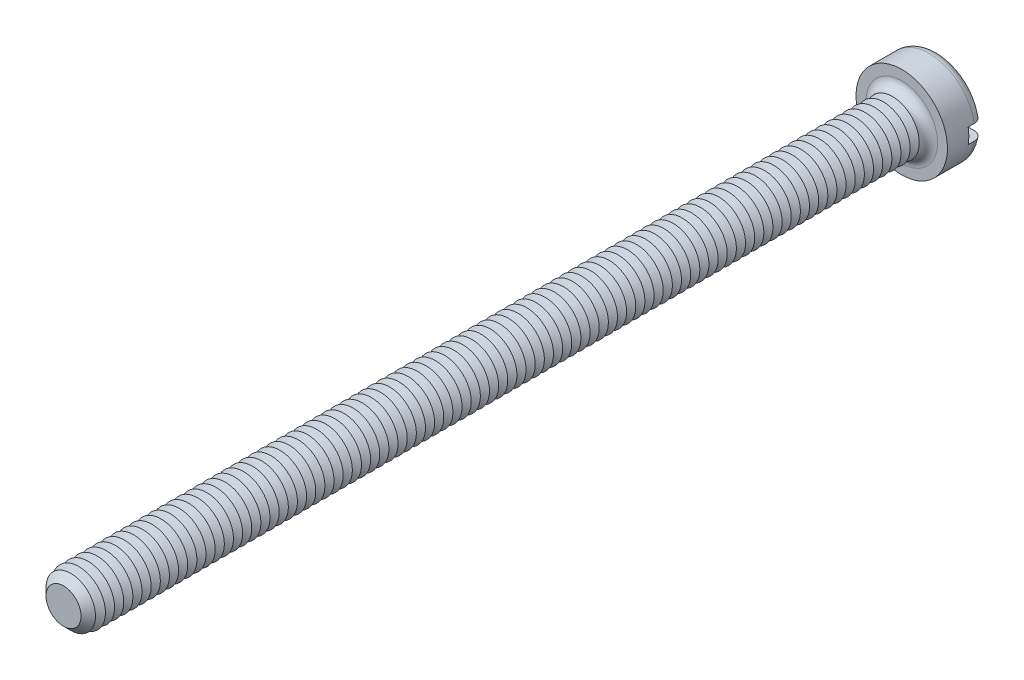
ISO-10303-21;
HEADER;
FILE_DESCRIPTION(('STEP AP214'),'2;1');
FILE_NAME('part.step','',(''),(''),'','','');
FILE_SCHEMA(('AUTOMOTIVE_DESIGN { 1 0 10303 214 1 1 1 1 }'));
ENDSEC;
DATA;
#1=APPLICATION_CONTEXT('core data for automotive mechanical design processes');
#2=APPLICATION_PROTOCOL_DEFINITION('international standard','automotive_design',2000,#1);
#3=PRODUCT_CONTEXT('',#1,'mechanical');
#4=PRODUCT('Part','Part','',(#3));
#5=PRODUCT_RELATED_PRODUCT_CATEGORY('part','',(#4));
#6=PRODUCT_DEFINITION_FORMATION('','',#4);
#7=PRODUCT_DEFINITION_CONTEXT('part definition',#1,'design');
#8=PRODUCT_DEFINITION('design','',#6,#7);
#9=PRODUCT_DEFINITION_SHAPE('','',#8);
#10=(LENGTH_UNIT() NAMED_UNIT(*) SI_UNIT(.MILLI.,.METRE.));
#11=(NAMED_UNIT(*) PLANE_ANGLE_UNIT() SI_UNIT($,.RADIAN.));
#12=(NAMED_UNIT(*) SI_UNIT($,.STERADIAN.) SOLID_ANGLE_UNIT());
#13=UNCERTAINTY_MEASURE_WITH_UNIT(LENGTH_MEASURE(1.E-05),#10,'distance_accuracy_value','');
#14=(GEOMETRIC_REPRESENTATION_CONTEXT(3) GLOBAL_UNCERTAINTY_ASSIGNED_CONTEXT((#13)) GLOBAL_UNIT_ASSIGNED_CONTEXT((#10,
#11,#12)) REPRESENTATION_CONTEXT('',''));
#15=CARTESIAN_POINT('',(0.,0.,0.));
#16=DIRECTION('',(0.,0.,1.));
#17=DIRECTION('',(1.,0.,0.));
#18=AXIS2_PLACEMENT_3D('',#15,#16,#17);
#19=CARTESIAN_POINT('',(0.,0.,-2.4));
#20=DIRECTION('',(0.,0.,1.));
#21=DIRECTION('',(1.,0.,0.));
#22=AXIS2_PLACEMENT_3D('',#19,#20,#21);
#23=PLANE('',#22);
#24=CARTESIAN_POINT('',(0.,0.,-2.4));
#25=DIRECTION('',(0.,0.,1.));
#26=DIRECTION('',(1.,0.,0.));
#27=AXIS2_PLACEMENT_3D('',#24,#25,#26);
#28=CIRCLE('',#27,2.4);
#29=CARTESIAN_POINT('',(-2.3473389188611,0.5,-2.4));
#30=VERTEX_POINT('',#29);
#31=CARTESIAN_POINT('',(2.3473389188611,0.5,-2.4));
#32=VERTEX_POINT('',#31);
#33=EDGE_CURVE('E116',#30,#32,#28,.F.);
#34=ORIENTED_EDGE('',*,*,#33,.T.);
#35=DIRECTION('',(1.,0.,0.));
#36=VECTOR('',#35,1.);
#37=CARTESIAN_POINT('',(-3.,0.5,-2.4));
#38=LINE('',#37,#36);
#39=EDGE_CURVE('E111',#30,#32,#38,.T.);
#40=ORIENTED_EDGE('',*,*,#39,.F.);
#41=EDGE_LOOP('',(#34,#40));
#42=FACE_BOUND('',#41,.T.);
#43=ADVANCED_FACE('F39',(#42),#23,.F.);
#44=CARTESIAN_POINT('',(0.,0.,-1.8));
#45=DIRECTION('',(0.,0.,1.));
#46=DIRECTION('',(1.,0.,0.));
#47=AXIS2_PLACEMENT_3D('',#44,#45,#46);
#48=TOROIDAL_SURFACE('',#47,2.4,0.6);
#49=CARTESIAN_POINT('',(-2.85761641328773,0.5,-2.13010535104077));
#50=CARTESIAN_POINT('',(-2.83871556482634,0.5,-2.1583605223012));
#51=CARTESIAN_POINT('',(-2.81738546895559,0.5,-2.18502342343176));
#52=CARTESIAN_POINT('',(-2.7705148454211,0.5,-2.23439244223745));
#53=CARTESIAN_POINT('',(-2.74496859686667,0.5,-2.25709309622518));
#54=CARTESIAN_POINT('',(-2.6904684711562,0.5,-2.29787524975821));
#55=CARTESIAN_POINT('',(-2.66151863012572,0.5,-2.3159621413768));
#56=CARTESIAN_POINT('',(-2.60103287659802,0.5,-2.34708203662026));
#57=CARTESIAN_POINT('',(-2.56949759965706,0.5,-2.36011627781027));
#58=CARTESIAN_POINT('',(-2.50430694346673,0.5,-2.38095952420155));
#59=CARTESIAN_POINT('',(-2.47062984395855,0.5,-2.38870056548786));
#60=CARTESIAN_POINT('',(-2.40245905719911,0.5,-2.39852415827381));
#61=CARTESIAN_POINT('',(-2.36796525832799,0.5,-2.40060593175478));
#62=CARTESIAN_POINT('',(-2.29850850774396,0.5,-2.39907718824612));
#63=CARTESIAN_POINT('',(-2.2635477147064,0.5,-2.3953679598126));
#64=CARTESIAN_POINT('',(-2.19472542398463,0.5,-2.38219781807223));
#65=CARTESIAN_POINT('',(-2.16086402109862,0.5,-2.37273641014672));
#66=CARTESIAN_POINT('',(-2.09483473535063,0.5,-2.3481926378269));
#67=CARTESIAN_POINT('',(-2.06268841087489,0.5,-2.3330521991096));
#68=CARTESIAN_POINT('',(-2.00140871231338,0.5,-2.29756210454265));
#69=CARTESIAN_POINT('',(-1.97227539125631,0.5,-2.27721235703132));
#70=CARTESIAN_POINT('',(-1.91805676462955,0.5,-2.23196210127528));
#71=CARTESIAN_POINT('',(-1.89294995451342,0.5,-2.20708739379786));
#72=CARTESIAN_POINT('',(-1.84740424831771,0.5,-2.1533758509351));
#73=CARTESIAN_POINT('',(-1.82696468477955,0.5,-2.12453958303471));
#74=CARTESIAN_POINT('',(-1.7919439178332,0.5,-2.06452274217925));
#75=CARTESIAN_POINT('',(-1.7772221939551,0.5,-2.03342424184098));
#76=CARTESIAN_POINT('',(-1.75343025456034,0.5,-1.96913621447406));
#77=CARTESIAN_POINT('',(-1.74435859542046,0.5,-1.93594722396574));
#78=CARTESIAN_POINT('',(-1.73243855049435,0.5,-1.86969199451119));
#79=CARTESIAN_POINT('',(-1.72938008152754,0.5,-1.83666346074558));
#80=CARTESIAN_POINT('',(-1.72896592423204,0.5,-1.77057287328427));
#81=CARTESIAN_POINT('',(-1.73160950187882,0.5,-1.73751082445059));
#82=CARTESIAN_POINT('',(-1.7423966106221,0.5,-1.67291835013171));
#83=CARTESIAN_POINT('',(-1.75043952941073,0.5,-1.64137102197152));
#84=CARTESIAN_POINT('',(-1.77163396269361,0.5,-1.58004446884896));
#85=CARTESIAN_POINT('',(-1.78478577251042,0.5,-1.55026534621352));
#86=CARTESIAN_POINT('',(-1.81598186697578,0.5,-1.49283859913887));
#87=CARTESIAN_POINT('',(-1.83409369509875,0.5,-1.46522772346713));
#88=CARTESIAN_POINT('',(-1.87455179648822,0.5,-1.41330756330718));
#89=CARTESIAN_POINT('',(-1.89689874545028,0.5,-1.38899880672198));
#90=CARTESIAN_POINT('',(-1.94600584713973,0.5,-1.34349499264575));
#91=CARTESIAN_POINT('',(-1.97289034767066,0.5,-1.32243411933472));
#92=CARTESIAN_POINT('',(-2.02972905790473,0.5,-1.28496935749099));
#93=CARTESIAN_POINT('',(-2.05968375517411,0.5,-1.26856621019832));
#94=CARTESIAN_POINT('',(-2.12276894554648,0.5,-1.24040709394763));
#95=CARTESIAN_POINT('',(-2.15596700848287,0.5,-1.22880230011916));
#96=CARTESIAN_POINT('',(-2.22383000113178,0.5,-1.21126311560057));
#97=CARTESIAN_POINT('',(-2.25849504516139,0.5,-1.20532916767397));
#98=CARTESIAN_POINT('',(-2.32870403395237,0.5,-1.1992792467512));
#99=CARTESIAN_POINT('',(-2.36425340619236,0.5,-1.19922586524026));
#100=CARTESIAN_POINT('',(-2.4348506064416,0.5,-1.2051326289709));
#101=CARTESIAN_POINT('',(-2.4698984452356,0.5,-1.21109264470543));
#102=CARTESIAN_POINT('',(-2.53821803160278,0.5,-1.22883658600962));
#103=CARTESIAN_POINT('',(-2.57150081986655,0.5,-1.24057794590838));
#104=CARTESIAN_POINT('',(-2.63557260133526,0.5,-1.2695744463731));
#105=CARTESIAN_POINT('',(-2.66636179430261,0.5,-1.28682914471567));
#106=CARTESIAN_POINT('',(-2.72402406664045,0.5,-1.32606063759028));
#107=CARTESIAN_POINT('',(-2.75095352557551,0.5,-1.34795455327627));
#108=CARTESIAN_POINT('',(-2.80067182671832,0.5,-1.39602603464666));
#109=CARTESIAN_POINT('',(-2.82346106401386,0.5,-1.42220319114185));
#110=CARTESIAN_POINT('',(-2.86383281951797,0.5,-1.47760238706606));
#111=CARTESIAN_POINT('',(-2.88149947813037,0.5,-1.50676312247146));
#112=CARTESIAN_POINT('',(-2.91160874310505,0.5,-1.56766595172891));
#113=CARTESIAN_POINT('',(-2.92405198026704,0.5,-1.59940773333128));
#114=CARTESIAN_POINT('',(-2.94319943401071,0.5,-1.66411282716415));
#115=CARTESIAN_POINT('',(-2.94997843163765,0.5,-1.69705402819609));
#116=CARTESIAN_POINT('',(-2.95787009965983,0.5,-1.7636173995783));
#117=CARTESIAN_POINT('',(-2.95898157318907,0.5,-1.79723971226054));
#118=CARTESIAN_POINT('',(-2.95551354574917,0.5,-1.86397776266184));
#119=CARTESIAN_POINT('',(-2.95096897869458,0.5,-1.89709534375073));
#120=CARTESIAN_POINT('',(-2.93638731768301,0.5,-1.96206785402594));
#121=CARTESIAN_POINT('',(-2.92635713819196,0.5,-1.99392431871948));
#122=CARTESIAN_POINT('',(-2.90618743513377,0.5,-2.04315073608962));
#123=CARTESIAN_POINT('',(-2.89769874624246,0.5,-2.06121519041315));
#124=CARTESIAN_POINT('',(-2.87895753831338,0.5,-2.096404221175));
#125=CARTESIAN_POINT('',(-2.86870503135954,0.5,-2.11352880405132));
#126=CARTESIAN_POINT('',(-2.85761641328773,0.5,-2.13010535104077));
#127=B_SPLINE_CURVE_WITH_KNOTS('',3,(#49,#50,#51,#52,#53,#54,#55,#56,#57,#58,#59,#60,#61,#62,
#63,#64,#65,#66,#67,#68,#69,#70,#71,#72,#73,#74,#75,#76,#77,#78,#79,#80,#81,#82,#83,#84,#85,#86,
#87,#88,#89,#90,#91,#92,#93,#94,#95,#96,#97,#98,#99,#100,#101,#102,#103,#104,#105,#106,#107,
#108,#109,#110,#111,#112,#113,#114,#115,#116,#117,#118,#119,#120,#121,#122,#123,#124,#125,#126),
.UNSPECIFIED.,.T.,.F.,(4,2,2,2,2,2,2,2,2,2,2,2,2,2,2,2,2,2,2,2,2,2,2,2,2,2,2,2,2,2,2,2,2,2,2,2,
2,2,4),(0.,0.101907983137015,0.203955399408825,0.305883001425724,0.407785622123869,
0.510973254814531,0.614175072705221,0.719155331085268,0.824144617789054,0.930238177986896,
1.03633360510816,1.14184204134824,1.24733537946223,1.35004136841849,1.45272110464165,
1.5517448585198,1.65075586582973,1.74797128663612,1.84519232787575,1.9438094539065,
2.0424423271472,2.14443321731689,2.24644032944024,2.35145317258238,2.45647421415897,
2.56261297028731,2.66874944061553,2.77411589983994,2.87947390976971,2.98308820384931,
3.08669260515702,3.18848388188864,3.29026286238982,3.39067588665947,3.49111011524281,
3.59092708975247,3.69061853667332,3.75040561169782,3.81019227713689),.UNSPECIFIED.);
#128=CARTESIAN_POINT('',(-2.95803989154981,0.5,-1.8));
#129=VERTEX_POINT('',#128);
#130=EDGE_CURVE('E905',#129,#30,#127,.T.);
#131=ORIENTED_EDGE('',*,*,#130,.F.);
#132=CARTESIAN_POINT('',(0.,0.,-1.8));
#133=DIRECTION('',(0.,0.,1.));
#134=DIRECTION('',(1.,0.,0.));
#135=AXIS2_PLACEMENT_3D('',#132,#133,#134);
#136=CIRCLE('',#135,3.);
#137=CARTESIAN_POINT('',(2.95803989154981,0.5,-1.8));
#138=VERTEX_POINT('',#137);
#139=EDGE_CURVE('E125',#138,#129,#136,.T.);
#140=ORIENTED_EDGE('',*,*,#139,.F.);
#141=CARTESIAN_POINT('',(1.78664846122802,0.5,-2.05158390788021));
#142=CARTESIAN_POINT('',(1.80142751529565,0.5,-2.08239430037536));
#143=CARTESIAN_POINT('',(1.81889355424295,0.5,-2.111949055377));
#144=CARTESIAN_POINT('',(1.8585933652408,0.5,-2.16770384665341));
#145=CARTESIAN_POINT('',(1.88083491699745,0.5,-2.19389829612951));
#146=CARTESIAN_POINT('',(1.92931942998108,0.5,-2.24217519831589));
#147=CARTESIAN_POINT('',(1.95555471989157,0.5,-2.26426535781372));
#148=CARTESIAN_POINT('',(2.01127789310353,0.5,-2.30384045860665));
#149=CARTESIAN_POINT('',(2.04076488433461,0.5,-2.32132665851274));
#150=CARTESIAN_POINT('',(2.10290022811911,0.5,-2.3516259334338));
#151=CARTESIAN_POINT('',(2.13560600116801,0.5,-2.3643213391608));
#152=CARTESIAN_POINT('',(2.20267136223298,0.5,-2.38412242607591));
#153=CARTESIAN_POINT('',(2.23703118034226,0.5,-2.3912273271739));
#154=CARTESIAN_POINT('',(2.30690186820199,0.5,-2.39969404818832));
#155=CARTESIAN_POINT('',(2.34242185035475,0.5,-2.40098100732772));
#156=CARTESIAN_POINT('',(2.41317063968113,0.5,-2.39753827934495));
#157=CARTESIAN_POINT('',(2.44839945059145,0.5,-2.39280866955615));
#158=CARTESIAN_POINT('',(2.51734146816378,0.5,-2.37746773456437));
#159=CARTESIAN_POINT('',(2.55106223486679,0.5,-2.3668904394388));
#160=CARTESIAN_POINT('',(2.61620389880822,0.5,-2.34013333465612));
#161=CARTESIAN_POINT('',(2.64762498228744,0.5,-2.32395397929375));
#162=CARTESIAN_POINT('',(2.70673284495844,0.5,-2.28672393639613));
#163=CARTESIAN_POINT('',(2.73447138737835,0.5,-2.26575544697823));
#164=CARTESIAN_POINT('',(2.78595339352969,0.5,-2.21938197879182));
#165=CARTESIAN_POINT('',(2.80969724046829,0.5,-2.19397742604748));
#166=CARTESIAN_POINT('',(2.85207235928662,0.5,-2.13993965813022));
#167=CARTESIAN_POINT('',(2.87078674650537,0.5,-2.11137160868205));
#168=CARTESIAN_POINT('',(2.90307455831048,0.5,-2.05146448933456));
#169=CARTESIAN_POINT('',(2.91664841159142,0.5,-2.02012565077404));
#170=CARTESIAN_POINT('',(2.93808283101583,0.5,-1.95603682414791));
#171=CARTESIAN_POINT('',(2.94602016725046,0.5,-1.92331249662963));
#172=CARTESIAN_POINT('',(2.95624273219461,0.5,-1.85699296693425));
#173=CARTESIAN_POINT('',(2.95852824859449,0.5,-1.82339780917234));
#174=CARTESIAN_POINT('',(2.95738171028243,0.5,-1.75655451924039));
#175=CARTESIAN_POINT('',(2.95399174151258,0.5,-1.72330565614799));
#176=CARTESIAN_POINT('',(2.94167749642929,0.5,-1.65784996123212));
#177=CARTESIAN_POINT('',(2.93275329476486,0.5,-1.62564311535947));
#178=CARTESIAN_POINT('',(2.90963870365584,0.5,-1.56317641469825));
#179=CARTESIAN_POINT('',(2.89544787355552,0.5,-1.53291672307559));
#180=CARTESIAN_POINT('',(2.86222325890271,0.5,-1.47518589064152));
#181=CARTESIAN_POINT('',(2.84318935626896,0.5,-1.44771481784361));
#182=CARTESIAN_POINT('',(2.80067851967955,0.5,-1.39611362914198));
#183=CARTESIAN_POINT('',(2.77716960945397,0.5,-1.37200986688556));
#184=CARTESIAN_POINT('',(2.72648704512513,0.5,-1.3280274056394));
#185=CARTESIAN_POINT('',(2.69931317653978,0.5,-1.3081489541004));
#186=CARTESIAN_POINT('',(2.64167967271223,0.5,-1.27288334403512));
#187=CARTESIAN_POINT('',(2.61118015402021,0.5,-1.25756138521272));
#188=CARTESIAN_POINT('',(2.54807315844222,0.5,-1.2321564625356));
#189=CARTESIAN_POINT('',(2.51546550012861,0.5,-1.22207395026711));
#190=CARTESIAN_POINT('',(2.44846246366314,0.5,-1.20724783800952));
#191=CARTESIAN_POINT('',(2.41404584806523,0.5,-1.2026002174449));
#192=CARTESIAN_POINT('',(2.34491756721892,0.5,-1.19904907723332));
#193=CARTESIAN_POINT('',(2.3102058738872,0.5,-1.20014611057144));
#194=CARTESIAN_POINT('',(2.24087507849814,0.5,-1.20808958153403));
#195=CARTESIAN_POINT('',(2.20626660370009,0.5,-1.21502895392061));
#196=CARTESIAN_POINT('',(2.13868705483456,0.5,-1.23457616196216));
#197=CARTESIAN_POINT('',(2.10571611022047,0.5,-1.24718444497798));
#198=CARTESIAN_POINT('',(2.04212010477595,0.5,-1.2778419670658));
#199=CARTESIAN_POINT('',(2.0115131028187,0.5,-1.29592871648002));
#200=CARTESIAN_POINT('',(1.95381117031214,0.5,-1.33703838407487));
#201=CARTESIAN_POINT('',(1.92671618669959,0.5,-1.36006122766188));
#202=CARTESIAN_POINT('',(1.8771749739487,0.5,-1.41014760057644));
#203=CARTESIAN_POINT('',(1.85467966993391,0.5,-1.43716252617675));
#204=CARTESIAN_POINT('',(1.8147167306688,0.5,-1.49468601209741));
#205=CARTESIAN_POINT('',(1.79724791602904,0.5,-1.52519375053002));
#206=CARTESIAN_POINT('',(1.76843420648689,0.5,-1.58782676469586));
#207=CARTESIAN_POINT('',(1.75691546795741,0.5,-1.61987202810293));
#208=CARTESIAN_POINT('',(1.73963101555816,0.5,-1.68548715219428));
#209=CARTESIAN_POINT('',(1.73386545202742,0.5,-1.71905705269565));
#210=CARTESIAN_POINT('',(1.72840927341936,0.5,-1.78556262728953));
#211=CARTESIAN_POINT('',(1.72852416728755,0.5,-1.8184825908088));
#212=CARTESIAN_POINT('',(1.73434422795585,0.5,-1.88379362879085));
#213=CARTESIAN_POINT('',(1.74004181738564,0.5,-1.91618535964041));
#214=CARTESIAN_POINT('',(1.75312909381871,0.5,-1.96568884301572));
#215=CARTESIAN_POINT('',(1.75869685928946,0.5,-1.98330302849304));
#216=CARTESIAN_POINT('',(1.77146455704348,0.5,-2.01792824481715));
#217=CARTESIAN_POINT('',(1.7786644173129,0.5,-2.03493930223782));
#218=CARTESIAN_POINT('',(1.78664846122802,0.5,-2.05158390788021));
#219=B_SPLINE_CURVE_WITH_KNOTS('',3,(#141,#142,#143,#144,#145,#146,#147,#148,#149,#150,#151,
#152,#153,#154,#155,#156,#157,#158,#159,#160,#161,#162,#163,#164,#165,#166,#167,#168,#169,#170,
#171,#172,#173,#174,#175,#176,#177,#178,#179,#180,#181,#182,#183,#184,#185,#186,#187,#188,#189,
#190,#191,#192,#193,#194,#195,#196,#197,#198,#199,#200,#201,#202,#203,#204,#205,#206,#207,#208,
#209,#210,#211,#212,#213,#214,#215,#216,#217,#218),.UNSPECIFIED.,.T.,.F.,(4,2,2,2,2,2,2,2,2,2,2,
2,2,2,2,2,2,2,2,2,2,2,2,2,2,2,2,2,2,2,2,2,2,2,2,2,2,2,4),(0.,0.10244464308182,0.205057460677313,
0.307475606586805,0.409865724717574,0.514628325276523,0.619405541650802,0.72552718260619,
0.831647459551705,0.937156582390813,1.04265715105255,1.1464674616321,1.25026780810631,
1.3522293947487,1.45418247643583,1.55471883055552,1.6552500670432,1.75503912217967,
1.8548268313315,1.95462289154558,2.05442138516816,2.15496174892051,2.25550799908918,
2.35743049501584,2.45936177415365,2.56306719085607,2.66678259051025,2.77217967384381,
2.87758507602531,2.98372914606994,3.08987161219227,3.19481457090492,3.29973288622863,
3.40138228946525,3.50303434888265,3.60132659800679,3.69948562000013,3.75483142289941,
3.8101747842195),.UNSPECIFIED.);
#220=EDGE_CURVE('E907',#32,#138,#219,.T.);
#221=ORIENTED_EDGE('',*,*,#220,.F.);
#222=ORIENTED_EDGE('',*,*,#33,.F.);
#223=EDGE_LOOP('',(#131,#140,#221,#222));
#224=FACE_BOUND('',#223,.T.);
#225=ADVANCED_FACE('F889',(#224),#48,.T.);
#226=CARTESIAN_POINT('',(0.,0.,-2.4));
#227=DIRECTION('',(0.,0.,1.));
#228=DIRECTION('',(1.,0.,0.));
#229=AXIS2_PLACEMENT_3D('',#226,#227,#228);
#230=CYLINDRICAL_SURFACE('',#229,3.);
#231=DIRECTION('',(0.,0.,1.));
#232=VECTOR('',#231,1.);
#233=CARTESIAN_POINT('',(2.95803989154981,0.5,-2.4));
#234=LINE('',#233,#232);
#235=CARTESIAN_POINT('',(2.95803989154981,0.5,-1.4));
#236=VERTEX_POINT('',#235);
#237=EDGE_CURVE('E922',#138,#236,#234,.T.);
#238=ORIENTED_EDGE('',*,*,#237,.F.);
#239=ORIENTED_EDGE('',*,*,#139,.T.);
#240=DIRECTION('',(0.,0.,1.));
#241=VECTOR('',#240,1.);
#242=CARTESIAN_POINT('',(-2.95803989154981,0.5,-2.4));
#243=LINE('',#242,#241);
#244=CARTESIAN_POINT('',(-2.95803989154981,0.5,-1.4));
#245=VERTEX_POINT('',#244);
#246=EDGE_CURVE('E63',#245,#129,#243,.F.);
#247=ORIENTED_EDGE('',*,*,#246,.F.);
#248=CARTESIAN_POINT('',(0.,0.,-1.4));
#249=DIRECTION('',(0.,0.,-1.));
#250=DIRECTION('',(-1.,0.,0.));
#251=AXIS2_PLACEMENT_3D('',#248,#249,#250);
#252=CIRCLE('',#251,3.);
#253=CARTESIAN_POINT('',(-2.95803989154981,-0.5,-1.4));
#254=VERTEX_POINT('',#253);
#255=EDGE_CURVE('E43',#245,#254,#252,.F.);
#256=ORIENTED_EDGE('',*,*,#255,.T.);
#257=DIRECTION('',(0.,0.,1.));
#258=VECTOR('',#257,1.);
#259=CARTESIAN_POINT('',(-2.95803989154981,-0.5,-2.4));
#260=LINE('',#259,#258);
#261=CARTESIAN_POINT('',(-2.9580398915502,-0.5,-1.79999999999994));
#262=VERTEX_POINT('',#261);
#263=EDGE_CURVE('E919',#262,#254,#260,.T.);
#264=ORIENTED_EDGE('',*,*,#263,.F.);
#265=CARTESIAN_POINT('',(2.95803989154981,-0.5,-1.8));
#266=VERTEX_POINT('',#265);
#267=EDGE_CURVE('E127',#262,#266,#136,.T.);
#268=ORIENTED_EDGE('',*,*,#267,.T.);
#269=DIRECTION('',(0.,0.,1.));
#270=VECTOR('',#269,1.);
#271=CARTESIAN_POINT('',(2.95803989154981,-0.5,-2.4));
#272=LINE('',#271,#270);
#273=CARTESIAN_POINT('',(2.95803989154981,-0.5,-1.4));
#274=VERTEX_POINT('',#273);
#275=EDGE_CURVE('E55',#274,#266,#272,.F.);
#276=ORIENTED_EDGE('',*,*,#275,.F.);
#277=EDGE_CURVE('E11',#274,#236,#252,.F.);
#278=ORIENTED_EDGE('',*,*,#277,.T.);
#279=EDGE_LOOP('',(#238,#239,#247,#256,#264,#268,#276,#278));
#280=FACE_BOUND('',#279,.T.);
#281=CARTESIAN_POINT('',(0.,0.,0.));
#282=DIRECTION('',(0.,0.,1.));
#283=DIRECTION('',(1.,0.,0.));
#284=AXIS2_PLACEMENT_3D('',#281,#282,#283);
#285=CIRCLE('',#284,3.);
#286=CARTESIAN_POINT('',(3.,0.,0.));
#287=VERTEX_POINT('',#286);
#288=EDGE_CURVE('E925',#287,#287,#285,.T.);
#289=ORIENTED_EDGE('',*,*,#288,.F.);
#290=EDGE_LOOP('',(#289));
#291=FACE_BOUND('',#290,.T.);
#292=ADVANCED_FACE('F885',(#280,#291),#230,.T.);
#293=CARTESIAN_POINT('',(2.3473389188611,-0.5,-2.4));
#294=VERTEX_POINT('',#293);
#295=CARTESIAN_POINT('',(-2.3473389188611,-0.5,-2.4));
#296=VERTEX_POINT('',#295);
#297=EDGE_CURVE('E109',#294,#296,#28,.F.);
#298=ORIENTED_EDGE('',*,*,#297,.T.);
#299=DIRECTION('',(-1.,0.,0.));
#300=VECTOR('',#299,1.);
#301=CARTESIAN_POINT('',(-3.,-0.5,-2.4));
#302=LINE('',#301,#300);
#303=EDGE_CURVE('E96',#294,#296,#302,.T.);
#304=ORIENTED_EDGE('',*,*,#303,.F.);
#305=EDGE_LOOP('',(#298,#304));
#306=FACE_BOUND('',#305,.T.);
#307=ADVANCED_FACE('F108',(#306),#23,.F.);
#308=CARTESIAN_POINT('',(0.,0.,0.));
#309=DIRECTION('',(0.,0.,1.));
#310=DIRECTION('',(1.,0.,0.));
#311=AXIS2_PLACEMENT_3D('',#308,#309,#310);
#312=PLANE('',#311);
#313=CARTESIAN_POINT('',(0.,0.,0.));
#314=DIRECTION('',(0.,0.,1.));
#315=DIRECTION('',(1.,0.,0.));
#316=AXIS2_PLACEMENT_3D('',#313,#314,#315);
#317=CIRCLE('',#316,2.35);
#318=CARTESIAN_POINT('',(2.35,0.,0.));
#319=VERTEX_POINT('',#318);
#320=EDGE_CURVE('E115',#319,#319,#317,.F.);
#321=ORIENTED_EDGE('',*,*,#320,.T.);
#322=EDGE_LOOP('',(#321));
#323=FACE_BOUND('',#322,.T.);
#324=ORIENTED_EDGE('',*,*,#288,.T.);
#325=EDGE_LOOP('',(#324));
#326=FACE_BOUND('',#325,.T.);
#327=ADVANCED_FACE('F884',(#323,#326),#312,.T.);
#328=CARTESIAN_POINT('',(-2.85761641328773,-0.5,-2.13010535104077));
#329=CARTESIAN_POINT('',(-2.87617085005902,-0.5,-2.10236255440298));
#330=CARTESIAN_POINT('',(-2.89241094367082,-0.5,-2.07304478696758));
#331=CARTESIAN_POINT('',(-2.91975805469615,-0.5,-2.01207835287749));
#332=CARTESIAN_POINT('',(-2.93085958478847,-0.5,-1.98042723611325));
#333=CARTESIAN_POINT('',(-2.94757590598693,-0.5,-1.91570997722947));
#334=CARTESIAN_POINT('',(-2.95319165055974,-0.5,-1.88264408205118));
#335=CARTESIAN_POINT('',(-2.95876526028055,-0.5,-1.81604673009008));
#336=CARTESIAN_POINT('',(-2.95872441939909,-0.5,-1.78251538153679));
#337=CARTESIAN_POINT('',(-2.95300126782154,-0.5,-1.71606888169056));
#338=CARTESIAN_POINT('',(-2.94734076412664,-0.5,-1.68315184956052));
#339=CARTESIAN_POINT('',(-2.93058183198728,-0.5,-1.61873244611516));
#340=CARTESIAN_POINT('',(-2.91948325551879,-0.5,-1.58723011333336));
#341=CARTESIAN_POINT('',(-2.89215903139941,-0.5,-1.52647404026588));
#342=CARTESIAN_POINT('',(-2.87592518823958,-0.5,-1.49722398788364));
#343=CARTESIAN_POINT('',(-2.83881787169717,-0.5,-1.44183365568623));
#344=CARTESIAN_POINT('',(-2.81794425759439,-0.5,-1.41569347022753));
#345=CARTESIAN_POINT('',(-2.77196258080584,-0.5,-1.36700890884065));
#346=CARTESIAN_POINT('',(-2.74681874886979,-0.5,-1.34449832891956));
#347=CARTESIAN_POINT('',(-2.69315595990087,-0.5,-1.30394571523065));
#348=CARTESIAN_POINT('',(-2.66463678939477,-0.5,-1.28590396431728));
#349=CARTESIAN_POINT('',(-2.6045885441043,-0.5,-1.25451133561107));
#350=CARTESIAN_POINT('',(-2.573021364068,-0.5,-1.24123336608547));
#351=CARTESIAN_POINT('',(-2.50813094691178,-0.5,-1.22006271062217));
#352=CARTESIAN_POINT('',(-2.47480755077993,-0.5,-1.21217051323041));
#353=CARTESIAN_POINT('',(-2.40672281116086,-0.5,-1.20185046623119));
#354=CARTESIAN_POINT('',(-2.37194646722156,-0.5,-1.19952155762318));
#355=CARTESIAN_POINT('',(-2.30248663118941,-0.5,-1.20064178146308));
#356=CARTESIAN_POINT('',(-2.26780314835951,-0.5,-1.20409147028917));
#357=CARTESIAN_POINT('',(-2.19896003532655,-0.5,-1.21674803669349));
#358=CARTESIAN_POINT('',(-2.16481620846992,-0.5,-1.22604100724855));
#359=CARTESIAN_POINT('',(-2.09855902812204,-0.5,-1.25020237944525));
#360=CARTESIAN_POINT('',(-2.0664458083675,-0.5,-1.2650711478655));
#361=CARTESIAN_POINT('',(-2.00504979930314,-0.5,-1.3000633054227));
#362=CARTESIAN_POINT('',(-1.97577870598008,-0.5,-1.32020724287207));
#363=CARTESIAN_POINT('',(-1.92109882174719,-0.5,-1.36519538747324));
#364=CARTESIAN_POINT('',(-1.89568984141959,-0.5,-1.39003936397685));
#365=CARTESIAN_POINT('',(-1.84992350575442,-0.5,-1.44333696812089));
#366=CARTESIAN_POINT('',(-1.82949305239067,-0.5,-1.47172774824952));
#367=CARTESIAN_POINT('',(-1.79388305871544,-0.5,-1.53163225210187));
#368=CARTESIAN_POINT('',(-1.77870235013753,-0.5,-1.56314527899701));
#369=CARTESIAN_POINT('',(-1.7545759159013,-0.5,-1.62726698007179));
#370=CARTESIAN_POINT('',(-1.74543784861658,-0.5,-1.65980327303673));
#371=CARTESIAN_POINT('',(-1.73294830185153,-0.5,-1.72596654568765));
#372=CARTESIAN_POINT('',(-1.72959555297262,-0.5,-1.7595932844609));
#373=CARTESIAN_POINT('',(-1.72881879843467,-0.5,-1.82588200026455));
#374=CARTESIAN_POINT('',(-1.73121660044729,-0.5,-1.85854202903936));
#375=CARTESIAN_POINT('',(-1.74148022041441,-0.5,-1.9229888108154));
#376=CARTESIAN_POINT('',(-1.74934586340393,-0.5,-1.95477559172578));
#377=CARTESIAN_POINT('',(-1.77023164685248,-0.5,-2.01650910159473));
#378=CARTESIAN_POINT('',(-1.78323812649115,-0.5,-2.04646046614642));
#379=CARTESIAN_POINT('',(-1.81396733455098,-0.5,-2.10383471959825));
#380=CARTESIAN_POINT('',(-1.83169061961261,-0.5,-2.13125730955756));
#381=CARTESIAN_POINT('',(-1.87183626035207,-0.5,-2.18359240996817));
#382=CARTESIAN_POINT('',(-1.89437158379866,-0.5,-2.20841820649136));
#383=CARTESIAN_POINT('',(-1.9431646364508,-0.5,-2.25409214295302));
#384=CARTESIAN_POINT('',(-1.96942301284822,-0.5,-2.27493958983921));
#385=CARTESIAN_POINT('',(-2.025898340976,-0.5,-2.31281042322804));
#386=CARTESIAN_POINT('',(-2.05622082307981,-0.5,-2.32967654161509));
#387=CARTESIAN_POINT('',(-2.11922391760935,-0.5,-2.35820255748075));
#388=CARTESIAN_POINT('',(-2.15190483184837,-0.5,-2.3698617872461));
#389=CARTESIAN_POINT('',(-2.21944675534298,-0.5,-2.38785911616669));
#390=CARTESIAN_POINT('',(-2.25433929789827,-0.5,-2.39407914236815));
#391=CARTESIAN_POINT('',(-2.32467357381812,-0.5,-2.40058243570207));
#392=CARTESIAN_POINT('',(-2.36011530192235,-0.5,-2.40086575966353));
#393=CARTESIAN_POINT('',(-2.43058129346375,-0.5,-2.39545061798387));
#394=CARTESIAN_POINT('',(-2.46560504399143,-0.5,-2.38974544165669));
#395=CARTESIAN_POINT('',(-2.53418188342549,-0.5,-2.37245602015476));
#396=CARTESIAN_POINT('',(-2.56773468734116,-0.5,-2.36087064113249));
#397=CARTESIAN_POINT('',(-2.63195003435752,-0.5,-2.33229154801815));
#398=CARTESIAN_POINT('',(-2.66264330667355,-0.5,-2.31536681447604));
#399=CARTESIAN_POINT('',(-2.72065333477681,-0.5,-2.2765252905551));
#400=CARTESIAN_POINT('',(-2.7479744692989,-0.5,-2.25461508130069));
#401=CARTESIAN_POINT('',(-2.78903570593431,-0.5,-2.21539504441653));
#402=CARTESIAN_POINT('',(-2.80405150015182,-0.5,-2.19939833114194));
#403=CARTESIAN_POINT('',(-2.83224965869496,-0.5,-2.16586257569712));
#404=CARTESIAN_POINT('',(-2.84543204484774,-0.5,-2.14832355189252));
#405=CARTESIAN_POINT('',(-2.85761641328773,-0.5,-2.13010535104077));
#406=B_SPLINE_CURVE_WITH_KNOTS('',3,(#328,#329,#330,#331,#332,#333,#334,#335,#336,#337,#338,
#339,#340,#341,#342,#343,#344,#345,#346,#347,#348,#349,#350,#351,#352,#353,#354,#355,#356,#357,
#358,#359,#360,#361,#362,#363,#364,#365,#366,#367,#368,#369,#370,#371,#372,#373,#374,#375,#376,
#377,#378,#379,#380,#381,#382,#383,#384,#385,#386,#387,#388,#389,#390,#391,#392,#393,#394,#395,
#396,#397,#398,#399,#400,#401,#402,#403,#404,#405),.UNSPECIFIED.,.T.,.F.,(4,2,2,2,2,2,2,2,2,2,2,
2,2,2,2,2,2,2,2,2,2,2,2,2,2,2,2,2,2,2,2,2,2,2,2,2,2,2,4),(0.,0.100047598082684,
0.200201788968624,0.300338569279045,0.400452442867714,0.500179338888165,0.599908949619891,
0.699798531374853,0.799691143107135,0.900465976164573,1.00124718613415,1.10351091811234,
1.20578392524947,1.30986270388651,1.41395150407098,1.51961105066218,1.62527754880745,
1.73136193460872,1.83744111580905,1.94185359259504,2.04624281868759,2.1471248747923,
2.24798479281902,2.34575994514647,2.44353196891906,2.541045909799,2.63857136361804,
2.73870431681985,2.83885469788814,2.94247024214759,3.0460990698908,3.15192527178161,
3.25775046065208,3.36369436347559,3.46965870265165,3.57430655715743,3.67881706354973,
3.74451732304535,3.81021680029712),.UNSPECIFIED.);
#407=EDGE_CURVE('E103',#296,#262,#406,.T.);
#408=ORIENTED_EDGE('',*,*,#407,.F.);
#409=ORIENTED_EDGE('',*,*,#297,.F.);
#410=CARTESIAN_POINT('',(1.78664846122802,-0.5,-2.05158390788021));
#411=CARTESIAN_POINT('',(1.77253256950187,-0.5,-2.02214917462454));
#412=CARTESIAN_POINT('',(1.76084795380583,-0.5,-1.99152692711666));
#413=CARTESIAN_POINT('',(1.74276267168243,-0.5,-1.92873811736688));
#414=CARTESIAN_POINT('',(1.73636622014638,-0.5,-1.89657034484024));
#415=CARTESIAN_POINT('',(1.72910271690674,-0.5,-1.83160458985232));
#416=CARTESIAN_POINT('',(1.72823699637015,-0.5,-1.79880645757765));
#417=CARTESIAN_POINT('',(1.73207277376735,-0.5,-1.73354460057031));
#418=CARTESIAN_POINT('',(1.7367732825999,-0.5,-1.70108081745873));
#419=CARTESIAN_POINT('',(1.75151033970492,-0.5,-1.63763571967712));
#420=CARTESIAN_POINT('',(1.76150868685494,-0.5,-1.60664550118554));
#421=CARTESIAN_POINT('',(1.78646773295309,-0.5,-1.54673433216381));
#422=CARTESIAN_POINT('',(1.80142897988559,-0.5,-1.51781361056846));
#423=CARTESIAN_POINT('',(1.8361687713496,-0.5,-1.46223275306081));
#424=CARTESIAN_POINT('',(1.85603637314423,-0.5,-1.43562834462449));
#425=CARTESIAN_POINT('',(1.89981598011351,-0.5,-1.38598822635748));
#426=CARTESIAN_POINT('',(1.92372865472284,-0.5,-1.3629531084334));
#427=CARTESIAN_POINT('',(1.97581791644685,-0.5,-1.32025912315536));
#428=CARTESIAN_POINT('',(2.00411431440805,-0.5,-1.30074638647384));
#429=CARTESIAN_POINT('',(2.06351340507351,-0.5,-1.26660223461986));
#430=CARTESIAN_POINT('',(2.09461651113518,-0.5,-1.2519715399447));
#431=CARTESIAN_POINT('',(2.15964055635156,-0.5,-1.22763649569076));
#432=CARTESIAN_POINT('',(2.19361437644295,-0.5,-1.21807321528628));
#433=CARTESIAN_POINT('',(2.26268197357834,-0.5,-1.20474094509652));
#434=CARTESIAN_POINT('',(2.29777581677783,-0.5,-1.20097229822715));
#435=CARTESIAN_POINT('',(2.36834397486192,-0.5,-1.19935270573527));
#436=CARTESIAN_POINT('',(2.40381924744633,-0.5,-1.20154258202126));
#437=CARTESIAN_POINT('',(2.47388621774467,-0.5,-1.211906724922));
#438=CARTESIAN_POINT('',(2.50847794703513,-0.5,-1.22008077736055));
#439=CARTESIAN_POINT('',(2.57542869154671,-0.5,-1.24211740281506));
#440=CARTESIAN_POINT('',(2.60780612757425,-0.5,-1.25592395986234));
#441=CARTESIAN_POINT('',(2.66972487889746,-0.5,-1.28886991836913));
#442=CARTESIAN_POINT('',(2.69926644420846,-0.5,-1.3080088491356));
#443=CARTESIAN_POINT('',(2.75412764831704,-0.5,-1.35072337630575));
#444=CARTESIAN_POINT('',(2.77951140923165,-0.5,-1.37421661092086));
#445=CARTESIAN_POINT('',(2.82588981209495,-0.5,-1.42519687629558));
#446=CARTESIAN_POINT('',(2.84688487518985,-0.5,-1.4526835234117));
#447=CARTESIAN_POINT('',(2.88351678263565,-0.5,-1.51036368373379));
#448=CARTESIAN_POINT('',(2.89923879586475,-0.5,-1.54050312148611));
#449=CARTESIAN_POINT('',(2.92532780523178,-0.5,-1.60301687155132));
#450=CARTESIAN_POINT('',(2.93569520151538,-0.5,-1.63539101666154));
#451=CARTESIAN_POINT('',(2.95066155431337,-0.5,-1.70102985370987));
#452=CARTESIAN_POINT('',(2.95532930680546,-0.5,-1.73427887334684));
#453=CARTESIAN_POINT('',(2.9589838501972,-0.5,-1.80108716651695));
#454=CARTESIAN_POINT('',(2.95797087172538,-0.5,-1.83464642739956));
#455=CARTESIAN_POINT('',(2.9503157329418,-0.5,-1.90093629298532));
#456=CARTESIAN_POINT('',(2.9437032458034,-0.5,-1.93367033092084));
#457=CARTESIAN_POINT('',(2.92508830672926,-0.5,-1.99756717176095));
#458=CARTESIAN_POINT('',(2.91308586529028,-0.5,-2.02872997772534));
#459=CARTESIAN_POINT('',(2.88401713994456,-0.5,-2.08868263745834));
#460=CARTESIAN_POINT('',(2.86693946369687,-0.5,-2.11746696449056));
#461=CARTESIAN_POINT('',(2.82823635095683,-0.5,-2.17179415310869));
#462=CARTESIAN_POINT('',(2.80661076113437,-0.5,-2.19733690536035));
#463=CARTESIAN_POINT('',(2.75921750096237,-0.5,-2.24472182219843));
#464=CARTESIAN_POINT('',(2.73341278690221,-0.5,-2.26652692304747));
#465=CARTESIAN_POINT('',(2.67855512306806,-0.5,-2.30557116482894));
#466=CARTESIAN_POINT('',(2.64950194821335,-0.5,-2.32280998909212));
#467=CARTESIAN_POINT('',(2.58850670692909,-0.5,-2.35251615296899));
#468=CARTESIAN_POINT('',(2.55652763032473,-0.5,-2.36490748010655));
#469=CARTESIAN_POINT('',(2.4909651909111,-0.5,-2.38424946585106));
#470=CARTESIAN_POINT('',(2.45738167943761,-0.5,-2.39119961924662));
#471=CARTESIAN_POINT('',(2.38892891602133,-0.5,-2.39958830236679));
#472=CARTESIAN_POINT('',(2.35404742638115,-0.5,-2.40092701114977));
#473=CARTESIAN_POINT('',(2.28454389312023,-0.5,-2.39781917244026));
#474=CARTESIAN_POINT('',(2.24992186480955,-0.5,-2.39337228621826));
#475=CARTESIAN_POINT('',(2.18139250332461,-0.5,-2.37872879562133));
#476=CARTESIAN_POINT('',(2.14750264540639,-0.5,-2.36845030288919));
#477=CARTESIAN_POINT('',(2.08190943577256,-0.5,-2.34236291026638));
#478=CARTESIAN_POINT('',(2.05020675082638,-0.5,-2.32655233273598));
#479=CARTESIAN_POINT('',(1.98982495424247,-0.5,-2.28976285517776));
#480=CARTESIAN_POINT('',(1.96115527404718,-0.5,-2.26876847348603));
#481=CARTESIAN_POINT('',(1.90785147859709,-0.5,-2.22220002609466));
#482=CARTESIAN_POINT('',(1.88321231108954,-0.5,-2.19663177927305));
#483=CARTESIAN_POINT('',(1.84638483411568,-0.5,-2.15106161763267));
#484=CARTESIAN_POINT('',(1.8328227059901,-0.5,-2.13215328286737));
#485=CARTESIAN_POINT('',(1.80797918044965,-0.5,-2.09289185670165));
#486=CARTESIAN_POINT('',(1.79669771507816,-0.5,-2.07253880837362));
#487=CARTESIAN_POINT('',(1.78664846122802,-0.5,-2.05158390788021));
#488=B_SPLINE_CURVE_WITH_KNOTS('',3,(#410,#411,#412,#413,#414,#415,#416,#417,#418,#419,#420,
#421,#422,#423,#424,#425,#426,#427,#428,#429,#430,#431,#432,#433,#434,#435,#436,#437,#438,#439,
#440,#441,#442,#443,#444,#445,#446,#447,#448,#449,#450,#451,#452,#453,#454,#455,#456,#457,#458,
#459,#460,#461,#462,#463,#464,#465,#466,#467,#468,#469,#470,#471,#472,#473,#474,#475,#476,#477,
#478,#479,#480,#481,#482,#483,#484,#485,#486,#487),.UNSPECIFIED.,.T.,.F.,(4,2,2,2,2,2,2,2,2,2,2,
2,2,2,2,2,2,2,2,2,2,2,2,2,2,2,2,2,2,2,2,2,2,2,2,2,2,2,4),(0.,0.0978512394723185,0.19578039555,
0.293733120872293,0.391668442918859,0.488907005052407,0.58615630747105,0.685320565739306,
0.784501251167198,0.887148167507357,0.989810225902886,1.09519726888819,1.20059054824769,
1.30670769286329,1.41282103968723,1.51790384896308,1.62297738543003,1.72623563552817,
1.82948397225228,1.93097382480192,2.03245609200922,2.13270093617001,2.23294171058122,
2.33265458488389,2.43236726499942,2.53230548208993,2.63224706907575,2.73312861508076,
2.83401715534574,2.93642973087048,3.03885181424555,3.14308833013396,3.24733094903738,
3.35307493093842,3.45885100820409,3.56494689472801,3.67090875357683,3.74057217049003,
3.81023351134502),.UNSPECIFIED.);
#489=EDGE_CURVE('E92',#266,#294,#488,.T.);
#490=ORIENTED_EDGE('',*,*,#489,.F.);
#491=ORIENTED_EDGE('',*,*,#267,.F.);
#492=EDGE_LOOP('',(#408,#409,#490,#491));
#493=FACE_BOUND('',#492,.T.);
#494=ADVANCED_FACE('F113',(#493),#48,.T.);
#495=CARTESIAN_POINT('',(0.,0.,0.600000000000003));
#496=DIRECTION('',(0.,0.,1.));
#497=DIRECTION('',(1.,0.,0.));
#498=AXIS2_PLACEMENT_3D('',#495,#496,#497);
#499=TOROIDAL_SURFACE('',#498,2.35,0.6);
#500=ORIENTED_EDGE('',*,*,#320,.F.);
#501=EDGE_LOOP('',(#500));
#502=FACE_BOUND('',#501,.T.);
#503=CARTESIAN_POINT('',(0.,0.,0.600000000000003));
#504=DIRECTION('',(0.,0.,-1.));
#505=DIRECTION('',(-1.,0.,0.));
#506=AXIS2_PLACEMENT_3D('',#503,#504,#505);
#507=CIRCLE('',#506,1.75);
#508=CARTESIAN_POINT('',(-1.75,0.,0.600000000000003));
#509=VERTEX_POINT('',#508);
#510=EDGE_CURVE('E931',#509,#509,#507,.T.);
#511=ORIENTED_EDGE('',*,*,#510,.T.);
#512=EDGE_LOOP('',(#511));
#513=FACE_BOUND('',#512,.T.);
#514=ADVANCED_FACE('F877',(#502,#513),#499,.F.);
#515=CARTESIAN_POINT('',(0.,0.,0.900000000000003));
#516=DIRECTION('',(0.,0.,-1.));
#517=DIRECTION('',(-1.,0.,0.));
#518=AXIS2_PLACEMENT_3D('',#515,#516,#517);
#519=CONICAL_SURFACE('',#518,1.23038475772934,1.0471975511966);
#520=ORIENTED_EDGE('',*,*,#510,.F.);
#521=EDGE_LOOP('',(#520));
#522=FACE_BOUND('',#521,.T.);
#523=CARTESIAN_POINT('',(0.,0.,0.900000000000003));
#524=DIRECTION('',(0.,0.,-1.));
#525=DIRECTION('',(-1.,0.,0.));
#526=AXIS2_PLACEMENT_3D('',#523,#524,#525);
#527=CIRCLE('',#526,1.23038475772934);
#528=CARTESIAN_POINT('',(-1.23038475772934,0.,0.900000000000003));
#529=VERTEX_POINT('',#528);
#530=EDGE_CURVE('E938',#529,#529,#527,.T.);
#531=ORIENTED_EDGE('',*,*,#530,.T.);
#532=EDGE_LOOP('',(#531));
#533=FACE_BOUND('',#532,.T.);
#534=ADVANCED_FACE('F873',(#522,#533),#519,.T.);
#535=CARTESIAN_POINT('',(0.,0.,1.2));
#536=DIRECTION('',(0.,0.,1.));
#537=DIRECTION('',(1.,0.,0.));
#538=AXIS2_PLACEMENT_3D('',#535,#536,#537);
#539=CONICAL_SURFACE('',#538,1.75,1.0471975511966);
#540=ORIENTED_EDGE('',*,*,#530,.F.);
#541=EDGE_LOOP('',(#540));
#542=FACE_BOUND('',#541,.T.);
#543=CARTESIAN_POINT('',(0.,0.,1.2));
#544=DIRECTION('',(0.,0.,-1.));
#545=DIRECTION('',(-1.,0.,0.));
#546=AXIS2_PLACEMENT_3D('',#543,#544,#545);
#547=CIRCLE('',#546,1.75);
#548=CARTESIAN_POINT('',(-1.75,0.,1.2));
#549=VERTEX_POINT('',#548);
#550=EDGE_CURVE('E944',#549,#549,#547,.T.);
#551=ORIENTED_EDGE('',*,*,#550,.T.);
#552=EDGE_LOOP('',(#551));
#553=FACE_BOUND('',#552,.T.);
#554=ADVANCED_FACE('F869',(#542,#553),#539,.T.);
#555=CARTESIAN_POINT('',(0.,0.,1.5));
#556=DIRECTION('',(0.,0.,-1.));
#557=DIRECTION('',(-1.,0.,0.));
#558=AXIS2_PLACEMENT_3D('',#555,#556,#557);
#559=CONICAL_SURFACE('',#558,1.23038475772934,1.0471975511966);
#560=ORIENTED_EDGE('',*,*,#550,.F.);
#561=EDGE_LOOP('',(#560));
#562=FACE_BOUND('',#561,.T.);
#563=CARTESIAN_POINT('',(0.,0.,1.5));
#564=DIRECTION('',(0.,0.,-1.));
#565=DIRECTION('',(-1.,0.,0.));
#566=AXIS2_PLACEMENT_3D('',#563,#564,#565);
#567=CIRCLE('',#566,1.23038475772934);
#568=CARTESIAN_POINT('',(-1.23038475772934,0.,1.5));
#569=VERTEX_POINT('',#568);
#570=EDGE_CURVE('E948',#569,#569,#567,.T.);
#571=ORIENTED_EDGE('',*,*,#570,.T.);
#572=EDGE_LOOP('',(#571));
#573=FACE_BOUND('',#572,.T.);
#574=ADVANCED_FACE('F865',(#562,#573),#559,.T.);
#575=CARTESIAN_POINT('',(0.,0.,1.8));
#576=DIRECTION('',(0.,0.,1.));
#577=DIRECTION('',(1.,0.,0.));
#578=AXIS2_PLACEMENT_3D('',#575,#576,#577);
#579=CONICAL_SURFACE('',#578,1.75,1.0471975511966);
#580=ORIENTED_EDGE('',*,*,#570,.F.);
#581=EDGE_LOOP('',(#580));
#582=FACE_BOUND('',#581,.T.);
#583=CARTESIAN_POINT('',(0.,0.,1.8));
#584=DIRECTION('',(0.,0.,-1.));
#585=DIRECTION('',(-1.,0.,0.));
#586=AXIS2_PLACEMENT_3D('',#583,#584,#585);
#587=CIRCLE('',#586,1.75);
#588=CARTESIAN_POINT('',(-1.75,0.,1.8));
#589=VERTEX_POINT('',#588);
#590=EDGE_CURVE('E952',#589,#589,#587,.T.);
#591=ORIENTED_EDGE('',*,*,#590,.T.);
#592=EDGE_LOOP('',(#591));
#593=FACE_BOUND('',#592,.T.);
#594=ADVANCED_FACE('F861',(#582,#593),#579,.T.);
#595=CARTESIAN_POINT('',(0.,0.,2.1));
#596=DIRECTION('',(0.,0.,-1.));
#597=DIRECTION('',(-1.,0.,0.));
#598=AXIS2_PLACEMENT_3D('',#595,#596,#597);
#599=CONICAL_SURFACE('',#598,1.23038475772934,1.0471975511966);
#600=ORIENTED_EDGE('',*,*,#590,.F.);
#601=EDGE_LOOP('',(#600));
#602=FACE_BOUND('',#601,.T.);
#603=CARTESIAN_POINT('',(0.,0.,2.1));
#604=DIRECTION('',(0.,0.,-1.));
#605=DIRECTION('',(-1.,0.,0.));
#606=AXIS2_PLACEMENT_3D('',#603,#604,#605);
#607=CIRCLE('',#606,1.23038475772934);
#608=CARTESIAN_POINT('',(-1.23038475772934,0.,2.1));
#609=VERTEX_POINT('',#608);
#610=EDGE_CURVE('E956',#609,#609,#607,.T.);
#611=ORIENTED_EDGE('',*,*,#610,.T.);
#612=EDGE_LOOP('',(#611));
#613=FACE_BOUND('',#612,.T.);
#614=ADVANCED_FACE('F857',(#602,#613),#599,.T.);
#615=CARTESIAN_POINT('',(0.,0.,2.4));
#616=DIRECTION('',(0.,0.,1.));
#617=DIRECTION('',(1.,0.,0.));
#618=AXIS2_PLACEMENT_3D('',#615,#616,#617);
#619=CONICAL_SURFACE('',#618,1.75,1.0471975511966);
#620=ORIENTED_EDGE('',*,*,#610,.F.);
#621=EDGE_LOOP('',(#620));
#622=FACE_BOUND('',#621,.T.);
#623=CARTESIAN_POINT('',(0.,0.,2.4));
#624=DIRECTION('',(0.,0.,-1.));
#625=DIRECTION('',(-1.,0.,0.));
#626=AXIS2_PLACEMENT_3D('',#623,#624,#625);
#627=CIRCLE('',#626,1.75);
#628=CARTESIAN_POINT('',(-1.75,0.,2.4));
#629=VERTEX_POINT('',#628);
#630=EDGE_CURVE('E960',#629,#629,#627,.T.);
#631=ORIENTED_EDGE('',*,*,#630,.T.);
#632=EDGE_LOOP('',(#631));
#633=FACE_BOUND('',#632,.T.);
#634=ADVANCED_FACE('F853',(#622,#633),#619,.T.);
#635=CARTESIAN_POINT('',(0.,0.,2.7));
#636=DIRECTION('',(0.,0.,-1.));
#637=DIRECTION('',(-1.,0.,0.));
#638=AXIS2_PLACEMENT_3D('',#635,#636,#637);
#639=CONICAL_SURFACE('',#638,1.23038475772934,1.0471975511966);
#640=ORIENTED_EDGE('',*,*,#630,.F.);
#641=EDGE_LOOP('',(#640));
#642=FACE_BOUND('',#641,.T.);
#643=CARTESIAN_POINT('',(0.,0.,2.7));
#644=DIRECTION('',(0.,0.,-1.));
#645=DIRECTION('',(-1.,0.,0.));
#646=AXIS2_PLACEMENT_3D('',#643,#644,#645);
#647=CIRCLE('',#646,1.23038475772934);
#648=CARTESIAN_POINT('',(-1.23038475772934,0.,2.7));
#649=VERTEX_POINT('',#648);
#650=EDGE_CURVE('E964',#649,#649,#647,.T.);
#651=ORIENTED_EDGE('',*,*,#650,.T.);
#652=EDGE_LOOP('',(#651));
#653=FACE_BOUND('',#652,.T.);
#654=ADVANCED_FACE('F849',(#642,#653),#639,.T.);
#655=CARTESIAN_POINT('',(0.,0.,3.));
#656=DIRECTION('',(0.,0.,1.));
#657=DIRECTION('',(1.,0.,0.));
#658=AXIS2_PLACEMENT_3D('',#655,#656,#657);
#659=CONICAL_SURFACE('',#658,1.75,1.0471975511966);
#660=ORIENTED_EDGE('',*,*,#650,.F.);
#661=EDGE_LOOP('',(#660));
#662=FACE_BOUND('',#661,.T.);
#663=CARTESIAN_POINT('',(0.,0.,3.));
#664=DIRECTION('',(0.,0.,-1.));
#665=DIRECTION('',(-1.,0.,0.));
#666=AXIS2_PLACEMENT_3D('',#663,#664,#665);
#667=CIRCLE('',#666,1.75);
#668=CARTESIAN_POINT('',(-1.75,0.,3.));
#669=VERTEX_POINT('',#668);
#670=EDGE_CURVE('E967',#669,#669,#667,.T.);
#671=ORIENTED_EDGE('',*,*,#670,.T.);
#672=EDGE_LOOP('',(#671));
#673=FACE_BOUND('',#672,.T.);
#674=ADVANCED_FACE('F845',(#662,#673),#659,.T.);
#675=CARTESIAN_POINT('',(0.,0.,3.3));
#676=DIRECTION('',(0.,0.,-1.));
#677=DIRECTION('',(-1.,0.,0.));
#678=AXIS2_PLACEMENT_3D('',#675,#676,#677);
#679=CONICAL_SURFACE('',#678,1.23038475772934,1.0471975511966);
#680=ORIENTED_EDGE('',*,*,#670,.F.);
#681=EDGE_LOOP('',(#680));
#682=FACE_BOUND('',#681,.T.);
#683=CARTESIAN_POINT('',(0.,0.,3.3));
#684=DIRECTION('',(0.,0.,-1.));
#685=DIRECTION('',(-1.,0.,0.));
#686=AXIS2_PLACEMENT_3D('',#683,#684,#685);
#687=CIRCLE('',#686,1.23038475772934);
#688=CARTESIAN_POINT('',(-1.23038475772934,0.,3.3));
#689=VERTEX_POINT('',#688);
#690=EDGE_CURVE('E971',#689,#689,#687,.T.);
#691=ORIENTED_EDGE('',*,*,#690,.T.);
#692=EDGE_LOOP('',(#691));
#693=FACE_BOUND('',#692,.T.);
#694=ADVANCED_FACE('F841',(#682,#693),#679,.T.);
#695=CARTESIAN_POINT('',(0.,0.,3.6));
#696=DIRECTION('',(0.,0.,1.));
#697=DIRECTION('',(1.,0.,0.));
#698=AXIS2_PLACEMENT_3D('',#695,#696,#697);
#699=CONICAL_SURFACE('',#698,1.75,1.0471975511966);
#700=ORIENTED_EDGE('',*,*,#690,.F.);
#701=EDGE_LOOP('',(#700));
#702=FACE_BOUND('',#701,.T.);
#703=CARTESIAN_POINT('',(0.,0.,3.6));
#704=DIRECTION('',(0.,0.,-1.));
#705=DIRECTION('',(-1.,0.,0.));
#706=AXIS2_PLACEMENT_3D('',#703,#704,#705);
#707=CIRCLE('',#706,1.75);
#708=CARTESIAN_POINT('',(-1.75,0.,3.6));
#709=VERTEX_POINT('',#708);
#710=EDGE_CURVE('E975',#709,#709,#707,.T.);
#711=ORIENTED_EDGE('',*,*,#710,.T.);
#712=EDGE_LOOP('',(#711));
#713=FACE_BOUND('',#712,.T.);
#714=ADVANCED_FACE('F837',(#702,#713),#699,.T.);
#715=CARTESIAN_POINT('',(0.,0.,3.9));
#716=DIRECTION('',(0.,0.,-1.));
#717=DIRECTION('',(-1.,0.,0.));
#718=AXIS2_PLACEMENT_3D('',#715,#716,#717);
#719=CONICAL_SURFACE('',#718,1.23038475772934,1.0471975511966);
#720=ORIENTED_EDGE('',*,*,#710,.F.);
#721=EDGE_LOOP('',(#720));
#722=FACE_BOUND('',#721,.T.);
#723=CARTESIAN_POINT('',(0.,0.,3.9));
#724=DIRECTION('',(0.,0.,-1.));
#725=DIRECTION('',(-1.,0.,0.));
#726=AXIS2_PLACEMENT_3D('',#723,#724,#725);
#727=CIRCLE('',#726,1.23038475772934);
#728=CARTESIAN_POINT('',(-1.23038475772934,0.,3.9));
#729=VERTEX_POINT('',#728);
#730=EDGE_CURVE('E979',#729,#729,#727,.T.);
#731=ORIENTED_EDGE('',*,*,#730,.T.);
#732=EDGE_LOOP('',(#731));
#733=FACE_BOUND('',#732,.T.);
#734=ADVANCED_FACE('F833',(#722,#733),#719,.T.);
#735=CARTESIAN_POINT('',(0.,0.,4.2));
#736=DIRECTION('',(0.,0.,1.));
#737=DIRECTION('',(1.,0.,0.));
#738=AXIS2_PLACEMENT_3D('',#735,#736,#737);
#739=CONICAL_SURFACE('',#738,1.75,1.0471975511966);
#740=ORIENTED_EDGE('',*,*,#730,.F.);
#741=EDGE_LOOP('',(#740));
#742=FACE_BOUND('',#741,.T.);
#743=CARTESIAN_POINT('',(0.,0.,4.2));
#744=DIRECTION('',(0.,0.,-1.));
#745=DIRECTION('',(-1.,0.,0.));
#746=AXIS2_PLACEMENT_3D('',#743,#744,#745);
#747=CIRCLE('',#746,1.75);
#748=CARTESIAN_POINT('',(-1.75,0.,4.2));
#749=VERTEX_POINT('',#748);
#750=EDGE_CURVE('E983',#749,#749,#747,.T.);
#751=ORIENTED_EDGE('',*,*,#750,.T.);
#752=EDGE_LOOP('',(#751));
#753=FACE_BOUND('',#752,.T.);
#754=ADVANCED_FACE('F829',(#742,#753),#739,.T.);
#755=CARTESIAN_POINT('',(0.,0.,4.5));
#756=DIRECTION('',(0.,0.,-1.));
#757=DIRECTION('',(-1.,0.,0.));
#758=AXIS2_PLACEMENT_3D('',#755,#756,#757);
#759=CONICAL_SURFACE('',#758,1.23038475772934,1.0471975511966);
#760=ORIENTED_EDGE('',*,*,#750,.F.);
#761=EDGE_LOOP('',(#760));
#762=FACE_BOUND('',#761,.T.);
#763=CARTESIAN_POINT('',(0.,0.,4.5));
#764=DIRECTION('',(0.,0.,-1.));
#765=DIRECTION('',(-1.,0.,0.));
#766=AXIS2_PLACEMENT_3D('',#763,#764,#765);
#767=CIRCLE('',#766,1.23038475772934);
#768=CARTESIAN_POINT('',(-1.23038475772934,0.,4.5));
#769=VERTEX_POINT('',#768);
#770=EDGE_CURVE('E987',#769,#769,#767,.T.);
#771=ORIENTED_EDGE('',*,*,#770,.T.);
#772=EDGE_LOOP('',(#771));
#773=FACE_BOUND('',#772,.T.);
#774=ADVANCED_FACE('F825',(#762,#773),#759,.T.);
#775=CARTESIAN_POINT('',(0.,0.,4.8));
#776=DIRECTION('',(0.,0.,1.));
#777=DIRECTION('',(1.,0.,0.));
#778=AXIS2_PLACEMENT_3D('',#775,#776,#777);
#779=CONICAL_SURFACE('',#778,1.75,1.0471975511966);
#780=ORIENTED_EDGE('',*,*,#770,.F.);
#781=EDGE_LOOP('',(#780));
#782=FACE_BOUND('',#781,.T.);
#783=CARTESIAN_POINT('',(0.,0.,4.8));
#784=DIRECTION('',(0.,0.,-1.));
#785=DIRECTION('',(-1.,0.,0.));
#786=AXIS2_PLACEMENT_3D('',#783,#784,#785);
#787=CIRCLE('',#786,1.75);
#788=CARTESIAN_POINT('',(-1.75,0.,4.8));
#789=VERTEX_POINT('',#788);
#790=EDGE_CURVE('E991',#789,#789,#787,.T.);
#791=ORIENTED_EDGE('',*,*,#790,.T.);
#792=EDGE_LOOP('',(#791));
#793=FACE_BOUND('',#792,.T.);
#794=ADVANCED_FACE('F821',(#782,#793),#779,.T.);
#795=CARTESIAN_POINT('',(0.,0.,5.1));
#796=DIRECTION('',(0.,0.,-1.));
#797=DIRECTION('',(-1.,0.,0.));
#798=AXIS2_PLACEMENT_3D('',#795,#796,#797);
#799=CONICAL_SURFACE('',#798,1.23038475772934,1.0471975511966);
#800=ORIENTED_EDGE('',*,*,#790,.F.);
#801=EDGE_LOOP('',(#800));
#802=FACE_BOUND('',#801,.T.);
#803=CARTESIAN_POINT('',(0.,0.,5.1));
#804=DIRECTION('',(0.,0.,-1.));
#805=DIRECTION('',(-1.,0.,0.));
#806=AXIS2_PLACEMENT_3D('',#803,#804,#805);
#807=CIRCLE('',#806,1.23038475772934);
#808=CARTESIAN_POINT('',(-1.23038475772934,0.,5.1));
#809=VERTEX_POINT('',#808);
#810=EDGE_CURVE('E995',#809,#809,#807,.T.);
#811=ORIENTED_EDGE('',*,*,#810,.T.);
#812=EDGE_LOOP('',(#811));
#813=FACE_BOUND('',#812,.T.);
#814=ADVANCED_FACE('F817',(#802,#813),#799,.T.);
#815=CARTESIAN_POINT('',(0.,0.,5.4));
#816=DIRECTION('',(0.,0.,1.));
#817=DIRECTION('',(1.,0.,0.));
#818=AXIS2_PLACEMENT_3D('',#815,#816,#817);
#819=CONICAL_SURFACE('',#818,1.75,1.0471975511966);
#820=ORIENTED_EDGE('',*,*,#810,.F.);
#821=EDGE_LOOP('',(#820));
#822=FACE_BOUND('',#821,.T.);
#823=CARTESIAN_POINT('',(0.,0.,5.4));
#824=DIRECTION('',(0.,0.,-1.));
#825=DIRECTION('',(-1.,0.,0.));
#826=AXIS2_PLACEMENT_3D('',#823,#824,#825);
#827=CIRCLE('',#826,1.75);
#828=CARTESIAN_POINT('',(-1.75,0.,5.4));
#829=VERTEX_POINT('',#828);
#830=EDGE_CURVE('E999',#829,#829,#827,.T.);
#831=ORIENTED_EDGE('',*,*,#830,.T.);
#832=EDGE_LOOP('',(#831));
#833=FACE_BOUND('',#832,.T.);
#834=ADVANCED_FACE('F813',(#822,#833),#819,.T.);
#835=CARTESIAN_POINT('',(0.,0.,5.7));
#836=DIRECTION('',(0.,0.,-1.));
#837=DIRECTION('',(-1.,0.,0.));
#838=AXIS2_PLACEMENT_3D('',#835,#836,#837);
#839=CONICAL_SURFACE('',#838,1.23038475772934,1.0471975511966);
#840=ORIENTED_EDGE('',*,*,#830,.F.);
#841=EDGE_LOOP('',(#840));
#842=FACE_BOUND('',#841,.T.);
#843=CARTESIAN_POINT('',(0.,0.,5.7));
#844=DIRECTION('',(0.,0.,-1.));
#845=DIRECTION('',(-1.,0.,0.));
#846=AXIS2_PLACEMENT_3D('',#843,#844,#845);
#847=CIRCLE('',#846,1.23038475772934);
#848=CARTESIAN_POINT('',(-1.23038475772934,0.,5.7));
#849=VERTEX_POINT('',#848);
#850=EDGE_CURVE('E1002',#849,#849,#847,.T.);
#851=ORIENTED_EDGE('',*,*,#850,.T.);
#852=EDGE_LOOP('',(#851));
#853=FACE_BOUND('',#852,.T.);
#854=ADVANCED_FACE('F809',(#842,#853),#839,.T.);
#855=CARTESIAN_POINT('',(0.,0.,6.));
#856=DIRECTION('',(0.,0.,1.));
#857=DIRECTION('',(1.,0.,0.));
#858=AXIS2_PLACEMENT_3D('',#855,#856,#857);
#859=CONICAL_SURFACE('',#858,1.75,1.0471975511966);
#860=ORIENTED_EDGE('',*,*,#850,.F.);
#861=EDGE_LOOP('',(#860));
#862=FACE_BOUND('',#861,.T.);
#863=CARTESIAN_POINT('',(0.,0.,6.));
#864=DIRECTION('',(0.,0.,-1.));
#865=DIRECTION('',(-1.,0.,0.));
#866=AXIS2_PLACEMENT_3D('',#863,#864,#865);
#867=CIRCLE('',#866,1.75);
#868=CARTESIAN_POINT('',(-1.75,0.,6.));
#869=VERTEX_POINT('',#868);
#870=EDGE_CURVE('E1006',#869,#869,#867,.T.);
#871=ORIENTED_EDGE('',*,*,#870,.T.);
#872=EDGE_LOOP('',(#871));
#873=FACE_BOUND('',#872,.T.);
#874=ADVANCED_FACE('F805',(#862,#873),#859,.T.);
#875=CARTESIAN_POINT('',(0.,0.,6.3));
#876=DIRECTION('',(0.,0.,-1.));
#877=DIRECTION('',(-1.,0.,0.));
#878=AXIS2_PLACEMENT_3D('',#875,#876,#877);
#879=CONICAL_SURFACE('',#878,1.23038475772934,1.0471975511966);
#880=ORIENTED_EDGE('',*,*,#870,.F.);
#881=EDGE_LOOP('',(#880));
#882=FACE_BOUND('',#881,.T.);
#883=CARTESIAN_POINT('',(0.,0.,6.3));
#884=DIRECTION('',(0.,0.,-1.));
#885=DIRECTION('',(-1.,0.,0.));
#886=AXIS2_PLACEMENT_3D('',#883,#884,#885);
#887=CIRCLE('',#886,1.23038475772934);
#888=CARTESIAN_POINT('',(-1.23038475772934,0.,6.3));
#889=VERTEX_POINT('',#888);
#890=EDGE_CURVE('E1010',#889,#889,#887,.T.);
#891=ORIENTED_EDGE('',*,*,#890,.T.);
#892=EDGE_LOOP('',(#891));
#893=FACE_BOUND('',#892,.T.);
#894=ADVANCED_FACE('F801',(#882,#893),#879,.T.);
#895=CARTESIAN_POINT('',(0.,0.,6.6));
#896=DIRECTION('',(0.,0.,1.));
#897=DIRECTION('',(1.,0.,0.));
#898=AXIS2_PLACEMENT_3D('',#895,#896,#897);
#899=CONICAL_SURFACE('',#898,1.75,1.0471975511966);
#900=ORIENTED_EDGE('',*,*,#890,.F.);
#901=EDGE_LOOP('',(#900));
#902=FACE_BOUND('',#901,.T.);
#903=CARTESIAN_POINT('',(0.,0.,6.6));
#904=DIRECTION('',(0.,0.,-1.));
#905=DIRECTION('',(-1.,0.,0.));
#906=AXIS2_PLACEMENT_3D('',#903,#904,#905);
#907=CIRCLE('',#906,1.75);
#908=CARTESIAN_POINT('',(-1.75,0.,6.6));
#909=VERTEX_POINT('',#908);
#910=EDGE_CURVE('E1014',#909,#909,#907,.T.);
#911=ORIENTED_EDGE('',*,*,#910,.T.);
#912=EDGE_LOOP('',(#911));
#913=FACE_BOUND('',#912,.T.);
#914=ADVANCED_FACE('F797',(#902,#913),#899,.T.);
#915=CARTESIAN_POINT('',(0.,0.,6.9));
#916=DIRECTION('',(0.,0.,-1.));
#917=DIRECTION('',(-1.,0.,0.));
#918=AXIS2_PLACEMENT_3D('',#915,#916,#917);
#919=CONICAL_SURFACE('',#918,1.23038475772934,1.0471975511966);
#920=ORIENTED_EDGE('',*,*,#910,.F.);
#921=EDGE_LOOP('',(#920));
#922=FACE_BOUND('',#921,.T.);
#923=CARTESIAN_POINT('',(0.,0.,6.9));
#924=DIRECTION('',(0.,0.,-1.));
#925=DIRECTION('',(-1.,0.,0.));
#926=AXIS2_PLACEMENT_3D('',#923,#924,#925);
#927=CIRCLE('',#926,1.23038475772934);
#928=CARTESIAN_POINT('',(-1.23038475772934,0.,6.9));
#929=VERTEX_POINT('',#928);
#930=EDGE_CURVE('E1017',#929,#929,#927,.T.);
#931=ORIENTED_EDGE('',*,*,#930,.T.);
#932=EDGE_LOOP('',(#931));
#933=FACE_BOUND('',#932,.T.);
#934=ADVANCED_FACE('F793',(#922,#933),#919,.T.);
#935=CARTESIAN_POINT('',(0.,0.,7.2));
#936=DIRECTION('',(0.,0.,1.));
#937=DIRECTION('',(1.,0.,0.));
#938=AXIS2_PLACEMENT_3D('',#935,#936,#937);
#939=CONICAL_SURFACE('',#938,1.75,1.0471975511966);
#940=ORIENTED_EDGE('',*,*,#930,.F.);
#941=EDGE_LOOP('',(#940));
#942=FACE_BOUND('',#941,.T.);
#943=CARTESIAN_POINT('',(0.,0.,7.2));
#944=DIRECTION('',(0.,0.,-1.));
#945=DIRECTION('',(-1.,0.,0.));
#946=AXIS2_PLACEMENT_3D('',#943,#944,#945);
#947=CIRCLE('',#946,1.75);
#948=CARTESIAN_POINT('',(-1.75,0.,7.2));
#949=VERTEX_POINT('',#948);
#950=EDGE_CURVE('E1021',#949,#949,#947,.T.);
#951=ORIENTED_EDGE('',*,*,#950,.T.);
#952=EDGE_LOOP('',(#951));
#953=FACE_BOUND('',#952,.T.);
#954=ADVANCED_FACE('F789',(#942,#953),#939,.T.);
#955=CARTESIAN_POINT('',(0.,0.,7.5));
#956=DIRECTION('',(0.,0.,-1.));
#957=DIRECTION('',(-1.,0.,0.));
#958=AXIS2_PLACEMENT_3D('',#955,#956,#957);
#959=CONICAL_SURFACE('',#958,1.23038475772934,1.0471975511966);
#960=ORIENTED_EDGE('',*,*,#950,.F.);
#961=EDGE_LOOP('',(#960));
#962=FACE_BOUND('',#961,.T.);
#963=CARTESIAN_POINT('',(0.,0.,7.5));
#964=DIRECTION('',(0.,0.,-1.));
#965=DIRECTION('',(-1.,0.,0.));
#966=AXIS2_PLACEMENT_3D('',#963,#964,#965);
#967=CIRCLE('',#966,1.23038475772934);
#968=CARTESIAN_POINT('',(-1.23038475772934,0.,7.5));
#969=VERTEX_POINT('',#968);
#970=EDGE_CURVE('E1025',#969,#969,#967,.T.);
#971=ORIENTED_EDGE('',*,*,#970,.T.);
#972=EDGE_LOOP('',(#971));
#973=FACE_BOUND('',#972,.T.);
#974=ADVANCED_FACE('F785',(#962,#973),#959,.T.);
#975=CARTESIAN_POINT('',(0.,0.,7.8));
#976=DIRECTION('',(0.,0.,1.));
#977=DIRECTION('',(1.,0.,0.));
#978=AXIS2_PLACEMENT_3D('',#975,#976,#977);
#979=CONICAL_SURFACE('',#978,1.75,1.0471975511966);
#980=ORIENTED_EDGE('',*,*,#970,.F.);
#981=EDGE_LOOP('',(#980));
#982=FACE_BOUND('',#981,.T.);
#983=CARTESIAN_POINT('',(0.,0.,7.8));
#984=DIRECTION('',(0.,0.,-1.));
#985=DIRECTION('',(-1.,0.,0.));
#986=AXIS2_PLACEMENT_3D('',#983,#984,#985);
#987=CIRCLE('',#986,1.75);
#988=CARTESIAN_POINT('',(-1.75,0.,7.8));
#989=VERTEX_POINT('',#988);
#990=EDGE_CURVE('E1029',#989,#989,#987,.T.);
#991=ORIENTED_EDGE('',*,*,#990,.T.);
#992=EDGE_LOOP('',(#991));
#993=FACE_BOUND('',#992,.T.);
#994=ADVANCED_FACE('F781',(#982,#993),#979,.T.);
#995=CARTESIAN_POINT('',(0.,0.,8.1));
#996=DIRECTION('',(0.,0.,-1.));
#997=DIRECTION('',(-1.,0.,0.));
#998=AXIS2_PLACEMENT_3D('',#995,#996,#997);
#999=CONICAL_SURFACE('',#998,1.23038475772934,1.0471975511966);
#1000=ORIENTED_EDGE('',*,*,#990,.F.);
#1001=EDGE_LOOP('',(#1000));
#1002=FACE_BOUND('',#1001,.T.);
#1003=CARTESIAN_POINT('',(0.,0.,8.1));
#1004=DIRECTION('',(0.,0.,-1.));
#1005=DIRECTION('',(-1.,0.,0.));
#1006=AXIS2_PLACEMENT_3D('',#1003,#1004,#1005);
#1007=CIRCLE('',#1006,1.23038475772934);
#1008=CARTESIAN_POINT('',(-1.23038475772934,0.,8.1));
#1009=VERTEX_POINT('',#1008);
#1010=EDGE_CURVE('E1033',#1009,#1009,#1007,.T.);
#1011=ORIENTED_EDGE('',*,*,#1010,.T.);
#1012=EDGE_LOOP('',(#1011));
#1013=FACE_BOUND('',#1012,.T.);
#1014=ADVANCED_FACE('F777',(#1002,#1013),#999,.T.);
#1015=CARTESIAN_POINT('',(0.,0.,8.4));
#1016=DIRECTION('',(0.,0.,1.));
#1017=DIRECTION('',(1.,0.,0.));
#1018=AXIS2_PLACEMENT_3D('',#1015,#1016,#1017);
#1019=CONICAL_SURFACE('',#1018,1.75,1.0471975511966);
#1020=ORIENTED_EDGE('',*,*,#1010,.F.);
#1021=EDGE_LOOP('',(#1020));
#1022=FACE_BOUND('',#1021,.T.);
#1023=CARTESIAN_POINT('',(0.,0.,8.4));
#1024=DIRECTION('',(0.,0.,-1.));
#1025=DIRECTION('',(-1.,0.,0.));
#1026=AXIS2_PLACEMENT_3D('',#1023,#1024,#1025);
#1027=CIRCLE('',#1026,1.75);
#1028=CARTESIAN_POINT('',(-1.75,0.,8.4));
#1029=VERTEX_POINT('',#1028);
#1030=EDGE_CURVE('E1037',#1029,#1029,#1027,.T.);
#1031=ORIENTED_EDGE('',*,*,#1030,.T.);
#1032=EDGE_LOOP('',(#1031));
#1033=FACE_BOUND('',#1032,.T.);
#1034=ADVANCED_FACE('F773',(#1022,#1033),#1019,.T.);
#1035=CARTESIAN_POINT('',(0.,0.,8.7));
#1036=DIRECTION('',(0.,0.,-1.));
#1037=DIRECTION('',(-1.,0.,0.));
#1038=AXIS2_PLACEMENT_3D('',#1035,#1036,#1037);
#1039=CONICAL_SURFACE('',#1038,1.23038475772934,1.0471975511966);
#1040=ORIENTED_EDGE('',*,*,#1030,.F.);
#1041=EDGE_LOOP('',(#1040));
#1042=FACE_BOUND('',#1041,.T.);
#1043=CARTESIAN_POINT('',(0.,0.,8.7));
#1044=DIRECTION('',(0.,0.,-1.));
#1045=DIRECTION('',(-1.,0.,0.));
#1046=AXIS2_PLACEMENT_3D('',#1043,#1044,#1045);
#1047=CIRCLE('',#1046,1.23038475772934);
#1048=CARTESIAN_POINT('',(-1.23038475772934,0.,8.7));
#1049=VERTEX_POINT('',#1048);
#1050=EDGE_CURVE('E1041',#1049,#1049,#1047,.T.);
#1051=ORIENTED_EDGE('',*,*,#1050,.T.);
#1052=EDGE_LOOP('',(#1051));
#1053=FACE_BOUND('',#1052,.T.);
#1054=ADVANCED_FACE('F769',(#1042,#1053),#1039,.T.);
#1055=CARTESIAN_POINT('',(0.,0.,9.));
#1056=DIRECTION('',(0.,0.,1.));
#1057=DIRECTION('',(1.,0.,0.));
#1058=AXIS2_PLACEMENT_3D('',#1055,#1056,#1057);
#1059=CONICAL_SURFACE('',#1058,1.75,1.0471975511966);
#1060=ORIENTED_EDGE('',*,*,#1050,.F.);
#1061=EDGE_LOOP('',(#1060));
#1062=FACE_BOUND('',#1061,.T.);
#1063=CARTESIAN_POINT('',(0.,0.,9.));
#1064=DIRECTION('',(0.,0.,-1.));
#1065=DIRECTION('',(-1.,0.,0.));
#1066=AXIS2_PLACEMENT_3D('',#1063,#1064,#1065);
#1067=CIRCLE('',#1066,1.75);
#1068=CARTESIAN_POINT('',(-1.75,0.,9.));
#1069=VERTEX_POINT('',#1068);
#1070=EDGE_CURVE('E1045',#1069,#1069,#1067,.T.);
#1071=ORIENTED_EDGE('',*,*,#1070,.T.);
#1072=EDGE_LOOP('',(#1071));
#1073=FACE_BOUND('',#1072,.T.);
#1074=ADVANCED_FACE('F765',(#1062,#1073),#1059,.T.);
#1075=CARTESIAN_POINT('',(0.,0.,9.3));
#1076=DIRECTION('',(0.,0.,-1.));
#1077=DIRECTION('',(-1.,0.,0.));
#1078=AXIS2_PLACEMENT_3D('',#1075,#1076,#1077);
#1079=CONICAL_SURFACE('',#1078,1.23038475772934,1.0471975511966);
#1080=ORIENTED_EDGE('',*,*,#1070,.F.);
#1081=EDGE_LOOP('',(#1080));
#1082=FACE_BOUND('',#1081,.T.);
#1083=CARTESIAN_POINT('',(0.,0.,9.3));
#1084=DIRECTION('',(0.,0.,-1.));
#1085=DIRECTION('',(-1.,0.,0.));
#1086=AXIS2_PLACEMENT_3D('',#1083,#1084,#1085);
#1087=CIRCLE('',#1086,1.23038475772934);
#1088=CARTESIAN_POINT('',(-1.23038475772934,0.,9.3));
#1089=VERTEX_POINT('',#1088);
#1090=EDGE_CURVE('E1049',#1089,#1089,#1087,.T.);
#1091=ORIENTED_EDGE('',*,*,#1090,.T.);
#1092=EDGE_LOOP('',(#1091));
#1093=FACE_BOUND('',#1092,.T.);
#1094=ADVANCED_FACE('F761',(#1082,#1093),#1079,.T.);
#1095=CARTESIAN_POINT('',(0.,0.,9.6));
#1096=DIRECTION('',(0.,0.,1.));
#1097=DIRECTION('',(1.,0.,0.));
#1098=AXIS2_PLACEMENT_3D('',#1095,#1096,#1097);
#1099=CONICAL_SURFACE('',#1098,1.75,1.0471975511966);
#1100=ORIENTED_EDGE('',*,*,#1090,.F.);
#1101=EDGE_LOOP('',(#1100));
#1102=FACE_BOUND('',#1101,.T.);
#1103=CARTESIAN_POINT('',(0.,0.,9.6));
#1104=DIRECTION('',(0.,0.,-1.));
#1105=DIRECTION('',(-1.,0.,0.));
#1106=AXIS2_PLACEMENT_3D('',#1103,#1104,#1105);
#1107=CIRCLE('',#1106,1.75);
#1108=CARTESIAN_POINT('',(-1.75,0.,9.6));
#1109=VERTEX_POINT('',#1108);
#1110=EDGE_CURVE('E1053',#1109,#1109,#1107,.T.);
#1111=ORIENTED_EDGE('',*,*,#1110,.T.);
#1112=EDGE_LOOP('',(#1111));
#1113=FACE_BOUND('',#1112,.T.);
#1114=ADVANCED_FACE('F757',(#1102,#1113),#1099,.T.);
#1115=CARTESIAN_POINT('',(0.,0.,9.9));
#1116=DIRECTION('',(0.,0.,-1.));
#1117=DIRECTION('',(-1.,0.,0.));
#1118=AXIS2_PLACEMENT_3D('',#1115,#1116,#1117);
#1119=CONICAL_SURFACE('',#1118,1.23038475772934,1.0471975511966);
#1120=ORIENTED_EDGE('',*,*,#1110,.F.);
#1121=EDGE_LOOP('',(#1120));
#1122=FACE_BOUND('',#1121,.T.);
#1123=CARTESIAN_POINT('',(0.,0.,9.9));
#1124=DIRECTION('',(0.,0.,-1.));
#1125=DIRECTION('',(-1.,0.,0.));
#1126=AXIS2_PLACEMENT_3D('',#1123,#1124,#1125);
#1127=CIRCLE('',#1126,1.23038475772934);
#1128=CARTESIAN_POINT('',(-1.23038475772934,0.,9.9));
#1129=VERTEX_POINT('',#1128);
#1130=EDGE_CURVE('E1056',#1129,#1129,#1127,.T.);
#1131=ORIENTED_EDGE('',*,*,#1130,.T.);
#1132=EDGE_LOOP('',(#1131));
#1133=FACE_BOUND('',#1132,.T.);
#1134=ADVANCED_FACE('F753',(#1122,#1133),#1119,.T.);
#1135=CARTESIAN_POINT('',(0.,0.,10.2));
#1136=DIRECTION('',(0.,0.,1.));
#1137=DIRECTION('',(1.,0.,0.));
#1138=AXIS2_PLACEMENT_3D('',#1135,#1136,#1137);
#1139=CONICAL_SURFACE('',#1138,1.75,1.0471975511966);
#1140=ORIENTED_EDGE('',*,*,#1130,.F.);
#1141=EDGE_LOOP('',(#1140));
#1142=FACE_BOUND('',#1141,.T.);
#1143=CARTESIAN_POINT('',(0.,0.,10.2));
#1144=DIRECTION('',(0.,0.,-1.));
#1145=DIRECTION('',(-1.,0.,0.));
#1146=AXIS2_PLACEMENT_3D('',#1143,#1144,#1145);
#1147=CIRCLE('',#1146,1.75);
#1148=CARTESIAN_POINT('',(-1.75,0.,10.2));
#1149=VERTEX_POINT('',#1148);
#1150=EDGE_CURVE('E1060',#1149,#1149,#1147,.T.);
#1151=ORIENTED_EDGE('',*,*,#1150,.T.);
#1152=EDGE_LOOP('',(#1151));
#1153=FACE_BOUND('',#1152,.T.);
#1154=ADVANCED_FACE('F749',(#1142,#1153),#1139,.T.);
#1155=CARTESIAN_POINT('',(0.,0.,10.5));
#1156=DIRECTION('',(0.,0.,-1.));
#1157=DIRECTION('',(-1.,0.,0.));
#1158=AXIS2_PLACEMENT_3D('',#1155,#1156,#1157);
#1159=CONICAL_SURFACE('',#1158,1.23038475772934,1.0471975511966);
#1160=ORIENTED_EDGE('',*,*,#1150,.F.);
#1161=EDGE_LOOP('',(#1160));
#1162=FACE_BOUND('',#1161,.T.);
#1163=CARTESIAN_POINT('',(0.,0.,10.5));
#1164=DIRECTION('',(0.,0.,-1.));
#1165=DIRECTION('',(-1.,0.,0.));
#1166=AXIS2_PLACEMENT_3D('',#1163,#1164,#1165);
#1167=CIRCLE('',#1166,1.23038475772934);
#1168=CARTESIAN_POINT('',(-1.23038475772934,0.,10.5));
#1169=VERTEX_POINT('',#1168);
#1170=EDGE_CURVE('E1064',#1169,#1169,#1167,.T.);
#1171=ORIENTED_EDGE('',*,*,#1170,.T.);
#1172=EDGE_LOOP('',(#1171));
#1173=FACE_BOUND('',#1172,.T.);
#1174=ADVANCED_FACE('F745',(#1162,#1173),#1159,.T.);
#1175=CARTESIAN_POINT('',(0.,0.,10.8));
#1176=DIRECTION('',(0.,0.,1.));
#1177=DIRECTION('',(1.,0.,0.));
#1178=AXIS2_PLACEMENT_3D('',#1175,#1176,#1177);
#1179=CONICAL_SURFACE('',#1178,1.75,1.0471975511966);
#1180=ORIENTED_EDGE('',*,*,#1170,.F.);
#1181=EDGE_LOOP('',(#1180));
#1182=FACE_BOUND('',#1181,.T.);
#1183=CARTESIAN_POINT('',(0.,0.,10.8));
#1184=DIRECTION('',(0.,0.,-1.));
#1185=DIRECTION('',(-1.,0.,0.));
#1186=AXIS2_PLACEMENT_3D('',#1183,#1184,#1185);
#1187=CIRCLE('',#1186,1.75);
#1188=CARTESIAN_POINT('',(-1.75,0.,10.8));
#1189=VERTEX_POINT('',#1188);
#1190=EDGE_CURVE('E1068',#1189,#1189,#1187,.T.);
#1191=ORIENTED_EDGE('',*,*,#1190,.T.);
#1192=EDGE_LOOP('',(#1191));
#1193=FACE_BOUND('',#1192,.T.);
#1194=ADVANCED_FACE('F741',(#1182,#1193),#1179,.T.);
#1195=CARTESIAN_POINT('',(0.,0.,11.1));
#1196=DIRECTION('',(0.,0.,-1.));
#1197=DIRECTION('',(-1.,0.,0.));
#1198=AXIS2_PLACEMENT_3D('',#1195,#1196,#1197);
#1199=CONICAL_SURFACE('',#1198,1.23038475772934,1.0471975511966);
#1200=ORIENTED_EDGE('',*,*,#1190,.F.);
#1201=EDGE_LOOP('',(#1200));
#1202=FACE_BOUND('',#1201,.T.);
#1203=CARTESIAN_POINT('',(0.,0.,11.1));
#1204=DIRECTION('',(0.,0.,-1.));
#1205=DIRECTION('',(-1.,0.,0.));
#1206=AXIS2_PLACEMENT_3D('',#1203,#1204,#1205);
#1207=CIRCLE('',#1206,1.23038475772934);
#1208=CARTESIAN_POINT('',(-1.23038475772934,0.,11.1));
#1209=VERTEX_POINT('',#1208);
#1210=EDGE_CURVE('E1072',#1209,#1209,#1207,.T.);
#1211=ORIENTED_EDGE('',*,*,#1210,.T.);
#1212=EDGE_LOOP('',(#1211));
#1213=FACE_BOUND('',#1212,.T.);
#1214=ADVANCED_FACE('F737',(#1202,#1213),#1199,.T.);
#1215=CARTESIAN_POINT('',(0.,0.,11.4));
#1216=DIRECTION('',(0.,0.,1.));
#1217=DIRECTION('',(1.,0.,0.));
#1218=AXIS2_PLACEMENT_3D('',#1215,#1216,#1217);
#1219=CONICAL_SURFACE('',#1218,1.75,1.0471975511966);
#1220=ORIENTED_EDGE('',*,*,#1210,.F.);
#1221=EDGE_LOOP('',(#1220));
#1222=FACE_BOUND('',#1221,.T.);
#1223=CARTESIAN_POINT('',(0.,0.,11.4));
#1224=DIRECTION('',(0.,0.,-1.));
#1225=DIRECTION('',(-1.,0.,0.));
#1226=AXIS2_PLACEMENT_3D('',#1223,#1224,#1225);
#1227=CIRCLE('',#1226,1.75);
#1228=CARTESIAN_POINT('',(-1.75,0.,11.4));
#1229=VERTEX_POINT('',#1228);
#1230=EDGE_CURVE('E1076',#1229,#1229,#1227,.T.);
#1231=ORIENTED_EDGE('',*,*,#1230,.T.);
#1232=EDGE_LOOP('',(#1231));
#1233=FACE_BOUND('',#1232,.T.);
#1234=ADVANCED_FACE('F733',(#1222,#1233),#1219,.T.);
#1235=CARTESIAN_POINT('',(0.,0.,11.7));
#1236=DIRECTION('',(0.,0.,-1.));
#1237=DIRECTION('',(-1.,0.,0.));
#1238=AXIS2_PLACEMENT_3D('',#1235,#1236,#1237);
#1239=CONICAL_SURFACE('',#1238,1.23038475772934,1.0471975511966);
#1240=ORIENTED_EDGE('',*,*,#1230,.F.);
#1241=EDGE_LOOP('',(#1240));
#1242=FACE_BOUND('',#1241,.T.);
#1243=CARTESIAN_POINT('',(0.,0.,11.7));
#1244=DIRECTION('',(0.,0.,-1.));
#1245=DIRECTION('',(-1.,0.,0.));
#1246=AXIS2_PLACEMENT_3D('',#1243,#1244,#1245);
#1247=CIRCLE('',#1246,1.23038475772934);
#1248=CARTESIAN_POINT('',(-1.23038475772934,0.,11.7));
#1249=VERTEX_POINT('',#1248);
#1250=EDGE_CURVE('E1080',#1249,#1249,#1247,.T.);
#1251=ORIENTED_EDGE('',*,*,#1250,.T.);
#1252=EDGE_LOOP('',(#1251));
#1253=FACE_BOUND('',#1252,.T.);
#1254=ADVANCED_FACE('F729',(#1242,#1253),#1239,.T.);
#1255=CARTESIAN_POINT('',(0.,0.,12.));
#1256=DIRECTION('',(0.,0.,1.));
#1257=DIRECTION('',(1.,0.,0.));
#1258=AXIS2_PLACEMENT_3D('',#1255,#1256,#1257);
#1259=CONICAL_SURFACE('',#1258,1.75,1.0471975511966);
#1260=ORIENTED_EDGE('',*,*,#1250,.F.);
#1261=EDGE_LOOP('',(#1260));
#1262=FACE_BOUND('',#1261,.T.);
#1263=CARTESIAN_POINT('',(0.,0.,12.));
#1264=DIRECTION('',(0.,0.,-1.));
#1265=DIRECTION('',(-1.,0.,0.));
#1266=AXIS2_PLACEMENT_3D('',#1263,#1264,#1265);
#1267=CIRCLE('',#1266,1.75);
#1268=CARTESIAN_POINT('',(-1.75,0.,12.));
#1269=VERTEX_POINT('',#1268);
#1270=EDGE_CURVE('E1084',#1269,#1269,#1267,.T.);
#1271=ORIENTED_EDGE('',*,*,#1270,.T.);
#1272=EDGE_LOOP('',(#1271));
#1273=FACE_BOUND('',#1272,.T.);
#1274=ADVANCED_FACE('F725',(#1262,#1273),#1259,.T.);
#1275=CARTESIAN_POINT('',(0.,0.,12.3));
#1276=DIRECTION('',(0.,0.,-1.));
#1277=DIRECTION('',(-1.,0.,0.));
#1278=AXIS2_PLACEMENT_3D('',#1275,#1276,#1277);
#1279=CONICAL_SURFACE('',#1278,1.23038475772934,1.0471975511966);
#1280=ORIENTED_EDGE('',*,*,#1270,.F.);
#1281=EDGE_LOOP('',(#1280));
#1282=FACE_BOUND('',#1281,.T.);
#1283=CARTESIAN_POINT('',(0.,0.,12.3));
#1284=DIRECTION('',(0.,0.,-1.));
#1285=DIRECTION('',(-1.,0.,0.));
#1286=AXIS2_PLACEMENT_3D('',#1283,#1284,#1285);
#1287=CIRCLE('',#1286,1.23038475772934);
#1288=CARTESIAN_POINT('',(-1.23038475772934,0.,12.3));
#1289=VERTEX_POINT('',#1288);
#1290=EDGE_CURVE('E1088',#1289,#1289,#1287,.T.);
#1291=ORIENTED_EDGE('',*,*,#1290,.T.);
#1292=EDGE_LOOP('',(#1291));
#1293=FACE_BOUND('',#1292,.T.);
#1294=ADVANCED_FACE('F721',(#1282,#1293),#1279,.T.);
#1295=CARTESIAN_POINT('',(0.,0.,12.6));
#1296=DIRECTION('',(0.,0.,1.));
#1297=DIRECTION('',(1.,0.,0.));
#1298=AXIS2_PLACEMENT_3D('',#1295,#1296,#1297);
#1299=CONICAL_SURFACE('',#1298,1.75,1.0471975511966);
#1300=ORIENTED_EDGE('',*,*,#1290,.F.);
#1301=EDGE_LOOP('',(#1300));
#1302=FACE_BOUND('',#1301,.T.);
#1303=CARTESIAN_POINT('',(0.,0.,12.6));
#1304=DIRECTION('',(0.,0.,-1.));
#1305=DIRECTION('',(-1.,0.,0.));
#1306=AXIS2_PLACEMENT_3D('',#1303,#1304,#1305);
#1307=CIRCLE('',#1306,1.75);
#1308=CARTESIAN_POINT('',(-1.75,0.,12.6));
#1309=VERTEX_POINT('',#1308);
#1310=EDGE_CURVE('E1092',#1309,#1309,#1307,.T.);
#1311=ORIENTED_EDGE('',*,*,#1310,.T.);
#1312=EDGE_LOOP('',(#1311));
#1313=FACE_BOUND('',#1312,.T.);
#1314=ADVANCED_FACE('F717',(#1302,#1313),#1299,.T.);
#1315=CARTESIAN_POINT('',(0.,0.,12.9));
#1316=DIRECTION('',(0.,0.,-1.));
#1317=DIRECTION('',(-1.,0.,0.));
#1318=AXIS2_PLACEMENT_3D('',#1315,#1316,#1317);
#1319=CONICAL_SURFACE('',#1318,1.23038475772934,1.0471975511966);
#1320=ORIENTED_EDGE('',*,*,#1310,.F.);
#1321=EDGE_LOOP('',(#1320));
#1322=FACE_BOUND('',#1321,.T.);
#1323=CARTESIAN_POINT('',(0.,0.,12.9));
#1324=DIRECTION('',(0.,0.,-1.));
#1325=DIRECTION('',(-1.,0.,0.));
#1326=AXIS2_PLACEMENT_3D('',#1323,#1324,#1325);
#1327=CIRCLE('',#1326,1.23038475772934);
#1328=CARTESIAN_POINT('',(-1.23038475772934,0.,12.9));
#1329=VERTEX_POINT('',#1328);
#1330=EDGE_CURVE('E1096',#1329,#1329,#1327,.T.);
#1331=ORIENTED_EDGE('',*,*,#1330,.T.);
#1332=EDGE_LOOP('',(#1331));
#1333=FACE_BOUND('',#1332,.T.);
#1334=ADVANCED_FACE('F713',(#1322,#1333),#1319,.T.);
#1335=CARTESIAN_POINT('',(0.,0.,13.2));
#1336=DIRECTION('',(0.,0.,1.));
#1337=DIRECTION('',(1.,0.,0.));
#1338=AXIS2_PLACEMENT_3D('',#1335,#1336,#1337);
#1339=CONICAL_SURFACE('',#1338,1.75,1.0471975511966);
#1340=ORIENTED_EDGE('',*,*,#1330,.F.);
#1341=EDGE_LOOP('',(#1340));
#1342=FACE_BOUND('',#1341,.T.);
#1343=CARTESIAN_POINT('',(0.,0.,13.2));
#1344=DIRECTION('',(0.,0.,-1.));
#1345=DIRECTION('',(-1.,0.,0.));
#1346=AXIS2_PLACEMENT_3D('',#1343,#1344,#1345);
#1347=CIRCLE('',#1346,1.75);
#1348=CARTESIAN_POINT('',(-1.75,0.,13.2));
#1349=VERTEX_POINT('',#1348);
#1350=EDGE_CURVE('E1100',#1349,#1349,#1347,.T.);
#1351=ORIENTED_EDGE('',*,*,#1350,.T.);
#1352=EDGE_LOOP('',(#1351));
#1353=FACE_BOUND('',#1352,.T.);
#1354=ADVANCED_FACE('F709',(#1342,#1353),#1339,.T.);
#1355=CARTESIAN_POINT('',(0.,0.,13.5));
#1356=DIRECTION('',(0.,0.,-1.));
#1357=DIRECTION('',(-1.,0.,0.));
#1358=AXIS2_PLACEMENT_3D('',#1355,#1356,#1357);
#1359=CONICAL_SURFACE('',#1358,1.23038475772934,1.0471975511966);
#1360=ORIENTED_EDGE('',*,*,#1350,.F.);
#1361=EDGE_LOOP('',(#1360));
#1362=FACE_BOUND('',#1361,.T.);
#1363=CARTESIAN_POINT('',(0.,0.,13.5));
#1364=DIRECTION('',(0.,0.,-1.));
#1365=DIRECTION('',(-1.,0.,0.));
#1366=AXIS2_PLACEMENT_3D('',#1363,#1364,#1365);
#1367=CIRCLE('',#1366,1.23038475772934);
#1368=CARTESIAN_POINT('',(-1.23038475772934,0.,13.5));
#1369=VERTEX_POINT('',#1368);
#1370=EDGE_CURVE('E1104',#1369,#1369,#1367,.T.);
#1371=ORIENTED_EDGE('',*,*,#1370,.T.);
#1372=EDGE_LOOP('',(#1371));
#1373=FACE_BOUND('',#1372,.T.);
#1374=ADVANCED_FACE('F705',(#1362,#1373),#1359,.T.);
#1375=CARTESIAN_POINT('',(0.,0.,13.8));
#1376=DIRECTION('',(0.,0.,1.));
#1377=DIRECTION('',(1.,0.,0.));
#1378=AXIS2_PLACEMENT_3D('',#1375,#1376,#1377);
#1379=CONICAL_SURFACE('',#1378,1.75,1.0471975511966);
#1380=ORIENTED_EDGE('',*,*,#1370,.F.);
#1381=EDGE_LOOP('',(#1380));
#1382=FACE_BOUND('',#1381,.T.);
#1383=CARTESIAN_POINT('',(0.,0.,13.8));
#1384=DIRECTION('',(0.,0.,-1.));
#1385=DIRECTION('',(-1.,0.,0.));
#1386=AXIS2_PLACEMENT_3D('',#1383,#1384,#1385);
#1387=CIRCLE('',#1386,1.75);
#1388=CARTESIAN_POINT('',(-1.75,0.,13.8));
#1389=VERTEX_POINT('',#1388);
#1390=EDGE_CURVE('E1108',#1389,#1389,#1387,.T.);
#1391=ORIENTED_EDGE('',*,*,#1390,.T.);
#1392=EDGE_LOOP('',(#1391));
#1393=FACE_BOUND('',#1392,.T.);
#1394=ADVANCED_FACE('F701',(#1382,#1393),#1379,.T.);
#1395=CARTESIAN_POINT('',(0.,0.,14.1));
#1396=DIRECTION('',(0.,0.,-1.));
#1397=DIRECTION('',(-1.,0.,0.));
#1398=AXIS2_PLACEMENT_3D('',#1395,#1396,#1397);
#1399=CONICAL_SURFACE('',#1398,1.23038475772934,1.0471975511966);
#1400=ORIENTED_EDGE('',*,*,#1390,.F.);
#1401=EDGE_LOOP('',(#1400));
#1402=FACE_BOUND('',#1401,.T.);
#1403=CARTESIAN_POINT('',(0.,0.,14.1));
#1404=DIRECTION('',(0.,0.,-1.));
#1405=DIRECTION('',(-1.,0.,0.));
#1406=AXIS2_PLACEMENT_3D('',#1403,#1404,#1405);
#1407=CIRCLE('',#1406,1.23038475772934);
#1408=CARTESIAN_POINT('',(-1.23038475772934,0.,14.1));
#1409=VERTEX_POINT('',#1408);
#1410=EDGE_CURVE('E1112',#1409,#1409,#1407,.T.);
#1411=ORIENTED_EDGE('',*,*,#1410,.T.);
#1412=EDGE_LOOP('',(#1411));
#1413=FACE_BOUND('',#1412,.T.);
#1414=ADVANCED_FACE('F697',(#1402,#1413),#1399,.T.);
#1415=CARTESIAN_POINT('',(0.,0.,14.4));
#1416=DIRECTION('',(0.,0.,1.));
#1417=DIRECTION('',(1.,0.,0.));
#1418=AXIS2_PLACEMENT_3D('',#1415,#1416,#1417);
#1419=CONICAL_SURFACE('',#1418,1.75,1.0471975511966);
#1420=ORIENTED_EDGE('',*,*,#1410,.F.);
#1421=EDGE_LOOP('',(#1420));
#1422=FACE_BOUND('',#1421,.T.);
#1423=CARTESIAN_POINT('',(0.,0.,14.4));
#1424=DIRECTION('',(0.,0.,-1.));
#1425=DIRECTION('',(-1.,0.,0.));
#1426=AXIS2_PLACEMENT_3D('',#1423,#1424,#1425);
#1427=CIRCLE('',#1426,1.75);
#1428=CARTESIAN_POINT('',(-1.75,0.,14.4));
#1429=VERTEX_POINT('',#1428);
#1430=EDGE_CURVE('E1116',#1429,#1429,#1427,.T.);
#1431=ORIENTED_EDGE('',*,*,#1430,.T.);
#1432=EDGE_LOOP('',(#1431));
#1433=FACE_BOUND('',#1432,.T.);
#1434=ADVANCED_FACE('F693',(#1422,#1433),#1419,.T.);
#1435=CARTESIAN_POINT('',(0.,0.,14.7));
#1436=DIRECTION('',(0.,0.,-1.));
#1437=DIRECTION('',(-1.,0.,0.));
#1438=AXIS2_PLACEMENT_3D('',#1435,#1436,#1437);
#1439=CONICAL_SURFACE('',#1438,1.23038475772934,1.0471975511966);
#1440=ORIENTED_EDGE('',*,*,#1430,.F.);
#1441=EDGE_LOOP('',(#1440));
#1442=FACE_BOUND('',#1441,.T.);
#1443=CARTESIAN_POINT('',(0.,0.,14.7));
#1444=DIRECTION('',(0.,0.,-1.));
#1445=DIRECTION('',(-1.,0.,0.));
#1446=AXIS2_PLACEMENT_3D('',#1443,#1444,#1445);
#1447=CIRCLE('',#1446,1.23038475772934);
#1448=CARTESIAN_POINT('',(-1.23038475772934,0.,14.7));
#1449=VERTEX_POINT('',#1448);
#1450=EDGE_CURVE('E1120',#1449,#1449,#1447,.T.);
#1451=ORIENTED_EDGE('',*,*,#1450,.T.);
#1452=EDGE_LOOP('',(#1451));
#1453=FACE_BOUND('',#1452,.T.);
#1454=ADVANCED_FACE('F689',(#1442,#1453),#1439,.T.);
#1455=CARTESIAN_POINT('',(0.,0.,15.));
#1456=DIRECTION('',(0.,0.,1.));
#1457=DIRECTION('',(1.,0.,0.));
#1458=AXIS2_PLACEMENT_3D('',#1455,#1456,#1457);
#1459=CONICAL_SURFACE('',#1458,1.75,1.0471975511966);
#1460=ORIENTED_EDGE('',*,*,#1450,.F.);
#1461=EDGE_LOOP('',(#1460));
#1462=FACE_BOUND('',#1461,.T.);
#1463=CARTESIAN_POINT('',(0.,0.,15.));
#1464=DIRECTION('',(0.,0.,-1.));
#1465=DIRECTION('',(-1.,0.,0.));
#1466=AXIS2_PLACEMENT_3D('',#1463,#1464,#1465);
#1467=CIRCLE('',#1466,1.75);
#1468=CARTESIAN_POINT('',(-1.75,0.,15.));
#1469=VERTEX_POINT('',#1468);
#1470=EDGE_CURVE('E1124',#1469,#1469,#1467,.T.);
#1471=ORIENTED_EDGE('',*,*,#1470,.T.);
#1472=EDGE_LOOP('',(#1471));
#1473=FACE_BOUND('',#1472,.T.);
#1474=ADVANCED_FACE('F685',(#1462,#1473),#1459,.T.);
#1475=CARTESIAN_POINT('',(0.,0.,15.3));
#1476=DIRECTION('',(0.,0.,-1.));
#1477=DIRECTION('',(-1.,0.,0.));
#1478=AXIS2_PLACEMENT_3D('',#1475,#1476,#1477);
#1479=CONICAL_SURFACE('',#1478,1.23038475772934,1.0471975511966);
#1480=ORIENTED_EDGE('',*,*,#1470,.F.);
#1481=EDGE_LOOP('',(#1480));
#1482=FACE_BOUND('',#1481,.T.);
#1483=CARTESIAN_POINT('',(0.,0.,15.3));
#1484=DIRECTION('',(0.,0.,-1.));
#1485=DIRECTION('',(-1.,0.,0.));
#1486=AXIS2_PLACEMENT_3D('',#1483,#1484,#1485);
#1487=CIRCLE('',#1486,1.23038475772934);
#1488=CARTESIAN_POINT('',(-1.23038475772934,0.,15.3));
#1489=VERTEX_POINT('',#1488);
#1490=EDGE_CURVE('E1128',#1489,#1489,#1487,.T.);
#1491=ORIENTED_EDGE('',*,*,#1490,.T.);
#1492=EDGE_LOOP('',(#1491));
#1493=FACE_BOUND('',#1492,.T.);
#1494=ADVANCED_FACE('F681',(#1482,#1493),#1479,.T.);
#1495=CARTESIAN_POINT('',(0.,0.,15.6));
#1496=DIRECTION('',(0.,0.,1.));
#1497=DIRECTION('',(1.,0.,0.));
#1498=AXIS2_PLACEMENT_3D('',#1495,#1496,#1497);
#1499=CONICAL_SURFACE('',#1498,1.75,1.0471975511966);
#1500=ORIENTED_EDGE('',*,*,#1490,.F.);
#1501=EDGE_LOOP('',(#1500));
#1502=FACE_BOUND('',#1501,.T.);
#1503=CARTESIAN_POINT('',(0.,0.,15.6));
#1504=DIRECTION('',(0.,0.,-1.));
#1505=DIRECTION('',(-1.,0.,0.));
#1506=AXIS2_PLACEMENT_3D('',#1503,#1504,#1505);
#1507=CIRCLE('',#1506,1.75);
#1508=CARTESIAN_POINT('',(-1.75,0.,15.6));
#1509=VERTEX_POINT('',#1508);
#1510=EDGE_CURVE('E1132',#1509,#1509,#1507,.T.);
#1511=ORIENTED_EDGE('',*,*,#1510,.T.);
#1512=EDGE_LOOP('',(#1511));
#1513=FACE_BOUND('',#1512,.T.);
#1514=ADVANCED_FACE('F677',(#1502,#1513),#1499,.T.);
#1515=CARTESIAN_POINT('',(0.,0.,15.9));
#1516=DIRECTION('',(0.,0.,-1.));
#1517=DIRECTION('',(-1.,0.,0.));
#1518=AXIS2_PLACEMENT_3D('',#1515,#1516,#1517);
#1519=CONICAL_SURFACE('',#1518,1.23038475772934,1.0471975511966);
#1520=ORIENTED_EDGE('',*,*,#1510,.F.);
#1521=EDGE_LOOP('',(#1520));
#1522=FACE_BOUND('',#1521,.T.);
#1523=CARTESIAN_POINT('',(0.,0.,15.9));
#1524=DIRECTION('',(0.,0.,-1.));
#1525=DIRECTION('',(-1.,0.,0.));
#1526=AXIS2_PLACEMENT_3D('',#1523,#1524,#1525);
#1527=CIRCLE('',#1526,1.23038475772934);
#1528=CARTESIAN_POINT('',(-1.23038475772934,0.,15.9));
#1529=VERTEX_POINT('',#1528);
#1530=EDGE_CURVE('E1136',#1529,#1529,#1527,.T.);
#1531=ORIENTED_EDGE('',*,*,#1530,.T.);
#1532=EDGE_LOOP('',(#1531));
#1533=FACE_BOUND('',#1532,.T.);
#1534=ADVANCED_FACE('F673',(#1522,#1533),#1519,.T.);
#1535=CARTESIAN_POINT('',(0.,0.,16.2));
#1536=DIRECTION('',(0.,0.,1.));
#1537=DIRECTION('',(1.,0.,0.));
#1538=AXIS2_PLACEMENT_3D('',#1535,#1536,#1537);
#1539=CONICAL_SURFACE('',#1538,1.75,1.0471975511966);
#1540=ORIENTED_EDGE('',*,*,#1530,.F.);
#1541=EDGE_LOOP('',(#1540));
#1542=FACE_BOUND('',#1541,.T.);
#1543=CARTESIAN_POINT('',(0.,0.,16.2));
#1544=DIRECTION('',(0.,0.,-1.));
#1545=DIRECTION('',(-1.,0.,0.));
#1546=AXIS2_PLACEMENT_3D('',#1543,#1544,#1545);
#1547=CIRCLE('',#1546,1.75);
#1548=CARTESIAN_POINT('',(-1.75,0.,16.2));
#1549=VERTEX_POINT('',#1548);
#1550=EDGE_CURVE('E1140',#1549,#1549,#1547,.T.);
#1551=ORIENTED_EDGE('',*,*,#1550,.T.);
#1552=EDGE_LOOP('',(#1551));
#1553=FACE_BOUND('',#1552,.T.);
#1554=ADVANCED_FACE('F669',(#1542,#1553),#1539,.T.);
#1555=CARTESIAN_POINT('',(0.,0.,16.5));
#1556=DIRECTION('',(0.,0.,-1.));
#1557=DIRECTION('',(-1.,0.,0.));
#1558=AXIS2_PLACEMENT_3D('',#1555,#1556,#1557);
#1559=CONICAL_SURFACE('',#1558,1.23038475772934,1.0471975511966);
#1560=ORIENTED_EDGE('',*,*,#1550,.F.);
#1561=EDGE_LOOP('',(#1560));
#1562=FACE_BOUND('',#1561,.T.);
#1563=CARTESIAN_POINT('',(0.,0.,16.5));
#1564=DIRECTION('',(0.,0.,-1.));
#1565=DIRECTION('',(-1.,0.,0.));
#1566=AXIS2_PLACEMENT_3D('',#1563,#1564,#1565);
#1567=CIRCLE('',#1566,1.23038475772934);
#1568=CARTESIAN_POINT('',(-1.23038475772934,0.,16.5));
#1569=VERTEX_POINT('',#1568);
#1570=EDGE_CURVE('E1144',#1569,#1569,#1567,.T.);
#1571=ORIENTED_EDGE('',*,*,#1570,.T.);
#1572=EDGE_LOOP('',(#1571));
#1573=FACE_BOUND('',#1572,.T.);
#1574=ADVANCED_FACE('F665',(#1562,#1573),#1559,.T.);
#1575=CARTESIAN_POINT('',(0.,0.,16.8));
#1576=DIRECTION('',(0.,0.,1.));
#1577=DIRECTION('',(1.,0.,0.));
#1578=AXIS2_PLACEMENT_3D('',#1575,#1576,#1577);
#1579=CONICAL_SURFACE('',#1578,1.75,1.0471975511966);
#1580=ORIENTED_EDGE('',*,*,#1570,.F.);
#1581=EDGE_LOOP('',(#1580));
#1582=FACE_BOUND('',#1581,.T.);
#1583=CARTESIAN_POINT('',(0.,0.,16.8));
#1584=DIRECTION('',(0.,0.,-1.));
#1585=DIRECTION('',(-1.,0.,0.));
#1586=AXIS2_PLACEMENT_3D('',#1583,#1584,#1585);
#1587=CIRCLE('',#1586,1.75);
#1588=CARTESIAN_POINT('',(-1.75,0.,16.8));
#1589=VERTEX_POINT('',#1588);
#1590=EDGE_CURVE('E1148',#1589,#1589,#1587,.T.);
#1591=ORIENTED_EDGE('',*,*,#1590,.T.);
#1592=EDGE_LOOP('',(#1591));
#1593=FACE_BOUND('',#1592,.T.);
#1594=ADVANCED_FACE('F661',(#1582,#1593),#1579,.T.);
#1595=CARTESIAN_POINT('',(0.,0.,17.1));
#1596=DIRECTION('',(0.,0.,-1.));
#1597=DIRECTION('',(-1.,0.,0.));
#1598=AXIS2_PLACEMENT_3D('',#1595,#1596,#1597);
#1599=CONICAL_SURFACE('',#1598,1.23038475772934,1.0471975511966);
#1600=ORIENTED_EDGE('',*,*,#1590,.F.);
#1601=EDGE_LOOP('',(#1600));
#1602=FACE_BOUND('',#1601,.T.);
#1603=CARTESIAN_POINT('',(0.,0.,17.1));
#1604=DIRECTION('',(0.,0.,-1.));
#1605=DIRECTION('',(-1.,0.,0.));
#1606=AXIS2_PLACEMENT_3D('',#1603,#1604,#1605);
#1607=CIRCLE('',#1606,1.23038475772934);
#1608=CARTESIAN_POINT('',(-1.23038475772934,0.,17.1));
#1609=VERTEX_POINT('',#1608);
#1610=EDGE_CURVE('E1152',#1609,#1609,#1607,.T.);
#1611=ORIENTED_EDGE('',*,*,#1610,.T.);
#1612=EDGE_LOOP('',(#1611));
#1613=FACE_BOUND('',#1612,.T.);
#1614=ADVANCED_FACE('F657',(#1602,#1613),#1599,.T.);
#1615=CARTESIAN_POINT('',(0.,0.,17.4));
#1616=DIRECTION('',(0.,0.,1.));
#1617=DIRECTION('',(1.,0.,0.));
#1618=AXIS2_PLACEMENT_3D('',#1615,#1616,#1617);
#1619=CONICAL_SURFACE('',#1618,1.75,1.0471975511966);
#1620=ORIENTED_EDGE('',*,*,#1610,.F.);
#1621=EDGE_LOOP('',(#1620));
#1622=FACE_BOUND('',#1621,.T.);
#1623=CARTESIAN_POINT('',(0.,0.,17.4));
#1624=DIRECTION('',(0.,0.,-1.));
#1625=DIRECTION('',(-1.,0.,0.));
#1626=AXIS2_PLACEMENT_3D('',#1623,#1624,#1625);
#1627=CIRCLE('',#1626,1.75);
#1628=CARTESIAN_POINT('',(-1.75,0.,17.4));
#1629=VERTEX_POINT('',#1628);
#1630=EDGE_CURVE('E1156',#1629,#1629,#1627,.T.);
#1631=ORIENTED_EDGE('',*,*,#1630,.T.);
#1632=EDGE_LOOP('',(#1631));
#1633=FACE_BOUND('',#1632,.T.);
#1634=ADVANCED_FACE('F653',(#1622,#1633),#1619,.T.);
#1635=CARTESIAN_POINT('',(0.,0.,17.7));
#1636=DIRECTION('',(0.,0.,-1.));
#1637=DIRECTION('',(-1.,0.,0.));
#1638=AXIS2_PLACEMENT_3D('',#1635,#1636,#1637);
#1639=CONICAL_SURFACE('',#1638,1.23038475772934,1.0471975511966);
#1640=ORIENTED_EDGE('',*,*,#1630,.F.);
#1641=EDGE_LOOP('',(#1640));
#1642=FACE_BOUND('',#1641,.T.);
#1643=CARTESIAN_POINT('',(0.,0.,17.7));
#1644=DIRECTION('',(0.,0.,-1.));
#1645=DIRECTION('',(-1.,0.,0.));
#1646=AXIS2_PLACEMENT_3D('',#1643,#1644,#1645);
#1647=CIRCLE('',#1646,1.23038475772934);
#1648=CARTESIAN_POINT('',(-1.23038475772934,0.,17.7));
#1649=VERTEX_POINT('',#1648);
#1650=EDGE_CURVE('E1160',#1649,#1649,#1647,.T.);
#1651=ORIENTED_EDGE('',*,*,#1650,.T.);
#1652=EDGE_LOOP('',(#1651));
#1653=FACE_BOUND('',#1652,.T.);
#1654=ADVANCED_FACE('F649',(#1642,#1653),#1639,.T.);
#1655=CARTESIAN_POINT('',(0.,0.,18.));
#1656=DIRECTION('',(0.,0.,1.));
#1657=DIRECTION('',(1.,0.,0.));
#1658=AXIS2_PLACEMENT_3D('',#1655,#1656,#1657);
#1659=CONICAL_SURFACE('',#1658,1.75,1.0471975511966);
#1660=ORIENTED_EDGE('',*,*,#1650,.F.);
#1661=EDGE_LOOP('',(#1660));
#1662=FACE_BOUND('',#1661,.T.);
#1663=CARTESIAN_POINT('',(0.,0.,18.));
#1664=DIRECTION('',(0.,0.,-1.));
#1665=DIRECTION('',(-1.,0.,0.));
#1666=AXIS2_PLACEMENT_3D('',#1663,#1664,#1665);
#1667=CIRCLE('',#1666,1.75);
#1668=CARTESIAN_POINT('',(-1.75,0.,18.));
#1669=VERTEX_POINT('',#1668);
#1670=EDGE_CURVE('E1164',#1669,#1669,#1667,.T.);
#1671=ORIENTED_EDGE('',*,*,#1670,.T.);
#1672=EDGE_LOOP('',(#1671));
#1673=FACE_BOUND('',#1672,.T.);
#1674=ADVANCED_FACE('F645',(#1662,#1673),#1659,.T.);
#1675=CARTESIAN_POINT('',(0.,0.,18.3));
#1676=DIRECTION('',(0.,0.,-1.));
#1677=DIRECTION('',(-1.,0.,0.));
#1678=AXIS2_PLACEMENT_3D('',#1675,#1676,#1677);
#1679=CONICAL_SURFACE('',#1678,1.23038475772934,1.0471975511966);
#1680=ORIENTED_EDGE('',*,*,#1670,.F.);
#1681=EDGE_LOOP('',(#1680));
#1682=FACE_BOUND('',#1681,.T.);
#1683=CARTESIAN_POINT('',(0.,0.,18.3));
#1684=DIRECTION('',(0.,0.,-1.));
#1685=DIRECTION('',(-1.,0.,0.));
#1686=AXIS2_PLACEMENT_3D('',#1683,#1684,#1685);
#1687=CIRCLE('',#1686,1.23038475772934);
#1688=CARTESIAN_POINT('',(-1.23038475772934,0.,18.3));
#1689=VERTEX_POINT('',#1688);
#1690=EDGE_CURVE('E1168',#1689,#1689,#1687,.T.);
#1691=ORIENTED_EDGE('',*,*,#1690,.T.);
#1692=EDGE_LOOP('',(#1691));
#1693=FACE_BOUND('',#1692,.T.);
#1694=ADVANCED_FACE('F641',(#1682,#1693),#1679,.T.);
#1695=CARTESIAN_POINT('',(0.,0.,18.6));
#1696=DIRECTION('',(0.,0.,1.));
#1697=DIRECTION('',(1.,0.,0.));
#1698=AXIS2_PLACEMENT_3D('',#1695,#1696,#1697);
#1699=CONICAL_SURFACE('',#1698,1.75,1.0471975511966);
#1700=ORIENTED_EDGE('',*,*,#1690,.F.);
#1701=EDGE_LOOP('',(#1700));
#1702=FACE_BOUND('',#1701,.T.);
#1703=CARTESIAN_POINT('',(0.,0.,18.6));
#1704=DIRECTION('',(0.,0.,-1.));
#1705=DIRECTION('',(-1.,0.,0.));
#1706=AXIS2_PLACEMENT_3D('',#1703,#1704,#1705);
#1707=CIRCLE('',#1706,1.75);
#1708=CARTESIAN_POINT('',(-1.75,0.,18.6));
#1709=VERTEX_POINT('',#1708);
#1710=EDGE_CURVE('E1172',#1709,#1709,#1707,.T.);
#1711=ORIENTED_EDGE('',*,*,#1710,.T.);
#1712=EDGE_LOOP('',(#1711));
#1713=FACE_BOUND('',#1712,.T.);
#1714=ADVANCED_FACE('F637',(#1702,#1713),#1699,.T.);
#1715=CARTESIAN_POINT('',(0.,0.,18.9));
#1716=DIRECTION('',(0.,0.,-1.));
#1717=DIRECTION('',(-1.,0.,0.));
#1718=AXIS2_PLACEMENT_3D('',#1715,#1716,#1717);
#1719=CONICAL_SURFACE('',#1718,1.23038475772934,1.0471975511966);
#1720=ORIENTED_EDGE('',*,*,#1710,.F.);
#1721=EDGE_LOOP('',(#1720));
#1722=FACE_BOUND('',#1721,.T.);
#1723=CARTESIAN_POINT('',(0.,0.,18.9));
#1724=DIRECTION('',(0.,0.,-1.));
#1725=DIRECTION('',(-1.,0.,0.));
#1726=AXIS2_PLACEMENT_3D('',#1723,#1724,#1725);
#1727=CIRCLE('',#1726,1.23038475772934);
#1728=CARTESIAN_POINT('',(-1.23038475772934,0.,18.9));
#1729=VERTEX_POINT('',#1728);
#1730=EDGE_CURVE('E1176',#1729,#1729,#1727,.T.);
#1731=ORIENTED_EDGE('',*,*,#1730,.T.);
#1732=EDGE_LOOP('',(#1731));
#1733=FACE_BOUND('',#1732,.T.);
#1734=ADVANCED_FACE('F633',(#1722,#1733),#1719,.T.);
#1735=CARTESIAN_POINT('',(0.,0.,19.2));
#1736=DIRECTION('',(0.,0.,1.));
#1737=DIRECTION('',(1.,0.,0.));
#1738=AXIS2_PLACEMENT_3D('',#1735,#1736,#1737);
#1739=CONICAL_SURFACE('',#1738,1.75,1.0471975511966);
#1740=ORIENTED_EDGE('',*,*,#1730,.F.);
#1741=EDGE_LOOP('',(#1740));
#1742=FACE_BOUND('',#1741,.T.);
#1743=CARTESIAN_POINT('',(0.,0.,19.2));
#1744=DIRECTION('',(0.,0.,-1.));
#1745=DIRECTION('',(-1.,0.,0.));
#1746=AXIS2_PLACEMENT_3D('',#1743,#1744,#1745);
#1747=CIRCLE('',#1746,1.75);
#1748=CARTESIAN_POINT('',(-1.75,0.,19.2));
#1749=VERTEX_POINT('',#1748);
#1750=EDGE_CURVE('E1180',#1749,#1749,#1747,.T.);
#1751=ORIENTED_EDGE('',*,*,#1750,.T.);
#1752=EDGE_LOOP('',(#1751));
#1753=FACE_BOUND('',#1752,.T.);
#1754=ADVANCED_FACE('F629',(#1742,#1753),#1739,.T.);
#1755=CARTESIAN_POINT('',(0.,0.,19.5));
#1756=DIRECTION('',(0.,0.,-1.));
#1757=DIRECTION('',(-1.,0.,0.));
#1758=AXIS2_PLACEMENT_3D('',#1755,#1756,#1757);
#1759=CONICAL_SURFACE('',#1758,1.23038475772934,1.0471975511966);
#1760=ORIENTED_EDGE('',*,*,#1750,.F.);
#1761=EDGE_LOOP('',(#1760));
#1762=FACE_BOUND('',#1761,.T.);
#1763=CARTESIAN_POINT('',(0.,0.,19.5));
#1764=DIRECTION('',(0.,0.,-1.));
#1765=DIRECTION('',(-1.,0.,0.));
#1766=AXIS2_PLACEMENT_3D('',#1763,#1764,#1765);
#1767=CIRCLE('',#1766,1.23038475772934);
#1768=CARTESIAN_POINT('',(-1.23038475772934,0.,19.5));
#1769=VERTEX_POINT('',#1768);
#1770=EDGE_CURVE('E1184',#1769,#1769,#1767,.T.);
#1771=ORIENTED_EDGE('',*,*,#1770,.T.);
#1772=EDGE_LOOP('',(#1771));
#1773=FACE_BOUND('',#1772,.T.);
#1774=ADVANCED_FACE('F625',(#1762,#1773),#1759,.T.);
#1775=CARTESIAN_POINT('',(0.,0.,19.8));
#1776=DIRECTION('',(0.,0.,1.));
#1777=DIRECTION('',(1.,0.,0.));
#1778=AXIS2_PLACEMENT_3D('',#1775,#1776,#1777);
#1779=CONICAL_SURFACE('',#1778,1.75,1.0471975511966);
#1780=ORIENTED_EDGE('',*,*,#1770,.F.);
#1781=EDGE_LOOP('',(#1780));
#1782=FACE_BOUND('',#1781,.T.);
#1783=CARTESIAN_POINT('',(0.,0.,19.8));
#1784=DIRECTION('',(0.,0.,-1.));
#1785=DIRECTION('',(-1.,0.,0.));
#1786=AXIS2_PLACEMENT_3D('',#1783,#1784,#1785);
#1787=CIRCLE('',#1786,1.75);
#1788=CARTESIAN_POINT('',(-1.75,0.,19.8));
#1789=VERTEX_POINT('',#1788);
#1790=EDGE_CURVE('E1188',#1789,#1789,#1787,.T.);
#1791=ORIENTED_EDGE('',*,*,#1790,.T.);
#1792=EDGE_LOOP('',(#1791));
#1793=FACE_BOUND('',#1792,.T.);
#1794=ADVANCED_FACE('F621',(#1782,#1793),#1779,.T.);
#1795=CARTESIAN_POINT('',(0.,0.,20.1));
#1796=DIRECTION('',(0.,0.,-1.));
#1797=DIRECTION('',(-1.,0.,0.));
#1798=AXIS2_PLACEMENT_3D('',#1795,#1796,#1797);
#1799=CONICAL_SURFACE('',#1798,1.23038475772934,1.0471975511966);
#1800=ORIENTED_EDGE('',*,*,#1790,.F.);
#1801=EDGE_LOOP('',(#1800));
#1802=FACE_BOUND('',#1801,.T.);
#1803=CARTESIAN_POINT('',(0.,0.,20.1));
#1804=DIRECTION('',(0.,0.,-1.));
#1805=DIRECTION('',(-1.,0.,0.));
#1806=AXIS2_PLACEMENT_3D('',#1803,#1804,#1805);
#1807=CIRCLE('',#1806,1.23038475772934);
#1808=CARTESIAN_POINT('',(-1.23038475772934,0.,20.1));
#1809=VERTEX_POINT('',#1808);
#1810=EDGE_CURVE('E1192',#1809,#1809,#1807,.T.);
#1811=ORIENTED_EDGE('',*,*,#1810,.T.);
#1812=EDGE_LOOP('',(#1811));
#1813=FACE_BOUND('',#1812,.T.);
#1814=ADVANCED_FACE('F617',(#1802,#1813),#1799,.T.);
#1815=CARTESIAN_POINT('',(0.,0.,20.4));
#1816=DIRECTION('',(0.,0.,1.));
#1817=DIRECTION('',(1.,0.,0.));
#1818=AXIS2_PLACEMENT_3D('',#1815,#1816,#1817);
#1819=CONICAL_SURFACE('',#1818,1.75,1.0471975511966);
#1820=ORIENTED_EDGE('',*,*,#1810,.F.);
#1821=EDGE_LOOP('',(#1820));
#1822=FACE_BOUND('',#1821,.T.);
#1823=CARTESIAN_POINT('',(0.,0.,20.4));
#1824=DIRECTION('',(0.,0.,-1.));
#1825=DIRECTION('',(-1.,0.,0.));
#1826=AXIS2_PLACEMENT_3D('',#1823,#1824,#1825);
#1827=CIRCLE('',#1826,1.75);
#1828=CARTESIAN_POINT('',(-1.75,0.,20.4));
#1829=VERTEX_POINT('',#1828);
#1830=EDGE_CURVE('E1196',#1829,#1829,#1827,.T.);
#1831=ORIENTED_EDGE('',*,*,#1830,.T.);
#1832=EDGE_LOOP('',(#1831));
#1833=FACE_BOUND('',#1832,.T.);
#1834=ADVANCED_FACE('F613',(#1822,#1833),#1819,.T.);
#1835=CARTESIAN_POINT('',(0.,0.,20.7));
#1836=DIRECTION('',(0.,0.,-1.));
#1837=DIRECTION('',(-1.,0.,0.));
#1838=AXIS2_PLACEMENT_3D('',#1835,#1836,#1837);
#1839=CONICAL_SURFACE('',#1838,1.23038475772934,1.0471975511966);
#1840=ORIENTED_EDGE('',*,*,#1830,.F.);
#1841=EDGE_LOOP('',(#1840));
#1842=FACE_BOUND('',#1841,.T.);
#1843=CARTESIAN_POINT('',(0.,0.,20.7));
#1844=DIRECTION('',(0.,0.,-1.));
#1845=DIRECTION('',(-1.,0.,0.));
#1846=AXIS2_PLACEMENT_3D('',#1843,#1844,#1845);
#1847=CIRCLE('',#1846,1.23038475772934);
#1848=CARTESIAN_POINT('',(-1.23038475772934,0.,20.7));
#1849=VERTEX_POINT('',#1848);
#1850=EDGE_CURVE('E1200',#1849,#1849,#1847,.T.);
#1851=ORIENTED_EDGE('',*,*,#1850,.T.);
#1852=EDGE_LOOP('',(#1851));
#1853=FACE_BOUND('',#1852,.T.);
#1854=ADVANCED_FACE('F609',(#1842,#1853),#1839,.T.);
#1855=CARTESIAN_POINT('',(0.,0.,21.));
#1856=DIRECTION('',(0.,0.,1.));
#1857=DIRECTION('',(1.,0.,0.));
#1858=AXIS2_PLACEMENT_3D('',#1855,#1856,#1857);
#1859=CONICAL_SURFACE('',#1858,1.75,1.0471975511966);
#1860=ORIENTED_EDGE('',*,*,#1850,.F.);
#1861=EDGE_LOOP('',(#1860));
#1862=FACE_BOUND('',#1861,.T.);
#1863=CARTESIAN_POINT('',(0.,0.,21.));
#1864=DIRECTION('',(0.,0.,-1.));
#1865=DIRECTION('',(-1.,0.,0.));
#1866=AXIS2_PLACEMENT_3D('',#1863,#1864,#1865);
#1867=CIRCLE('',#1866,1.75);
#1868=CARTESIAN_POINT('',(-1.75,0.,21.));
#1869=VERTEX_POINT('',#1868);
#1870=EDGE_CURVE('E1204',#1869,#1869,#1867,.T.);
#1871=ORIENTED_EDGE('',*,*,#1870,.T.);
#1872=EDGE_LOOP('',(#1871));
#1873=FACE_BOUND('',#1872,.T.);
#1874=ADVANCED_FACE('F605',(#1862,#1873),#1859,.T.);
#1875=CARTESIAN_POINT('',(0.,0.,21.3));
#1876=DIRECTION('',(0.,0.,-1.));
#1877=DIRECTION('',(-1.,0.,0.));
#1878=AXIS2_PLACEMENT_3D('',#1875,#1876,#1877);
#1879=CONICAL_SURFACE('',#1878,1.23038475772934,1.0471975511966);
#1880=ORIENTED_EDGE('',*,*,#1870,.F.);
#1881=EDGE_LOOP('',(#1880));
#1882=FACE_BOUND('',#1881,.T.);
#1883=CARTESIAN_POINT('',(0.,0.,21.3));
#1884=DIRECTION('',(0.,0.,-1.));
#1885=DIRECTION('',(-1.,0.,0.));
#1886=AXIS2_PLACEMENT_3D('',#1883,#1884,#1885);
#1887=CIRCLE('',#1886,1.23038475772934);
#1888=CARTESIAN_POINT('',(-1.23038475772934,0.,21.3));
#1889=VERTEX_POINT('',#1888);
#1890=EDGE_CURVE('E1208',#1889,#1889,#1887,.T.);
#1891=ORIENTED_EDGE('',*,*,#1890,.T.);
#1892=EDGE_LOOP('',(#1891));
#1893=FACE_BOUND('',#1892,.T.);
#1894=ADVANCED_FACE('F601',(#1882,#1893),#1879,.T.);
#1895=CARTESIAN_POINT('',(0.,0.,21.6));
#1896=DIRECTION('',(0.,0.,1.));
#1897=DIRECTION('',(1.,0.,0.));
#1898=AXIS2_PLACEMENT_3D('',#1895,#1896,#1897);
#1899=CONICAL_SURFACE('',#1898,1.75,1.0471975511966);
#1900=ORIENTED_EDGE('',*,*,#1890,.F.);
#1901=EDGE_LOOP('',(#1900));
#1902=FACE_BOUND('',#1901,.T.);
#1903=CARTESIAN_POINT('',(0.,0.,21.6));
#1904=DIRECTION('',(0.,0.,-1.));
#1905=DIRECTION('',(-1.,0.,0.));
#1906=AXIS2_PLACEMENT_3D('',#1903,#1904,#1905);
#1907=CIRCLE('',#1906,1.75);
#1908=CARTESIAN_POINT('',(-1.75,0.,21.6));
#1909=VERTEX_POINT('',#1908);
#1910=EDGE_CURVE('E1212',#1909,#1909,#1907,.T.);
#1911=ORIENTED_EDGE('',*,*,#1910,.T.);
#1912=EDGE_LOOP('',(#1911));
#1913=FACE_BOUND('',#1912,.T.);
#1914=ADVANCED_FACE('F597',(#1902,#1913),#1899,.T.);
#1915=CARTESIAN_POINT('',(0.,0.,21.9));
#1916=DIRECTION('',(0.,0.,-1.));
#1917=DIRECTION('',(-1.,0.,0.));
#1918=AXIS2_PLACEMENT_3D('',#1915,#1916,#1917);
#1919=CONICAL_SURFACE('',#1918,1.23038475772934,1.0471975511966);
#1920=ORIENTED_EDGE('',*,*,#1910,.F.);
#1921=EDGE_LOOP('',(#1920));
#1922=FACE_BOUND('',#1921,.T.);
#1923=CARTESIAN_POINT('',(0.,0.,21.9));
#1924=DIRECTION('',(0.,0.,-1.));
#1925=DIRECTION('',(-1.,0.,0.));
#1926=AXIS2_PLACEMENT_3D('',#1923,#1924,#1925);
#1927=CIRCLE('',#1926,1.23038475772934);
#1928=CARTESIAN_POINT('',(-1.23038475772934,0.,21.9));
#1929=VERTEX_POINT('',#1928);
#1930=EDGE_CURVE('E1216',#1929,#1929,#1927,.T.);
#1931=ORIENTED_EDGE('',*,*,#1930,.T.);
#1932=EDGE_LOOP('',(#1931));
#1933=FACE_BOUND('',#1932,.T.);
#1934=ADVANCED_FACE('F593',(#1922,#1933),#1919,.T.);
#1935=CARTESIAN_POINT('',(0.,0.,22.2));
#1936=DIRECTION('',(0.,0.,1.));
#1937=DIRECTION('',(1.,0.,0.));
#1938=AXIS2_PLACEMENT_3D('',#1935,#1936,#1937);
#1939=CONICAL_SURFACE('',#1938,1.75,1.0471975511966);
#1940=ORIENTED_EDGE('',*,*,#1930,.F.);
#1941=EDGE_LOOP('',(#1940));
#1942=FACE_BOUND('',#1941,.T.);
#1943=CARTESIAN_POINT('',(0.,0.,22.2));
#1944=DIRECTION('',(0.,0.,-1.));
#1945=DIRECTION('',(-1.,0.,0.));
#1946=AXIS2_PLACEMENT_3D('',#1943,#1944,#1945);
#1947=CIRCLE('',#1946,1.75);
#1948=CARTESIAN_POINT('',(-1.75,0.,22.2));
#1949=VERTEX_POINT('',#1948);
#1950=EDGE_CURVE('E1220',#1949,#1949,#1947,.T.);
#1951=ORIENTED_EDGE('',*,*,#1950,.T.);
#1952=EDGE_LOOP('',(#1951));
#1953=FACE_BOUND('',#1952,.T.);
#1954=ADVANCED_FACE('F589',(#1942,#1953),#1939,.T.);
#1955=CARTESIAN_POINT('',(0.,0.,22.5));
#1956=DIRECTION('',(0.,0.,-1.));
#1957=DIRECTION('',(-1.,0.,0.));
#1958=AXIS2_PLACEMENT_3D('',#1955,#1956,#1957);
#1959=CONICAL_SURFACE('',#1958,1.23038475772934,1.0471975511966);
#1960=ORIENTED_EDGE('',*,*,#1950,.F.);
#1961=EDGE_LOOP('',(#1960));
#1962=FACE_BOUND('',#1961,.T.);
#1963=CARTESIAN_POINT('',(0.,0.,22.5));
#1964=DIRECTION('',(0.,0.,-1.));
#1965=DIRECTION('',(-1.,0.,0.));
#1966=AXIS2_PLACEMENT_3D('',#1963,#1964,#1965);
#1967=CIRCLE('',#1966,1.23038475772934);
#1968=CARTESIAN_POINT('',(-1.23038475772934,0.,22.5));
#1969=VERTEX_POINT('',#1968);
#1970=EDGE_CURVE('E1224',#1969,#1969,#1967,.T.);
#1971=ORIENTED_EDGE('',*,*,#1970,.T.);
#1972=EDGE_LOOP('',(#1971));
#1973=FACE_BOUND('',#1972,.T.);
#1974=ADVANCED_FACE('F585',(#1962,#1973),#1959,.T.);
#1975=CARTESIAN_POINT('',(0.,0.,22.8));
#1976=DIRECTION('',(0.,0.,1.));
#1977=DIRECTION('',(1.,0.,0.));
#1978=AXIS2_PLACEMENT_3D('',#1975,#1976,#1977);
#1979=CONICAL_SURFACE('',#1978,1.75,1.0471975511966);
#1980=ORIENTED_EDGE('',*,*,#1970,.F.);
#1981=EDGE_LOOP('',(#1980));
#1982=FACE_BOUND('',#1981,.T.);
#1983=CARTESIAN_POINT('',(0.,0.,22.8));
#1984=DIRECTION('',(0.,0.,-1.));
#1985=DIRECTION('',(-1.,0.,0.));
#1986=AXIS2_PLACEMENT_3D('',#1983,#1984,#1985);
#1987=CIRCLE('',#1986,1.75);
#1988=CARTESIAN_POINT('',(-1.75,0.,22.8));
#1989=VERTEX_POINT('',#1988);
#1990=EDGE_CURVE('E1228',#1989,#1989,#1987,.T.);
#1991=ORIENTED_EDGE('',*,*,#1990,.T.);
#1992=EDGE_LOOP('',(#1991));
#1993=FACE_BOUND('',#1992,.T.);
#1994=ADVANCED_FACE('F581',(#1982,#1993),#1979,.T.);
#1995=CARTESIAN_POINT('',(0.,0.,23.1));
#1996=DIRECTION('',(0.,0.,-1.));
#1997=DIRECTION('',(-1.,0.,0.));
#1998=AXIS2_PLACEMENT_3D('',#1995,#1996,#1997);
#1999=CONICAL_SURFACE('',#1998,1.23038475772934,1.0471975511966);
#2000=ORIENTED_EDGE('',*,*,#1990,.F.);
#2001=EDGE_LOOP('',(#2000));
#2002=FACE_BOUND('',#2001,.T.);
#2003=CARTESIAN_POINT('',(0.,0.,23.1));
#2004=DIRECTION('',(0.,0.,-1.));
#2005=DIRECTION('',(-1.,0.,0.));
#2006=AXIS2_PLACEMENT_3D('',#2003,#2004,#2005);
#2007=CIRCLE('',#2006,1.23038475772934);
#2008=CARTESIAN_POINT('',(-1.23038475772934,0.,23.1));
#2009=VERTEX_POINT('',#2008);
#2010=EDGE_CURVE('E1232',#2009,#2009,#2007,.T.);
#2011=ORIENTED_EDGE('',*,*,#2010,.T.);
#2012=EDGE_LOOP('',(#2011));
#2013=FACE_BOUND('',#2012,.T.);
#2014=ADVANCED_FACE('F577',(#2002,#2013),#1999,.T.);
#2015=CARTESIAN_POINT('',(0.,0.,23.4));
#2016=DIRECTION('',(0.,0.,1.));
#2017=DIRECTION('',(1.,0.,0.));
#2018=AXIS2_PLACEMENT_3D('',#2015,#2016,#2017);
#2019=CONICAL_SURFACE('',#2018,1.75,1.0471975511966);
#2020=ORIENTED_EDGE('',*,*,#2010,.F.);
#2021=EDGE_LOOP('',(#2020));
#2022=FACE_BOUND('',#2021,.T.);
#2023=CARTESIAN_POINT('',(0.,0.,23.4));
#2024=DIRECTION('',(0.,0.,-1.));
#2025=DIRECTION('',(-1.,0.,0.));
#2026=AXIS2_PLACEMENT_3D('',#2023,#2024,#2025);
#2027=CIRCLE('',#2026,1.75);
#2028=CARTESIAN_POINT('',(-1.75,0.,23.4));
#2029=VERTEX_POINT('',#2028);
#2030=EDGE_CURVE('E1236',#2029,#2029,#2027,.T.);
#2031=ORIENTED_EDGE('',*,*,#2030,.T.);
#2032=EDGE_LOOP('',(#2031));
#2033=FACE_BOUND('',#2032,.T.);
#2034=ADVANCED_FACE('F573',(#2022,#2033),#2019,.T.);
#2035=CARTESIAN_POINT('',(0.,0.,23.7));
#2036=DIRECTION('',(0.,0.,-1.));
#2037=DIRECTION('',(-1.,0.,0.));
#2038=AXIS2_PLACEMENT_3D('',#2035,#2036,#2037);
#2039=CONICAL_SURFACE('',#2038,1.23038475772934,1.0471975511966);
#2040=ORIENTED_EDGE('',*,*,#2030,.F.);
#2041=EDGE_LOOP('',(#2040));
#2042=FACE_BOUND('',#2041,.T.);
#2043=CARTESIAN_POINT('',(0.,0.,23.7));
#2044=DIRECTION('',(0.,0.,-1.));
#2045=DIRECTION('',(-1.,0.,0.));
#2046=AXIS2_PLACEMENT_3D('',#2043,#2044,#2045);
#2047=CIRCLE('',#2046,1.23038475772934);
#2048=CARTESIAN_POINT('',(-1.23038475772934,0.,23.7));
#2049=VERTEX_POINT('',#2048);
#2050=EDGE_CURVE('E1240',#2049,#2049,#2047,.T.);
#2051=ORIENTED_EDGE('',*,*,#2050,.T.);
#2052=EDGE_LOOP('',(#2051));
#2053=FACE_BOUND('',#2052,.T.);
#2054=ADVANCED_FACE('F569',(#2042,#2053),#2039,.T.);
#2055=CARTESIAN_POINT('',(0.,0.,24.));
#2056=DIRECTION('',(0.,0.,1.));
#2057=DIRECTION('',(1.,0.,0.));
#2058=AXIS2_PLACEMENT_3D('',#2055,#2056,#2057);
#2059=CONICAL_SURFACE('',#2058,1.75,1.0471975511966);
#2060=ORIENTED_EDGE('',*,*,#2050,.F.);
#2061=EDGE_LOOP('',(#2060));
#2062=FACE_BOUND('',#2061,.T.);
#2063=CARTESIAN_POINT('',(0.,0.,24.));
#2064=DIRECTION('',(0.,0.,-1.));
#2065=DIRECTION('',(-1.,0.,0.));
#2066=AXIS2_PLACEMENT_3D('',#2063,#2064,#2065);
#2067=CIRCLE('',#2066,1.75);
#2068=CARTESIAN_POINT('',(-1.75,0.,24.));
#2069=VERTEX_POINT('',#2068);
#2070=EDGE_CURVE('E1244',#2069,#2069,#2067,.T.);
#2071=ORIENTED_EDGE('',*,*,#2070,.T.);
#2072=EDGE_LOOP('',(#2071));
#2073=FACE_BOUND('',#2072,.T.);
#2074=ADVANCED_FACE('F565',(#2062,#2073),#2059,.T.);
#2075=CARTESIAN_POINT('',(0.,0.,24.3));
#2076=DIRECTION('',(0.,0.,-1.));
#2077=DIRECTION('',(-1.,0.,0.));
#2078=AXIS2_PLACEMENT_3D('',#2075,#2076,#2077);
#2079=CONICAL_SURFACE('',#2078,1.23038475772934,1.0471975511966);
#2080=ORIENTED_EDGE('',*,*,#2070,.F.);
#2081=EDGE_LOOP('',(#2080));
#2082=FACE_BOUND('',#2081,.T.);
#2083=CARTESIAN_POINT('',(0.,0.,24.3));
#2084=DIRECTION('',(0.,0.,-1.));
#2085=DIRECTION('',(-1.,0.,0.));
#2086=AXIS2_PLACEMENT_3D('',#2083,#2084,#2085);
#2087=CIRCLE('',#2086,1.23038475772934);
#2088=CARTESIAN_POINT('',(-1.23038475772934,0.,24.3));
#2089=VERTEX_POINT('',#2088);
#2090=EDGE_CURVE('E1248',#2089,#2089,#2087,.T.);
#2091=ORIENTED_EDGE('',*,*,#2090,.T.);
#2092=EDGE_LOOP('',(#2091));
#2093=FACE_BOUND('',#2092,.T.);
#2094=ADVANCED_FACE('F561',(#2082,#2093),#2079,.T.);
#2095=CARTESIAN_POINT('',(0.,0.,24.6));
#2096=DIRECTION('',(0.,0.,1.));
#2097=DIRECTION('',(1.,0.,0.));
#2098=AXIS2_PLACEMENT_3D('',#2095,#2096,#2097);
#2099=CONICAL_SURFACE('',#2098,1.75,1.0471975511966);
#2100=ORIENTED_EDGE('',*,*,#2090,.F.);
#2101=EDGE_LOOP('',(#2100));
#2102=FACE_BOUND('',#2101,.T.);
#2103=CARTESIAN_POINT('',(0.,0.,24.6));
#2104=DIRECTION('',(0.,0.,-1.));
#2105=DIRECTION('',(-1.,0.,0.));
#2106=AXIS2_PLACEMENT_3D('',#2103,#2104,#2105);
#2107=CIRCLE('',#2106,1.75);
#2108=CARTESIAN_POINT('',(-1.75,0.,24.6));
#2109=VERTEX_POINT('',#2108);
#2110=EDGE_CURVE('E1252',#2109,#2109,#2107,.T.);
#2111=ORIENTED_EDGE('',*,*,#2110,.T.);
#2112=EDGE_LOOP('',(#2111));
#2113=FACE_BOUND('',#2112,.T.);
#2114=ADVANCED_FACE('F557',(#2102,#2113),#2099,.T.);
#2115=CARTESIAN_POINT('',(0.,0.,24.9));
#2116=DIRECTION('',(0.,0.,-1.));
#2117=DIRECTION('',(-1.,0.,0.));
#2118=AXIS2_PLACEMENT_3D('',#2115,#2116,#2117);
#2119=CONICAL_SURFACE('',#2118,1.23038475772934,1.0471975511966);
#2120=ORIENTED_EDGE('',*,*,#2110,.F.);
#2121=EDGE_LOOP('',(#2120));
#2122=FACE_BOUND('',#2121,.T.);
#2123=CARTESIAN_POINT('',(0.,0.,24.9));
#2124=DIRECTION('',(0.,0.,-1.));
#2125=DIRECTION('',(-1.,0.,0.));
#2126=AXIS2_PLACEMENT_3D('',#2123,#2124,#2125);
#2127=CIRCLE('',#2126,1.23038475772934);
#2128=CARTESIAN_POINT('',(-1.23038475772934,0.,24.9));
#2129=VERTEX_POINT('',#2128);
#2130=EDGE_CURVE('E1256',#2129,#2129,#2127,.T.);
#2131=ORIENTED_EDGE('',*,*,#2130,.T.);
#2132=EDGE_LOOP('',(#2131));
#2133=FACE_BOUND('',#2132,.T.);
#2134=ADVANCED_FACE('F553',(#2122,#2133),#2119,.T.);
#2135=CARTESIAN_POINT('',(0.,0.,25.2));
#2136=DIRECTION('',(0.,0.,1.));
#2137=DIRECTION('',(1.,0.,0.));
#2138=AXIS2_PLACEMENT_3D('',#2135,#2136,#2137);
#2139=CONICAL_SURFACE('',#2138,1.75,1.0471975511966);
#2140=ORIENTED_EDGE('',*,*,#2130,.F.);
#2141=EDGE_LOOP('',(#2140));
#2142=FACE_BOUND('',#2141,.T.);
#2143=CARTESIAN_POINT('',(0.,0.,25.2));
#2144=DIRECTION('',(0.,0.,-1.));
#2145=DIRECTION('',(-1.,0.,0.));
#2146=AXIS2_PLACEMENT_3D('',#2143,#2144,#2145);
#2147=CIRCLE('',#2146,1.75);
#2148=CARTESIAN_POINT('',(-1.75,0.,25.2));
#2149=VERTEX_POINT('',#2148);
#2150=EDGE_CURVE('E1260',#2149,#2149,#2147,.T.);
#2151=ORIENTED_EDGE('',*,*,#2150,.T.);
#2152=EDGE_LOOP('',(#2151));
#2153=FACE_BOUND('',#2152,.T.);
#2154=ADVANCED_FACE('F549',(#2142,#2153),#2139,.T.);
#2155=CARTESIAN_POINT('',(0.,0.,25.5));
#2156=DIRECTION('',(0.,0.,-1.));
#2157=DIRECTION('',(-1.,0.,0.));
#2158=AXIS2_PLACEMENT_3D('',#2155,#2156,#2157);
#2159=CONICAL_SURFACE('',#2158,1.23038475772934,1.0471975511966);
#2160=ORIENTED_EDGE('',*,*,#2150,.F.);
#2161=EDGE_LOOP('',(#2160));
#2162=FACE_BOUND('',#2161,.T.);
#2163=CARTESIAN_POINT('',(0.,0.,25.5));
#2164=DIRECTION('',(0.,0.,-1.));
#2165=DIRECTION('',(-1.,0.,0.));
#2166=AXIS2_PLACEMENT_3D('',#2163,#2164,#2165);
#2167=CIRCLE('',#2166,1.23038475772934);
#2168=CARTESIAN_POINT('',(-1.23038475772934,0.,25.5));
#2169=VERTEX_POINT('',#2168);
#2170=EDGE_CURVE('E1264',#2169,#2169,#2167,.T.);
#2171=ORIENTED_EDGE('',*,*,#2170,.T.);
#2172=EDGE_LOOP('',(#2171));
#2173=FACE_BOUND('',#2172,.T.);
#2174=ADVANCED_FACE('F545',(#2162,#2173),#2159,.T.);
#2175=CARTESIAN_POINT('',(0.,0.,25.8));
#2176=DIRECTION('',(0.,0.,1.));
#2177=DIRECTION('',(1.,0.,0.));
#2178=AXIS2_PLACEMENT_3D('',#2175,#2176,#2177);
#2179=CONICAL_SURFACE('',#2178,1.75,1.0471975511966);
#2180=ORIENTED_EDGE('',*,*,#2170,.F.);
#2181=EDGE_LOOP('',(#2180));
#2182=FACE_BOUND('',#2181,.T.);
#2183=CARTESIAN_POINT('',(0.,0.,25.8));
#2184=DIRECTION('',(0.,0.,-1.));
#2185=DIRECTION('',(-1.,0.,0.));
#2186=AXIS2_PLACEMENT_3D('',#2183,#2184,#2185);
#2187=CIRCLE('',#2186,1.75);
#2188=CARTESIAN_POINT('',(-1.75,0.,25.8));
#2189=VERTEX_POINT('',#2188);
#2190=EDGE_CURVE('E1268',#2189,#2189,#2187,.T.);
#2191=ORIENTED_EDGE('',*,*,#2190,.T.);
#2192=EDGE_LOOP('',(#2191));
#2193=FACE_BOUND('',#2192,.T.);
#2194=ADVANCED_FACE('F541',(#2182,#2193),#2179,.T.);
#2195=CARTESIAN_POINT('',(0.,0.,26.1));
#2196=DIRECTION('',(0.,0.,-1.));
#2197=DIRECTION('',(-1.,0.,0.));
#2198=AXIS2_PLACEMENT_3D('',#2195,#2196,#2197);
#2199=CONICAL_SURFACE('',#2198,1.23038475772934,1.0471975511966);
#2200=ORIENTED_EDGE('',*,*,#2190,.F.);
#2201=EDGE_LOOP('',(#2200));
#2202=FACE_BOUND('',#2201,.T.);
#2203=CARTESIAN_POINT('',(0.,0.,26.1));
#2204=DIRECTION('',(0.,0.,-1.));
#2205=DIRECTION('',(-1.,0.,0.));
#2206=AXIS2_PLACEMENT_3D('',#2203,#2204,#2205);
#2207=CIRCLE('',#2206,1.23038475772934);
#2208=CARTESIAN_POINT('',(-1.23038475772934,0.,26.1));
#2209=VERTEX_POINT('',#2208);
#2210=EDGE_CURVE('E1272',#2209,#2209,#2207,.T.);
#2211=ORIENTED_EDGE('',*,*,#2210,.T.);
#2212=EDGE_LOOP('',(#2211));
#2213=FACE_BOUND('',#2212,.T.);
#2214=ADVANCED_FACE('F537',(#2202,#2213),#2199,.T.);
#2215=CARTESIAN_POINT('',(0.,0.,26.4));
#2216=DIRECTION('',(0.,0.,1.));
#2217=DIRECTION('',(1.,0.,0.));
#2218=AXIS2_PLACEMENT_3D('',#2215,#2216,#2217);
#2219=CONICAL_SURFACE('',#2218,1.75,1.0471975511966);
#2220=ORIENTED_EDGE('',*,*,#2210,.F.);
#2221=EDGE_LOOP('',(#2220));
#2222=FACE_BOUND('',#2221,.T.);
#2223=CARTESIAN_POINT('',(0.,0.,26.4));
#2224=DIRECTION('',(0.,0.,-1.));
#2225=DIRECTION('',(-1.,0.,0.));
#2226=AXIS2_PLACEMENT_3D('',#2223,#2224,#2225);
#2227=CIRCLE('',#2226,1.75);
#2228=CARTESIAN_POINT('',(-1.75,0.,26.4));
#2229=VERTEX_POINT('',#2228);
#2230=EDGE_CURVE('E1276',#2229,#2229,#2227,.T.);
#2231=ORIENTED_EDGE('',*,*,#2230,.T.);
#2232=EDGE_LOOP('',(#2231));
#2233=FACE_BOUND('',#2232,.T.);
#2234=ADVANCED_FACE('F533',(#2222,#2233),#2219,.T.);
#2235=CARTESIAN_POINT('',(0.,0.,26.7));
#2236=DIRECTION('',(0.,0.,-1.));
#2237=DIRECTION('',(-1.,0.,0.));
#2238=AXIS2_PLACEMENT_3D('',#2235,#2236,#2237);
#2239=CONICAL_SURFACE('',#2238,1.23038475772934,1.0471975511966);
#2240=ORIENTED_EDGE('',*,*,#2230,.F.);
#2241=EDGE_LOOP('',(#2240));
#2242=FACE_BOUND('',#2241,.T.);
#2243=CARTESIAN_POINT('',(0.,0.,26.7));
#2244=DIRECTION('',(0.,0.,-1.));
#2245=DIRECTION('',(-1.,0.,0.));
#2246=AXIS2_PLACEMENT_3D('',#2243,#2244,#2245);
#2247=CIRCLE('',#2246,1.23038475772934);
#2248=CARTESIAN_POINT('',(-1.23038475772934,0.,26.7));
#2249=VERTEX_POINT('',#2248);
#2250=EDGE_CURVE('E1280',#2249,#2249,#2247,.T.);
#2251=ORIENTED_EDGE('',*,*,#2250,.T.);
#2252=EDGE_LOOP('',(#2251));
#2253=FACE_BOUND('',#2252,.T.);
#2254=ADVANCED_FACE('F529',(#2242,#2253),#2239,.T.);
#2255=CARTESIAN_POINT('',(0.,0.,27.));
#2256=DIRECTION('',(0.,0.,1.));
#2257=DIRECTION('',(1.,0.,0.));
#2258=AXIS2_PLACEMENT_3D('',#2255,#2256,#2257);
#2259=CONICAL_SURFACE('',#2258,1.75,1.0471975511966);
#2260=ORIENTED_EDGE('',*,*,#2250,.F.);
#2261=EDGE_LOOP('',(#2260));
#2262=FACE_BOUND('',#2261,.T.);
#2263=CARTESIAN_POINT('',(0.,0.,27.));
#2264=DIRECTION('',(0.,0.,-1.));
#2265=DIRECTION('',(-1.,0.,0.));
#2266=AXIS2_PLACEMENT_3D('',#2263,#2264,#2265);
#2267=CIRCLE('',#2266,1.75);
#2268=CARTESIAN_POINT('',(-1.75,0.,27.));
#2269=VERTEX_POINT('',#2268);
#2270=EDGE_CURVE('E1284',#2269,#2269,#2267,.T.);
#2271=ORIENTED_EDGE('',*,*,#2270,.T.);
#2272=EDGE_LOOP('',(#2271));
#2273=FACE_BOUND('',#2272,.T.);
#2274=ADVANCED_FACE('F525',(#2262,#2273),#2259,.T.);
#2275=CARTESIAN_POINT('',(0.,0.,27.3));
#2276=DIRECTION('',(0.,0.,-1.));
#2277=DIRECTION('',(-1.,0.,0.));
#2278=AXIS2_PLACEMENT_3D('',#2275,#2276,#2277);
#2279=CONICAL_SURFACE('',#2278,1.23038475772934,1.0471975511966);
#2280=ORIENTED_EDGE('',*,*,#2270,.F.);
#2281=EDGE_LOOP('',(#2280));
#2282=FACE_BOUND('',#2281,.T.);
#2283=CARTESIAN_POINT('',(0.,0.,27.3));
#2284=DIRECTION('',(0.,0.,-1.));
#2285=DIRECTION('',(-1.,0.,0.));
#2286=AXIS2_PLACEMENT_3D('',#2283,#2284,#2285);
#2287=CIRCLE('',#2286,1.23038475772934);
#2288=CARTESIAN_POINT('',(-1.23038475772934,0.,27.3));
#2289=VERTEX_POINT('',#2288);
#2290=EDGE_CURVE('E1288',#2289,#2289,#2287,.T.);
#2291=ORIENTED_EDGE('',*,*,#2290,.T.);
#2292=EDGE_LOOP('',(#2291));
#2293=FACE_BOUND('',#2292,.T.);
#2294=ADVANCED_FACE('F521',(#2282,#2293),#2279,.T.);
#2295=CARTESIAN_POINT('',(0.,0.,27.6));
#2296=DIRECTION('',(0.,0.,1.));
#2297=DIRECTION('',(1.,0.,0.));
#2298=AXIS2_PLACEMENT_3D('',#2295,#2296,#2297);
#2299=CONICAL_SURFACE('',#2298,1.75,1.0471975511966);
#2300=ORIENTED_EDGE('',*,*,#2290,.F.);
#2301=EDGE_LOOP('',(#2300));
#2302=FACE_BOUND('',#2301,.T.);
#2303=CARTESIAN_POINT('',(0.,0.,27.6));
#2304=DIRECTION('',(0.,0.,-1.));
#2305=DIRECTION('',(-1.,0.,0.));
#2306=AXIS2_PLACEMENT_3D('',#2303,#2304,#2305);
#2307=CIRCLE('',#2306,1.75);
#2308=CARTESIAN_POINT('',(-1.75,0.,27.6));
#2309=VERTEX_POINT('',#2308);
#2310=EDGE_CURVE('E1292',#2309,#2309,#2307,.T.);
#2311=ORIENTED_EDGE('',*,*,#2310,.T.);
#2312=EDGE_LOOP('',(#2311));
#2313=FACE_BOUND('',#2312,.T.);
#2314=ADVANCED_FACE('F517',(#2302,#2313),#2299,.T.);
#2315=CARTESIAN_POINT('',(0.,0.,27.9));
#2316=DIRECTION('',(0.,0.,-1.));
#2317=DIRECTION('',(-1.,0.,0.));
#2318=AXIS2_PLACEMENT_3D('',#2315,#2316,#2317);
#2319=CONICAL_SURFACE('',#2318,1.23038475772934,1.0471975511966);
#2320=ORIENTED_EDGE('',*,*,#2310,.F.);
#2321=EDGE_LOOP('',(#2320));
#2322=FACE_BOUND('',#2321,.T.);
#2323=CARTESIAN_POINT('',(0.,0.,27.9));
#2324=DIRECTION('',(0.,0.,-1.));
#2325=DIRECTION('',(-1.,0.,0.));
#2326=AXIS2_PLACEMENT_3D('',#2323,#2324,#2325);
#2327=CIRCLE('',#2326,1.23038475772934);
#2328=CARTESIAN_POINT('',(-1.23038475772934,0.,27.9));
#2329=VERTEX_POINT('',#2328);
#2330=EDGE_CURVE('E1296',#2329,#2329,#2327,.T.);
#2331=ORIENTED_EDGE('',*,*,#2330,.T.);
#2332=EDGE_LOOP('',(#2331));
#2333=FACE_BOUND('',#2332,.T.);
#2334=ADVANCED_FACE('F513',(#2322,#2333),#2319,.T.);
#2335=CARTESIAN_POINT('',(0.,0.,28.2));
#2336=DIRECTION('',(0.,0.,1.));
#2337=DIRECTION('',(1.,0.,0.));
#2338=AXIS2_PLACEMENT_3D('',#2335,#2336,#2337);
#2339=CONICAL_SURFACE('',#2338,1.75,1.0471975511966);
#2340=ORIENTED_EDGE('',*,*,#2330,.F.);
#2341=EDGE_LOOP('',(#2340));
#2342=FACE_BOUND('',#2341,.T.);
#2343=CARTESIAN_POINT('',(0.,0.,28.2));
#2344=DIRECTION('',(0.,0.,-1.));
#2345=DIRECTION('',(-1.,0.,0.));
#2346=AXIS2_PLACEMENT_3D('',#2343,#2344,#2345);
#2347=CIRCLE('',#2346,1.75);
#2348=CARTESIAN_POINT('',(-1.75,0.,28.2));
#2349=VERTEX_POINT('',#2348);
#2350=EDGE_CURVE('E1300',#2349,#2349,#2347,.T.);
#2351=ORIENTED_EDGE('',*,*,#2350,.T.);
#2352=EDGE_LOOP('',(#2351));
#2353=FACE_BOUND('',#2352,.T.);
#2354=ADVANCED_FACE('F509',(#2342,#2353),#2339,.T.);
#2355=CARTESIAN_POINT('',(0.,0.,28.5));
#2356=DIRECTION('',(0.,0.,-1.));
#2357=DIRECTION('',(-1.,0.,0.));
#2358=AXIS2_PLACEMENT_3D('',#2355,#2356,#2357);
#2359=CONICAL_SURFACE('',#2358,1.23038475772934,1.0471975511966);
#2360=ORIENTED_EDGE('',*,*,#2350,.F.);
#2361=EDGE_LOOP('',(#2360));
#2362=FACE_BOUND('',#2361,.T.);
#2363=CARTESIAN_POINT('',(0.,0.,28.5));
#2364=DIRECTION('',(0.,0.,-1.));
#2365=DIRECTION('',(-1.,0.,0.));
#2366=AXIS2_PLACEMENT_3D('',#2363,#2364,#2365);
#2367=CIRCLE('',#2366,1.23038475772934);
#2368=CARTESIAN_POINT('',(-1.23038475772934,0.,28.5));
#2369=VERTEX_POINT('',#2368);
#2370=EDGE_CURVE('E1304',#2369,#2369,#2367,.T.);
#2371=ORIENTED_EDGE('',*,*,#2370,.T.);
#2372=EDGE_LOOP('',(#2371));
#2373=FACE_BOUND('',#2372,.T.);
#2374=ADVANCED_FACE('F505',(#2362,#2373),#2359,.T.);
#2375=CARTESIAN_POINT('',(0.,0.,28.8));
#2376=DIRECTION('',(0.,0.,1.));
#2377=DIRECTION('',(1.,0.,0.));
#2378=AXIS2_PLACEMENT_3D('',#2375,#2376,#2377);
#2379=CONICAL_SURFACE('',#2378,1.75,1.0471975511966);
#2380=ORIENTED_EDGE('',*,*,#2370,.F.);
#2381=EDGE_LOOP('',(#2380));
#2382=FACE_BOUND('',#2381,.T.);
#2383=CARTESIAN_POINT('',(0.,0.,28.8));
#2384=DIRECTION('',(0.,0.,-1.));
#2385=DIRECTION('',(-1.,0.,0.));
#2386=AXIS2_PLACEMENT_3D('',#2383,#2384,#2385);
#2387=CIRCLE('',#2386,1.75);
#2388=CARTESIAN_POINT('',(-1.75,0.,28.8));
#2389=VERTEX_POINT('',#2388);
#2390=EDGE_CURVE('E1308',#2389,#2389,#2387,.T.);
#2391=ORIENTED_EDGE('',*,*,#2390,.T.);
#2392=EDGE_LOOP('',(#2391));
#2393=FACE_BOUND('',#2392,.T.);
#2394=ADVANCED_FACE('F501',(#2382,#2393),#2379,.T.);
#2395=CARTESIAN_POINT('',(0.,0.,29.1));
#2396=DIRECTION('',(0.,0.,-1.));
#2397=DIRECTION('',(-1.,0.,0.));
#2398=AXIS2_PLACEMENT_3D('',#2395,#2396,#2397);
#2399=CONICAL_SURFACE('',#2398,1.23038475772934,1.0471975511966);
#2400=ORIENTED_EDGE('',*,*,#2390,.F.);
#2401=EDGE_LOOP('',(#2400));
#2402=FACE_BOUND('',#2401,.T.);
#2403=CARTESIAN_POINT('',(0.,0.,29.1));
#2404=DIRECTION('',(0.,0.,-1.));
#2405=DIRECTION('',(-1.,0.,0.));
#2406=AXIS2_PLACEMENT_3D('',#2403,#2404,#2405);
#2407=CIRCLE('',#2406,1.23038475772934);
#2408=CARTESIAN_POINT('',(-1.23038475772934,0.,29.1));
#2409=VERTEX_POINT('',#2408);
#2410=EDGE_CURVE('E1312',#2409,#2409,#2407,.T.);
#2411=ORIENTED_EDGE('',*,*,#2410,.T.);
#2412=EDGE_LOOP('',(#2411));
#2413=FACE_BOUND('',#2412,.T.);
#2414=ADVANCED_FACE('F497',(#2402,#2413),#2399,.T.);
#2415=CARTESIAN_POINT('',(0.,0.,29.4));
#2416=DIRECTION('',(0.,0.,1.));
#2417=DIRECTION('',(1.,0.,0.));
#2418=AXIS2_PLACEMENT_3D('',#2415,#2416,#2417);
#2419=CONICAL_SURFACE('',#2418,1.75,1.0471975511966);
#2420=ORIENTED_EDGE('',*,*,#2410,.F.);
#2421=EDGE_LOOP('',(#2420));
#2422=FACE_BOUND('',#2421,.T.);
#2423=CARTESIAN_POINT('',(0.,0.,29.4));
#2424=DIRECTION('',(0.,0.,-1.));
#2425=DIRECTION('',(-1.,0.,0.));
#2426=AXIS2_PLACEMENT_3D('',#2423,#2424,#2425);
#2427=CIRCLE('',#2426,1.75);
#2428=CARTESIAN_POINT('',(-1.75,0.,29.4));
#2429=VERTEX_POINT('',#2428);
#2430=EDGE_CURVE('E1316',#2429,#2429,#2427,.T.);
#2431=ORIENTED_EDGE('',*,*,#2430,.T.);
#2432=EDGE_LOOP('',(#2431));
#2433=FACE_BOUND('',#2432,.T.);
#2434=ADVANCED_FACE('F493',(#2422,#2433),#2419,.T.);
#2435=CARTESIAN_POINT('',(0.,0.,29.7));
#2436=DIRECTION('',(0.,0.,-1.));
#2437=DIRECTION('',(-1.,0.,0.));
#2438=AXIS2_PLACEMENT_3D('',#2435,#2436,#2437);
#2439=CONICAL_SURFACE('',#2438,1.23038475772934,1.0471975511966);
#2440=ORIENTED_EDGE('',*,*,#2430,.F.);
#2441=EDGE_LOOP('',(#2440));
#2442=FACE_BOUND('',#2441,.T.);
#2443=CARTESIAN_POINT('',(0.,0.,29.7));
#2444=DIRECTION('',(0.,0.,-1.));
#2445=DIRECTION('',(-1.,0.,0.));
#2446=AXIS2_PLACEMENT_3D('',#2443,#2444,#2445);
#2447=CIRCLE('',#2446,1.23038475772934);
#2448=CARTESIAN_POINT('',(-1.23038475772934,0.,29.7));
#2449=VERTEX_POINT('',#2448);
#2450=EDGE_CURVE('E1320',#2449,#2449,#2447,.T.);
#2451=ORIENTED_EDGE('',*,*,#2450,.T.);
#2452=EDGE_LOOP('',(#2451));
#2453=FACE_BOUND('',#2452,.T.);
#2454=ADVANCED_FACE('F489',(#2442,#2453),#2439,.T.);
#2455=CARTESIAN_POINT('',(0.,0.,30.));
#2456=DIRECTION('',(0.,0.,1.));
#2457=DIRECTION('',(1.,0.,0.));
#2458=AXIS2_PLACEMENT_3D('',#2455,#2456,#2457);
#2459=CONICAL_SURFACE('',#2458,1.75,1.0471975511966);
#2460=ORIENTED_EDGE('',*,*,#2450,.F.);
#2461=EDGE_LOOP('',(#2460));
#2462=FACE_BOUND('',#2461,.T.);
#2463=CARTESIAN_POINT('',(0.,0.,30.));
#2464=DIRECTION('',(0.,0.,-1.));
#2465=DIRECTION('',(-1.,0.,0.));
#2466=AXIS2_PLACEMENT_3D('',#2463,#2464,#2465);
#2467=CIRCLE('',#2466,1.75);
#2468=CARTESIAN_POINT('',(-1.75,0.,30.));
#2469=VERTEX_POINT('',#2468);
#2470=EDGE_CURVE('E1324',#2469,#2469,#2467,.T.);
#2471=ORIENTED_EDGE('',*,*,#2470,.T.);
#2472=EDGE_LOOP('',(#2471));
#2473=FACE_BOUND('',#2472,.T.);
#2474=ADVANCED_FACE('F485',(#2462,#2473),#2459,.T.);
#2475=CARTESIAN_POINT('',(0.,0.,30.3));
#2476=DIRECTION('',(0.,0.,-1.));
#2477=DIRECTION('',(-1.,0.,0.));
#2478=AXIS2_PLACEMENT_3D('',#2475,#2476,#2477);
#2479=CONICAL_SURFACE('',#2478,1.23038475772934,1.0471975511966);
#2480=ORIENTED_EDGE('',*,*,#2470,.F.);
#2481=EDGE_LOOP('',(#2480));
#2482=FACE_BOUND('',#2481,.T.);
#2483=CARTESIAN_POINT('',(0.,0.,30.3));
#2484=DIRECTION('',(0.,0.,-1.));
#2485=DIRECTION('',(-1.,0.,0.));
#2486=AXIS2_PLACEMENT_3D('',#2483,#2484,#2485);
#2487=CIRCLE('',#2486,1.23038475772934);
#2488=CARTESIAN_POINT('',(-1.23038475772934,0.,30.3));
#2489=VERTEX_POINT('',#2488);
#2490=EDGE_CURVE('E1328',#2489,#2489,#2487,.T.);
#2491=ORIENTED_EDGE('',*,*,#2490,.T.);
#2492=EDGE_LOOP('',(#2491));
#2493=FACE_BOUND('',#2492,.T.);
#2494=ADVANCED_FACE('F481',(#2482,#2493),#2479,.T.);
#2495=CARTESIAN_POINT('',(0.,0.,30.6));
#2496=DIRECTION('',(0.,0.,1.));
#2497=DIRECTION('',(1.,0.,0.));
#2498=AXIS2_PLACEMENT_3D('',#2495,#2496,#2497);
#2499=CONICAL_SURFACE('',#2498,1.75,1.0471975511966);
#2500=ORIENTED_EDGE('',*,*,#2490,.F.);
#2501=EDGE_LOOP('',(#2500));
#2502=FACE_BOUND('',#2501,.T.);
#2503=CARTESIAN_POINT('',(0.,0.,30.6));
#2504=DIRECTION('',(0.,0.,-1.));
#2505=DIRECTION('',(-1.,0.,0.));
#2506=AXIS2_PLACEMENT_3D('',#2503,#2504,#2505);
#2507=CIRCLE('',#2506,1.75);
#2508=CARTESIAN_POINT('',(-1.75,0.,30.6));
#2509=VERTEX_POINT('',#2508);
#2510=EDGE_CURVE('E1332',#2509,#2509,#2507,.T.);
#2511=ORIENTED_EDGE('',*,*,#2510,.T.);
#2512=EDGE_LOOP('',(#2511));
#2513=FACE_BOUND('',#2512,.T.);
#2514=ADVANCED_FACE('F477',(#2502,#2513),#2499,.T.);
#2515=CARTESIAN_POINT('',(0.,0.,30.9));
#2516=DIRECTION('',(0.,0.,-1.));
#2517=DIRECTION('',(-1.,0.,0.));
#2518=AXIS2_PLACEMENT_3D('',#2515,#2516,#2517);
#2519=CONICAL_SURFACE('',#2518,1.23038475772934,1.0471975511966);
#2520=ORIENTED_EDGE('',*,*,#2510,.F.);
#2521=EDGE_LOOP('',(#2520));
#2522=FACE_BOUND('',#2521,.T.);
#2523=CARTESIAN_POINT('',(0.,0.,30.9));
#2524=DIRECTION('',(0.,0.,-1.));
#2525=DIRECTION('',(-1.,0.,0.));
#2526=AXIS2_PLACEMENT_3D('',#2523,#2524,#2525);
#2527=CIRCLE('',#2526,1.23038475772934);
#2528=CARTESIAN_POINT('',(-1.23038475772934,0.,30.9));
#2529=VERTEX_POINT('',#2528);
#2530=EDGE_CURVE('E1336',#2529,#2529,#2527,.T.);
#2531=ORIENTED_EDGE('',*,*,#2530,.T.);
#2532=EDGE_LOOP('',(#2531));
#2533=FACE_BOUND('',#2532,.T.);
#2534=ADVANCED_FACE('F473',(#2522,#2533),#2519,.T.);
#2535=CARTESIAN_POINT('',(0.,0.,31.2));
#2536=DIRECTION('',(0.,0.,1.));
#2537=DIRECTION('',(1.,0.,0.));
#2538=AXIS2_PLACEMENT_3D('',#2535,#2536,#2537);
#2539=CONICAL_SURFACE('',#2538,1.75,1.0471975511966);
#2540=ORIENTED_EDGE('',*,*,#2530,.F.);
#2541=EDGE_LOOP('',(#2540));
#2542=FACE_BOUND('',#2541,.T.);
#2543=CARTESIAN_POINT('',(0.,0.,31.2));
#2544=DIRECTION('',(0.,0.,-1.));
#2545=DIRECTION('',(-1.,0.,0.));
#2546=AXIS2_PLACEMENT_3D('',#2543,#2544,#2545);
#2547=CIRCLE('',#2546,1.75);
#2548=CARTESIAN_POINT('',(-1.75,0.,31.2));
#2549=VERTEX_POINT('',#2548);
#2550=EDGE_CURVE('E1340',#2549,#2549,#2547,.T.);
#2551=ORIENTED_EDGE('',*,*,#2550,.T.);
#2552=EDGE_LOOP('',(#2551));
#2553=FACE_BOUND('',#2552,.T.);
#2554=ADVANCED_FACE('F469',(#2542,#2553),#2539,.T.);
#2555=CARTESIAN_POINT('',(0.,0.,31.5));
#2556=DIRECTION('',(0.,0.,-1.));
#2557=DIRECTION('',(-1.,0.,0.));
#2558=AXIS2_PLACEMENT_3D('',#2555,#2556,#2557);
#2559=CONICAL_SURFACE('',#2558,1.23038475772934,1.0471975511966);
#2560=ORIENTED_EDGE('',*,*,#2550,.F.);
#2561=EDGE_LOOP('',(#2560));
#2562=FACE_BOUND('',#2561,.T.);
#2563=CARTESIAN_POINT('',(0.,0.,31.5));
#2564=DIRECTION('',(0.,0.,-1.));
#2565=DIRECTION('',(-1.,0.,0.));
#2566=AXIS2_PLACEMENT_3D('',#2563,#2564,#2565);
#2567=CIRCLE('',#2566,1.23038475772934);
#2568=CARTESIAN_POINT('',(-1.23038475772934,0.,31.5));
#2569=VERTEX_POINT('',#2568);
#2570=EDGE_CURVE('E1344',#2569,#2569,#2567,.T.);
#2571=ORIENTED_EDGE('',*,*,#2570,.T.);
#2572=EDGE_LOOP('',(#2571));
#2573=FACE_BOUND('',#2572,.T.);
#2574=ADVANCED_FACE('F465',(#2562,#2573),#2559,.T.);
#2575=CARTESIAN_POINT('',(0.,0.,31.8));
#2576=DIRECTION('',(0.,0.,1.));
#2577=DIRECTION('',(1.,0.,0.));
#2578=AXIS2_PLACEMENT_3D('',#2575,#2576,#2577);
#2579=CONICAL_SURFACE('',#2578,1.75,1.0471975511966);
#2580=ORIENTED_EDGE('',*,*,#2570,.F.);
#2581=EDGE_LOOP('',(#2580));
#2582=FACE_BOUND('',#2581,.T.);
#2583=CARTESIAN_POINT('',(0.,0.,31.8));
#2584=DIRECTION('',(0.,0.,-1.));
#2585=DIRECTION('',(-1.,0.,0.));
#2586=AXIS2_PLACEMENT_3D('',#2583,#2584,#2585);
#2587=CIRCLE('',#2586,1.75);
#2588=CARTESIAN_POINT('',(-1.75,0.,31.8));
#2589=VERTEX_POINT('',#2588);
#2590=EDGE_CURVE('E1348',#2589,#2589,#2587,.T.);
#2591=ORIENTED_EDGE('',*,*,#2590,.T.);
#2592=EDGE_LOOP('',(#2591));
#2593=FACE_BOUND('',#2592,.T.);
#2594=ADVANCED_FACE('F461',(#2582,#2593),#2579,.T.);
#2595=CARTESIAN_POINT('',(0.,0.,32.1));
#2596=DIRECTION('',(0.,0.,-1.));
#2597=DIRECTION('',(-1.,0.,0.));
#2598=AXIS2_PLACEMENT_3D('',#2595,#2596,#2597);
#2599=CONICAL_SURFACE('',#2598,1.23038475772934,1.0471975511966);
#2600=ORIENTED_EDGE('',*,*,#2590,.F.);
#2601=EDGE_LOOP('',(#2600));
#2602=FACE_BOUND('',#2601,.T.);
#2603=CARTESIAN_POINT('',(0.,0.,32.1));
#2604=DIRECTION('',(0.,0.,-1.));
#2605=DIRECTION('',(-1.,0.,0.));
#2606=AXIS2_PLACEMENT_3D('',#2603,#2604,#2605);
#2607=CIRCLE('',#2606,1.23038475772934);
#2608=CARTESIAN_POINT('',(-1.23038475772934,0.,32.1));
#2609=VERTEX_POINT('',#2608);
#2610=EDGE_CURVE('E1352',#2609,#2609,#2607,.T.);
#2611=ORIENTED_EDGE('',*,*,#2610,.T.);
#2612=EDGE_LOOP('',(#2611));
#2613=FACE_BOUND('',#2612,.T.);
#2614=ADVANCED_FACE('F457',(#2602,#2613),#2599,.T.);
#2615=CARTESIAN_POINT('',(0.,0.,32.4));
#2616=DIRECTION('',(0.,0.,1.));
#2617=DIRECTION('',(1.,0.,0.));
#2618=AXIS2_PLACEMENT_3D('',#2615,#2616,#2617);
#2619=CONICAL_SURFACE('',#2618,1.75,1.0471975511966);
#2620=ORIENTED_EDGE('',*,*,#2610,.F.);
#2621=EDGE_LOOP('',(#2620));
#2622=FACE_BOUND('',#2621,.T.);
#2623=CARTESIAN_POINT('',(0.,0.,32.4));
#2624=DIRECTION('',(0.,0.,-1.));
#2625=DIRECTION('',(-1.,0.,0.));
#2626=AXIS2_PLACEMENT_3D('',#2623,#2624,#2625);
#2627=CIRCLE('',#2626,1.75);
#2628=CARTESIAN_POINT('',(-1.75,0.,32.4));
#2629=VERTEX_POINT('',#2628);
#2630=EDGE_CURVE('E1356',#2629,#2629,#2627,.T.);
#2631=ORIENTED_EDGE('',*,*,#2630,.T.);
#2632=EDGE_LOOP('',(#2631));
#2633=FACE_BOUND('',#2632,.T.);
#2634=ADVANCED_FACE('F453',(#2622,#2633),#2619,.T.);
#2635=CARTESIAN_POINT('',(0.,0.,32.7));
#2636=DIRECTION('',(0.,0.,-1.));
#2637=DIRECTION('',(-1.,0.,0.));
#2638=AXIS2_PLACEMENT_3D('',#2635,#2636,#2637);
#2639=CONICAL_SURFACE('',#2638,1.23038475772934,1.0471975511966);
#2640=ORIENTED_EDGE('',*,*,#2630,.F.);
#2641=EDGE_LOOP('',(#2640));
#2642=FACE_BOUND('',#2641,.T.);
#2643=CARTESIAN_POINT('',(0.,0.,32.7));
#2644=DIRECTION('',(0.,0.,-1.));
#2645=DIRECTION('',(-1.,0.,0.));
#2646=AXIS2_PLACEMENT_3D('',#2643,#2644,#2645);
#2647=CIRCLE('',#2646,1.23038475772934);
#2648=CARTESIAN_POINT('',(-1.23038475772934,0.,32.7));
#2649=VERTEX_POINT('',#2648);
#2650=EDGE_CURVE('E1360',#2649,#2649,#2647,.T.);
#2651=ORIENTED_EDGE('',*,*,#2650,.T.);
#2652=EDGE_LOOP('',(#2651));
#2653=FACE_BOUND('',#2652,.T.);
#2654=ADVANCED_FACE('F449',(#2642,#2653),#2639,.T.);
#2655=CARTESIAN_POINT('',(0.,0.,33.));
#2656=DIRECTION('',(0.,0.,1.));
#2657=DIRECTION('',(1.,0.,0.));
#2658=AXIS2_PLACEMENT_3D('',#2655,#2656,#2657);
#2659=CONICAL_SURFACE('',#2658,1.75,1.0471975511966);
#2660=ORIENTED_EDGE('',*,*,#2650,.F.);
#2661=EDGE_LOOP('',(#2660));
#2662=FACE_BOUND('',#2661,.T.);
#2663=CARTESIAN_POINT('',(0.,0.,33.));
#2664=DIRECTION('',(0.,0.,-1.));
#2665=DIRECTION('',(-1.,0.,0.));
#2666=AXIS2_PLACEMENT_3D('',#2663,#2664,#2665);
#2667=CIRCLE('',#2666,1.75);
#2668=CARTESIAN_POINT('',(-1.75,0.,33.));
#2669=VERTEX_POINT('',#2668);
#2670=EDGE_CURVE('E1364',#2669,#2669,#2667,.T.);
#2671=ORIENTED_EDGE('',*,*,#2670,.T.);
#2672=EDGE_LOOP('',(#2671));
#2673=FACE_BOUND('',#2672,.T.);
#2674=ADVANCED_FACE('F445',(#2662,#2673),#2659,.T.);
#2675=CARTESIAN_POINT('',(0.,0.,33.3));
#2676=DIRECTION('',(0.,0.,-1.));
#2677=DIRECTION('',(-1.,0.,0.));
#2678=AXIS2_PLACEMENT_3D('',#2675,#2676,#2677);
#2679=CONICAL_SURFACE('',#2678,1.23038475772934,1.0471975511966);
#2680=ORIENTED_EDGE('',*,*,#2670,.F.);
#2681=EDGE_LOOP('',(#2680));
#2682=FACE_BOUND('',#2681,.T.);
#2683=CARTESIAN_POINT('',(0.,0.,33.3));
#2684=DIRECTION('',(0.,0.,-1.));
#2685=DIRECTION('',(-1.,0.,0.));
#2686=AXIS2_PLACEMENT_3D('',#2683,#2684,#2685);
#2687=CIRCLE('',#2686,1.23038475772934);
#2688=CARTESIAN_POINT('',(-1.23038475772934,0.,33.3));
#2689=VERTEX_POINT('',#2688);
#2690=EDGE_CURVE('E1368',#2689,#2689,#2687,.T.);
#2691=ORIENTED_EDGE('',*,*,#2690,.T.);
#2692=EDGE_LOOP('',(#2691));
#2693=FACE_BOUND('',#2692,.T.);
#2694=ADVANCED_FACE('F441',(#2682,#2693),#2679,.T.);
#2695=CARTESIAN_POINT('',(0.,0.,33.6));
#2696=DIRECTION('',(0.,0.,1.));
#2697=DIRECTION('',(1.,0.,0.));
#2698=AXIS2_PLACEMENT_3D('',#2695,#2696,#2697);
#2699=CONICAL_SURFACE('',#2698,1.75,1.0471975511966);
#2700=ORIENTED_EDGE('',*,*,#2690,.F.);
#2701=EDGE_LOOP('',(#2700));
#2702=FACE_BOUND('',#2701,.T.);
#2703=CARTESIAN_POINT('',(0.,0.,33.6));
#2704=DIRECTION('',(0.,0.,-1.));
#2705=DIRECTION('',(-1.,0.,0.));
#2706=AXIS2_PLACEMENT_3D('',#2703,#2704,#2705);
#2707=CIRCLE('',#2706,1.75);
#2708=CARTESIAN_POINT('',(-1.75,0.,33.6));
#2709=VERTEX_POINT('',#2708);
#2710=EDGE_CURVE('E1372',#2709,#2709,#2707,.T.);
#2711=ORIENTED_EDGE('',*,*,#2710,.T.);
#2712=EDGE_LOOP('',(#2711));
#2713=FACE_BOUND('',#2712,.T.);
#2714=ADVANCED_FACE('F437',(#2702,#2713),#2699,.T.);
#2715=CARTESIAN_POINT('',(0.,0.,33.9));
#2716=DIRECTION('',(0.,0.,-1.));
#2717=DIRECTION('',(-1.,0.,0.));
#2718=AXIS2_PLACEMENT_3D('',#2715,#2716,#2717);
#2719=CONICAL_SURFACE('',#2718,1.23038475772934,1.0471975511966);
#2720=ORIENTED_EDGE('',*,*,#2710,.F.);
#2721=EDGE_LOOP('',(#2720));
#2722=FACE_BOUND('',#2721,.T.);
#2723=CARTESIAN_POINT('',(0.,0.,33.9));
#2724=DIRECTION('',(0.,0.,-1.));
#2725=DIRECTION('',(-1.,0.,0.));
#2726=AXIS2_PLACEMENT_3D('',#2723,#2724,#2725);
#2727=CIRCLE('',#2726,1.23038475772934);
#2728=CARTESIAN_POINT('',(-1.23038475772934,0.,33.9));
#2729=VERTEX_POINT('',#2728);
#2730=EDGE_CURVE('E1376',#2729,#2729,#2727,.T.);
#2731=ORIENTED_EDGE('',*,*,#2730,.T.);
#2732=EDGE_LOOP('',(#2731));
#2733=FACE_BOUND('',#2732,.T.);
#2734=ADVANCED_FACE('F433',(#2722,#2733),#2719,.T.);
#2735=CARTESIAN_POINT('',(0.,0.,34.2));
#2736=DIRECTION('',(0.,0.,1.));
#2737=DIRECTION('',(1.,0.,0.));
#2738=AXIS2_PLACEMENT_3D('',#2735,#2736,#2737);
#2739=CONICAL_SURFACE('',#2738,1.75,1.0471975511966);
#2740=ORIENTED_EDGE('',*,*,#2730,.F.);
#2741=EDGE_LOOP('',(#2740));
#2742=FACE_BOUND('',#2741,.T.);
#2743=CARTESIAN_POINT('',(0.,0.,34.2));
#2744=DIRECTION('',(0.,0.,-1.));
#2745=DIRECTION('',(-1.,0.,0.));
#2746=AXIS2_PLACEMENT_3D('',#2743,#2744,#2745);
#2747=CIRCLE('',#2746,1.75);
#2748=CARTESIAN_POINT('',(-1.75,0.,34.2));
#2749=VERTEX_POINT('',#2748);
#2750=EDGE_CURVE('E1380',#2749,#2749,#2747,.T.);
#2751=ORIENTED_EDGE('',*,*,#2750,.T.);
#2752=EDGE_LOOP('',(#2751));
#2753=FACE_BOUND('',#2752,.T.);
#2754=ADVANCED_FACE('F429',(#2742,#2753),#2739,.T.);
#2755=CARTESIAN_POINT('',(0.,0.,34.5));
#2756=DIRECTION('',(0.,0.,-1.));
#2757=DIRECTION('',(-1.,0.,0.));
#2758=AXIS2_PLACEMENT_3D('',#2755,#2756,#2757);
#2759=CONICAL_SURFACE('',#2758,1.23038475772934,1.0471975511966);
#2760=ORIENTED_EDGE('',*,*,#2750,.F.);
#2761=EDGE_LOOP('',(#2760));
#2762=FACE_BOUND('',#2761,.T.);
#2763=CARTESIAN_POINT('',(0.,0.,34.5));
#2764=DIRECTION('',(0.,0.,-1.));
#2765=DIRECTION('',(-1.,0.,0.));
#2766=AXIS2_PLACEMENT_3D('',#2763,#2764,#2765);
#2767=CIRCLE('',#2766,1.23038475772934);
#2768=CARTESIAN_POINT('',(-1.23038475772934,0.,34.5));
#2769=VERTEX_POINT('',#2768);
#2770=EDGE_CURVE('E1384',#2769,#2769,#2767,.T.);
#2771=ORIENTED_EDGE('',*,*,#2770,.T.);
#2772=EDGE_LOOP('',(#2771));
#2773=FACE_BOUND('',#2772,.T.);
#2774=ADVANCED_FACE('F425',(#2762,#2773),#2759,.T.);
#2775=CARTESIAN_POINT('',(0.,0.,34.8));
#2776=DIRECTION('',(0.,0.,1.));
#2777=DIRECTION('',(1.,0.,0.));
#2778=AXIS2_PLACEMENT_3D('',#2775,#2776,#2777);
#2779=CONICAL_SURFACE('',#2778,1.75,1.0471975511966);
#2780=ORIENTED_EDGE('',*,*,#2770,.F.);
#2781=EDGE_LOOP('',(#2780));
#2782=FACE_BOUND('',#2781,.T.);
#2783=CARTESIAN_POINT('',(0.,0.,34.8));
#2784=DIRECTION('',(0.,0.,-1.));
#2785=DIRECTION('',(-1.,0.,0.));
#2786=AXIS2_PLACEMENT_3D('',#2783,#2784,#2785);
#2787=CIRCLE('',#2786,1.75);
#2788=CARTESIAN_POINT('',(-1.75,0.,34.8));
#2789=VERTEX_POINT('',#2788);
#2790=EDGE_CURVE('E1388',#2789,#2789,#2787,.T.);
#2791=ORIENTED_EDGE('',*,*,#2790,.T.);
#2792=EDGE_LOOP('',(#2791));
#2793=FACE_BOUND('',#2792,.T.);
#2794=ADVANCED_FACE('F421',(#2782,#2793),#2779,.T.);
#2795=CARTESIAN_POINT('',(0.,0.,35.1));
#2796=DIRECTION('',(0.,0.,-1.));
#2797=DIRECTION('',(-1.,0.,0.));
#2798=AXIS2_PLACEMENT_3D('',#2795,#2796,#2797);
#2799=CONICAL_SURFACE('',#2798,1.23038475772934,1.0471975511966);
#2800=ORIENTED_EDGE('',*,*,#2790,.F.);
#2801=EDGE_LOOP('',(#2800));
#2802=FACE_BOUND('',#2801,.T.);
#2803=CARTESIAN_POINT('',(0.,0.,35.1));
#2804=DIRECTION('',(0.,0.,-1.));
#2805=DIRECTION('',(-1.,0.,0.));
#2806=AXIS2_PLACEMENT_3D('',#2803,#2804,#2805);
#2807=CIRCLE('',#2806,1.23038475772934);
#2808=CARTESIAN_POINT('',(-1.23038475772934,0.,35.1));
#2809=VERTEX_POINT('',#2808);
#2810=EDGE_CURVE('E1392',#2809,#2809,#2807,.T.);
#2811=ORIENTED_EDGE('',*,*,#2810,.T.);
#2812=EDGE_LOOP('',(#2811));
#2813=FACE_BOUND('',#2812,.T.);
#2814=ADVANCED_FACE('F417',(#2802,#2813),#2799,.T.);
#2815=CARTESIAN_POINT('',(0.,0.,35.4));
#2816=DIRECTION('',(0.,0.,1.));
#2817=DIRECTION('',(1.,0.,0.));
#2818=AXIS2_PLACEMENT_3D('',#2815,#2816,#2817);
#2819=CONICAL_SURFACE('',#2818,1.75,1.0471975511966);
#2820=ORIENTED_EDGE('',*,*,#2810,.F.);
#2821=EDGE_LOOP('',(#2820));
#2822=FACE_BOUND('',#2821,.T.);
#2823=CARTESIAN_POINT('',(0.,0.,35.4));
#2824=DIRECTION('',(0.,0.,-1.));
#2825=DIRECTION('',(-1.,0.,0.));
#2826=AXIS2_PLACEMENT_3D('',#2823,#2824,#2825);
#2827=CIRCLE('',#2826,1.75);
#2828=CARTESIAN_POINT('',(-1.75,0.,35.4));
#2829=VERTEX_POINT('',#2828);
#2830=EDGE_CURVE('E1396',#2829,#2829,#2827,.T.);
#2831=ORIENTED_EDGE('',*,*,#2830,.T.);
#2832=EDGE_LOOP('',(#2831));
#2833=FACE_BOUND('',#2832,.T.);
#2834=ADVANCED_FACE('F413',(#2822,#2833),#2819,.T.);
#2835=CARTESIAN_POINT('',(0.,0.,35.7));
#2836=DIRECTION('',(0.,0.,-1.));
#2837=DIRECTION('',(-1.,0.,0.));
#2838=AXIS2_PLACEMENT_3D('',#2835,#2836,#2837);
#2839=CONICAL_SURFACE('',#2838,1.23038475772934,1.0471975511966);
#2840=ORIENTED_EDGE('',*,*,#2830,.F.);
#2841=EDGE_LOOP('',(#2840));
#2842=FACE_BOUND('',#2841,.T.);
#2843=CARTESIAN_POINT('',(0.,0.,35.7));
#2844=DIRECTION('',(0.,0.,-1.));
#2845=DIRECTION('',(-1.,0.,0.));
#2846=AXIS2_PLACEMENT_3D('',#2843,#2844,#2845);
#2847=CIRCLE('',#2846,1.23038475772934);
#2848=CARTESIAN_POINT('',(-1.23038475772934,0.,35.7));
#2849=VERTEX_POINT('',#2848);
#2850=EDGE_CURVE('E1400',#2849,#2849,#2847,.T.);
#2851=ORIENTED_EDGE('',*,*,#2850,.T.);
#2852=EDGE_LOOP('',(#2851));
#2853=FACE_BOUND('',#2852,.T.);
#2854=ADVANCED_FACE('F409',(#2842,#2853),#2839,.T.);
#2855=CARTESIAN_POINT('',(0.,0.,36.));
#2856=DIRECTION('',(0.,0.,1.));
#2857=DIRECTION('',(1.,0.,0.));
#2858=AXIS2_PLACEMENT_3D('',#2855,#2856,#2857);
#2859=CONICAL_SURFACE('',#2858,1.75,1.0471975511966);
#2860=ORIENTED_EDGE('',*,*,#2850,.F.);
#2861=EDGE_LOOP('',(#2860));
#2862=FACE_BOUND('',#2861,.T.);
#2863=CARTESIAN_POINT('',(0.,0.,36.));
#2864=DIRECTION('',(0.,0.,-1.));
#2865=DIRECTION('',(-1.,0.,0.));
#2866=AXIS2_PLACEMENT_3D('',#2863,#2864,#2865);
#2867=CIRCLE('',#2866,1.75);
#2868=CARTESIAN_POINT('',(-1.75,0.,36.));
#2869=VERTEX_POINT('',#2868);
#2870=EDGE_CURVE('E1404',#2869,#2869,#2867,.T.);
#2871=ORIENTED_EDGE('',*,*,#2870,.T.);
#2872=EDGE_LOOP('',(#2871));
#2873=FACE_BOUND('',#2872,.T.);
#2874=ADVANCED_FACE('F405',(#2862,#2873),#2859,.T.);
#2875=CARTESIAN_POINT('',(0.,0.,36.3));
#2876=DIRECTION('',(0.,0.,-1.));
#2877=DIRECTION('',(-1.,0.,0.));
#2878=AXIS2_PLACEMENT_3D('',#2875,#2876,#2877);
#2879=CONICAL_SURFACE('',#2878,1.23038475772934,1.0471975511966);
#2880=ORIENTED_EDGE('',*,*,#2870,.F.);
#2881=EDGE_LOOP('',(#2880));
#2882=FACE_BOUND('',#2881,.T.);
#2883=CARTESIAN_POINT('',(0.,0.,36.3));
#2884=DIRECTION('',(0.,0.,-1.));
#2885=DIRECTION('',(-1.,0.,0.));
#2886=AXIS2_PLACEMENT_3D('',#2883,#2884,#2885);
#2887=CIRCLE('',#2886,1.23038475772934);
#2888=CARTESIAN_POINT('',(-1.23038475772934,0.,36.3));
#2889=VERTEX_POINT('',#2888);
#2890=EDGE_CURVE('E1408',#2889,#2889,#2887,.T.);
#2891=ORIENTED_EDGE('',*,*,#2890,.T.);
#2892=EDGE_LOOP('',(#2891));
#2893=FACE_BOUND('',#2892,.T.);
#2894=ADVANCED_FACE('F401',(#2882,#2893),#2879,.T.);
#2895=CARTESIAN_POINT('',(0.,0.,36.6));
#2896=DIRECTION('',(0.,0.,1.));
#2897=DIRECTION('',(1.,0.,0.));
#2898=AXIS2_PLACEMENT_3D('',#2895,#2896,#2897);
#2899=CONICAL_SURFACE('',#2898,1.75,1.0471975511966);
#2900=ORIENTED_EDGE('',*,*,#2890,.F.);
#2901=EDGE_LOOP('',(#2900));
#2902=FACE_BOUND('',#2901,.T.);
#2903=CARTESIAN_POINT('',(0.,0.,36.6));
#2904=DIRECTION('',(0.,0.,-1.));
#2905=DIRECTION('',(-1.,0.,0.));
#2906=AXIS2_PLACEMENT_3D('',#2903,#2904,#2905);
#2907=CIRCLE('',#2906,1.75);
#2908=CARTESIAN_POINT('',(-1.75,0.,36.6));
#2909=VERTEX_POINT('',#2908);
#2910=EDGE_CURVE('E1412',#2909,#2909,#2907,.T.);
#2911=ORIENTED_EDGE('',*,*,#2910,.T.);
#2912=EDGE_LOOP('',(#2911));
#2913=FACE_BOUND('',#2912,.T.);
#2914=ADVANCED_FACE('F397',(#2902,#2913),#2899,.T.);
#2915=CARTESIAN_POINT('',(0.,0.,36.9));
#2916=DIRECTION('',(0.,0.,-1.));
#2917=DIRECTION('',(-1.,0.,0.));
#2918=AXIS2_PLACEMENT_3D('',#2915,#2916,#2917);
#2919=CONICAL_SURFACE('',#2918,1.23038475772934,1.0471975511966);
#2920=ORIENTED_EDGE('',*,*,#2910,.F.);
#2921=EDGE_LOOP('',(#2920));
#2922=FACE_BOUND('',#2921,.T.);
#2923=CARTESIAN_POINT('',(0.,0.,36.9));
#2924=DIRECTION('',(0.,0.,-1.));
#2925=DIRECTION('',(-1.,0.,0.));
#2926=AXIS2_PLACEMENT_3D('',#2923,#2924,#2925);
#2927=CIRCLE('',#2926,1.23038475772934);
#2928=CARTESIAN_POINT('',(-1.23038475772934,0.,36.9));
#2929=VERTEX_POINT('',#2928);
#2930=EDGE_CURVE('E1416',#2929,#2929,#2927,.T.);
#2931=ORIENTED_EDGE('',*,*,#2930,.T.);
#2932=EDGE_LOOP('',(#2931));
#2933=FACE_BOUND('',#2932,.T.);
#2934=ADVANCED_FACE('F393',(#2922,#2933),#2919,.T.);
#2935=CARTESIAN_POINT('',(0.,0.,37.2));
#2936=DIRECTION('',(0.,0.,1.));
#2937=DIRECTION('',(1.,0.,0.));
#2938=AXIS2_PLACEMENT_3D('',#2935,#2936,#2937);
#2939=CONICAL_SURFACE('',#2938,1.75,1.0471975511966);
#2940=ORIENTED_EDGE('',*,*,#2930,.F.);
#2941=EDGE_LOOP('',(#2940));
#2942=FACE_BOUND('',#2941,.T.);
#2943=CARTESIAN_POINT('',(0.,0.,37.2));
#2944=DIRECTION('',(0.,0.,-1.));
#2945=DIRECTION('',(-1.,0.,0.));
#2946=AXIS2_PLACEMENT_3D('',#2943,#2944,#2945);
#2947=CIRCLE('',#2946,1.75);
#2948=CARTESIAN_POINT('',(-1.75,0.,37.2));
#2949=VERTEX_POINT('',#2948);
#2950=EDGE_CURVE('E1420',#2949,#2949,#2947,.T.);
#2951=ORIENTED_EDGE('',*,*,#2950,.T.);
#2952=EDGE_LOOP('',(#2951));
#2953=FACE_BOUND('',#2952,.T.);
#2954=ADVANCED_FACE('F389',(#2942,#2953),#2939,.T.);
#2955=CARTESIAN_POINT('',(0.,0.,37.5));
#2956=DIRECTION('',(0.,0.,-1.));
#2957=DIRECTION('',(-1.,0.,0.));
#2958=AXIS2_PLACEMENT_3D('',#2955,#2956,#2957);
#2959=CONICAL_SURFACE('',#2958,1.23038475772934,1.0471975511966);
#2960=ORIENTED_EDGE('',*,*,#2950,.F.);
#2961=EDGE_LOOP('',(#2960));
#2962=FACE_BOUND('',#2961,.T.);
#2963=CARTESIAN_POINT('',(0.,0.,37.5));
#2964=DIRECTION('',(0.,0.,-1.));
#2965=DIRECTION('',(-1.,0.,0.));
#2966=AXIS2_PLACEMENT_3D('',#2963,#2964,#2965);
#2967=CIRCLE('',#2966,1.23038475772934);
#2968=CARTESIAN_POINT('',(-1.23038475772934,0.,37.5));
#2969=VERTEX_POINT('',#2968);
#2970=EDGE_CURVE('E1424',#2969,#2969,#2967,.T.);
#2971=ORIENTED_EDGE('',*,*,#2970,.T.);
#2972=EDGE_LOOP('',(#2971));
#2973=FACE_BOUND('',#2972,.T.);
#2974=ADVANCED_FACE('F385',(#2962,#2973),#2959,.T.);
#2975=CARTESIAN_POINT('',(0.,0.,37.8));
#2976=DIRECTION('',(0.,0.,1.));
#2977=DIRECTION('',(1.,0.,0.));
#2978=AXIS2_PLACEMENT_3D('',#2975,#2976,#2977);
#2979=CONICAL_SURFACE('',#2978,1.75,1.0471975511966);
#2980=ORIENTED_EDGE('',*,*,#2970,.F.);
#2981=EDGE_LOOP('',(#2980));
#2982=FACE_BOUND('',#2981,.T.);
#2983=CARTESIAN_POINT('',(0.,0.,37.8));
#2984=DIRECTION('',(0.,0.,-1.));
#2985=DIRECTION('',(-1.,0.,0.));
#2986=AXIS2_PLACEMENT_3D('',#2983,#2984,#2985);
#2987=CIRCLE('',#2986,1.75);
#2988=CARTESIAN_POINT('',(-1.75,0.,37.8));
#2989=VERTEX_POINT('',#2988);
#2990=EDGE_CURVE('E1428',#2989,#2989,#2987,.T.);
#2991=ORIENTED_EDGE('',*,*,#2990,.T.);
#2992=EDGE_LOOP('',(#2991));
#2993=FACE_BOUND('',#2992,.T.);
#2994=ADVANCED_FACE('F381',(#2982,#2993),#2979,.T.);
#2995=CARTESIAN_POINT('',(0.,0.,38.1));
#2996=DIRECTION('',(0.,0.,-1.));
#2997=DIRECTION('',(-1.,0.,0.));
#2998=AXIS2_PLACEMENT_3D('',#2995,#2996,#2997);
#2999=CONICAL_SURFACE('',#2998,1.23038475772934,1.0471975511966);
#3000=ORIENTED_EDGE('',*,*,#2990,.F.);
#3001=EDGE_LOOP('',(#3000));
#3002=FACE_BOUND('',#3001,.T.);
#3003=CARTESIAN_POINT('',(0.,0.,38.1));
#3004=DIRECTION('',(0.,0.,-1.));
#3005=DIRECTION('',(-1.,0.,0.));
#3006=AXIS2_PLACEMENT_3D('',#3003,#3004,#3005);
#3007=CIRCLE('',#3006,1.23038475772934);
#3008=CARTESIAN_POINT('',(-1.23038475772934,0.,38.1));
#3009=VERTEX_POINT('',#3008);
#3010=EDGE_CURVE('E1432',#3009,#3009,#3007,.T.);
#3011=ORIENTED_EDGE('',*,*,#3010,.T.);
#3012=EDGE_LOOP('',(#3011));
#3013=FACE_BOUND('',#3012,.T.);
#3014=ADVANCED_FACE('F377',(#3002,#3013),#2999,.T.);
#3015=CARTESIAN_POINT('',(0.,0.,38.4));
#3016=DIRECTION('',(0.,0.,1.));
#3017=DIRECTION('',(1.,0.,0.));
#3018=AXIS2_PLACEMENT_3D('',#3015,#3016,#3017);
#3019=CONICAL_SURFACE('',#3018,1.75,1.0471975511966);
#3020=ORIENTED_EDGE('',*,*,#3010,.F.);
#3021=EDGE_LOOP('',(#3020));
#3022=FACE_BOUND('',#3021,.T.);
#3023=CARTESIAN_POINT('',(0.,0.,38.4));
#3024=DIRECTION('',(0.,0.,-1.));
#3025=DIRECTION('',(-1.,0.,0.));
#3026=AXIS2_PLACEMENT_3D('',#3023,#3024,#3025);
#3027=CIRCLE('',#3026,1.75);
#3028=CARTESIAN_POINT('',(-1.75,0.,38.4));
#3029=VERTEX_POINT('',#3028);
#3030=EDGE_CURVE('E1436',#3029,#3029,#3027,.T.);
#3031=ORIENTED_EDGE('',*,*,#3030,.T.);
#3032=EDGE_LOOP('',(#3031));
#3033=FACE_BOUND('',#3032,.T.);
#3034=ADVANCED_FACE('F373',(#3022,#3033),#3019,.T.);
#3035=CARTESIAN_POINT('',(0.,0.,38.7));
#3036=DIRECTION('',(0.,0.,-1.));
#3037=DIRECTION('',(-1.,0.,0.));
#3038=AXIS2_PLACEMENT_3D('',#3035,#3036,#3037);
#3039=CONICAL_SURFACE('',#3038,1.23038475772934,1.0471975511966);
#3040=ORIENTED_EDGE('',*,*,#3030,.F.);
#3041=EDGE_LOOP('',(#3040));
#3042=FACE_BOUND('',#3041,.T.);
#3043=CARTESIAN_POINT('',(0.,0.,38.7));
#3044=DIRECTION('',(0.,0.,-1.));
#3045=DIRECTION('',(-1.,0.,0.));
#3046=AXIS2_PLACEMENT_3D('',#3043,#3044,#3045);
#3047=CIRCLE('',#3046,1.23038475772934);
#3048=CARTESIAN_POINT('',(-1.23038475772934,0.,38.7));
#3049=VERTEX_POINT('',#3048);
#3050=EDGE_CURVE('E1440',#3049,#3049,#3047,.T.);
#3051=ORIENTED_EDGE('',*,*,#3050,.T.);
#3052=EDGE_LOOP('',(#3051));
#3053=FACE_BOUND('',#3052,.T.);
#3054=ADVANCED_FACE('F369',(#3042,#3053),#3039,.T.);
#3055=CARTESIAN_POINT('',(0.,0.,39.));
#3056=DIRECTION('',(0.,0.,1.));
#3057=DIRECTION('',(1.,0.,0.));
#3058=AXIS2_PLACEMENT_3D('',#3055,#3056,#3057);
#3059=CONICAL_SURFACE('',#3058,1.75,1.0471975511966);
#3060=ORIENTED_EDGE('',*,*,#3050,.F.);
#3061=EDGE_LOOP('',(#3060));
#3062=FACE_BOUND('',#3061,.T.);
#3063=CARTESIAN_POINT('',(0.,0.,39.));
#3064=DIRECTION('',(0.,0.,-1.));
#3065=DIRECTION('',(-1.,0.,0.));
#3066=AXIS2_PLACEMENT_3D('',#3063,#3064,#3065);
#3067=CIRCLE('',#3066,1.75);
#3068=CARTESIAN_POINT('',(-1.75,0.,39.));
#3069=VERTEX_POINT('',#3068);
#3070=EDGE_CURVE('E1444',#3069,#3069,#3067,.T.);
#3071=ORIENTED_EDGE('',*,*,#3070,.T.);
#3072=EDGE_LOOP('',(#3071));
#3073=FACE_BOUND('',#3072,.T.);
#3074=ADVANCED_FACE('F365',(#3062,#3073),#3059,.T.);
#3075=CARTESIAN_POINT('',(0.,0.,39.3));
#3076=DIRECTION('',(0.,0.,-1.));
#3077=DIRECTION('',(-1.,0.,0.));
#3078=AXIS2_PLACEMENT_3D('',#3075,#3076,#3077);
#3079=CONICAL_SURFACE('',#3078,1.23038475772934,1.0471975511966);
#3080=ORIENTED_EDGE('',*,*,#3070,.F.);
#3081=EDGE_LOOP('',(#3080));
#3082=FACE_BOUND('',#3081,.T.);
#3083=CARTESIAN_POINT('',(0.,0.,39.3));
#3084=DIRECTION('',(0.,0.,-1.));
#3085=DIRECTION('',(-1.,0.,0.));
#3086=AXIS2_PLACEMENT_3D('',#3083,#3084,#3085);
#3087=CIRCLE('',#3086,1.23038475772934);
#3088=CARTESIAN_POINT('',(-1.23038475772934,0.,39.3));
#3089=VERTEX_POINT('',#3088);
#3090=EDGE_CURVE('E1448',#3089,#3089,#3087,.T.);
#3091=ORIENTED_EDGE('',*,*,#3090,.T.);
#3092=EDGE_LOOP('',(#3091));
#3093=FACE_BOUND('',#3092,.T.);
#3094=ADVANCED_FACE('F361',(#3082,#3093),#3079,.T.);
#3095=CARTESIAN_POINT('',(0.,0.,39.6));
#3096=DIRECTION('',(0.,0.,1.));
#3097=DIRECTION('',(1.,0.,0.));
#3098=AXIS2_PLACEMENT_3D('',#3095,#3096,#3097);
#3099=CONICAL_SURFACE('',#3098,1.75,1.0471975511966);
#3100=ORIENTED_EDGE('',*,*,#3090,.F.);
#3101=EDGE_LOOP('',(#3100));
#3102=FACE_BOUND('',#3101,.T.);
#3103=CARTESIAN_POINT('',(0.,0.,39.6));
#3104=DIRECTION('',(0.,0.,-1.));
#3105=DIRECTION('',(-1.,0.,0.));
#3106=AXIS2_PLACEMENT_3D('',#3103,#3104,#3105);
#3107=CIRCLE('',#3106,1.75);
#3108=CARTESIAN_POINT('',(-1.75,0.,39.6));
#3109=VERTEX_POINT('',#3108);
#3110=EDGE_CURVE('E1452',#3109,#3109,#3107,.T.);
#3111=ORIENTED_EDGE('',*,*,#3110,.T.);
#3112=EDGE_LOOP('',(#3111));
#3113=FACE_BOUND('',#3112,.T.);
#3114=ADVANCED_FACE('F357',(#3102,#3113),#3099,.T.);
#3115=CARTESIAN_POINT('',(0.,0.,39.9));
#3116=DIRECTION('',(0.,0.,-1.));
#3117=DIRECTION('',(-1.,0.,0.));
#3118=AXIS2_PLACEMENT_3D('',#3115,#3116,#3117);
#3119=CONICAL_SURFACE('',#3118,1.23038475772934,1.0471975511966);
#3120=ORIENTED_EDGE('',*,*,#3110,.F.);
#3121=EDGE_LOOP('',(#3120));
#3122=FACE_BOUND('',#3121,.T.);
#3123=CARTESIAN_POINT('',(0.,0.,39.9));
#3124=DIRECTION('',(0.,0.,-1.));
#3125=DIRECTION('',(-1.,0.,0.));
#3126=AXIS2_PLACEMENT_3D('',#3123,#3124,#3125);
#3127=CIRCLE('',#3126,1.23038475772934);
#3128=CARTESIAN_POINT('',(-1.23038475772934,0.,39.9));
#3129=VERTEX_POINT('',#3128);
#3130=EDGE_CURVE('E1456',#3129,#3129,#3127,.T.);
#3131=ORIENTED_EDGE('',*,*,#3130,.T.);
#3132=EDGE_LOOP('',(#3131));
#3133=FACE_BOUND('',#3132,.T.);
#3134=ADVANCED_FACE('F353',(#3122,#3133),#3119,.T.);
#3135=CARTESIAN_POINT('',(0.,0.,40.2));
#3136=DIRECTION('',(0.,0.,1.));
#3137=DIRECTION('',(1.,0.,0.));
#3138=AXIS2_PLACEMENT_3D('',#3135,#3136,#3137);
#3139=CONICAL_SURFACE('',#3138,1.75,1.0471975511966);
#3140=ORIENTED_EDGE('',*,*,#3130,.F.);
#3141=EDGE_LOOP('',(#3140));
#3142=FACE_BOUND('',#3141,.T.);
#3143=CARTESIAN_POINT('',(0.,0.,40.2));
#3144=DIRECTION('',(0.,0.,-1.));
#3145=DIRECTION('',(-1.,0.,0.));
#3146=AXIS2_PLACEMENT_3D('',#3143,#3144,#3145);
#3147=CIRCLE('',#3146,1.75);
#3148=CARTESIAN_POINT('',(-1.75,0.,40.2));
#3149=VERTEX_POINT('',#3148);
#3150=EDGE_CURVE('E1460',#3149,#3149,#3147,.T.);
#3151=ORIENTED_EDGE('',*,*,#3150,.T.);
#3152=EDGE_LOOP('',(#3151));
#3153=FACE_BOUND('',#3152,.T.);
#3154=ADVANCED_FACE('F349',(#3142,#3153),#3139,.T.);
#3155=CARTESIAN_POINT('',(0.,0.,40.5));
#3156=DIRECTION('',(0.,0.,-1.));
#3157=DIRECTION('',(-1.,0.,0.));
#3158=AXIS2_PLACEMENT_3D('',#3155,#3156,#3157);
#3159=CONICAL_SURFACE('',#3158,1.23038475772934,1.0471975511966);
#3160=ORIENTED_EDGE('',*,*,#3150,.F.);
#3161=EDGE_LOOP('',(#3160));
#3162=FACE_BOUND('',#3161,.T.);
#3163=CARTESIAN_POINT('',(0.,0.,40.5));
#3164=DIRECTION('',(0.,0.,-1.));
#3165=DIRECTION('',(-1.,0.,0.));
#3166=AXIS2_PLACEMENT_3D('',#3163,#3164,#3165);
#3167=CIRCLE('',#3166,1.23038475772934);
#3168=CARTESIAN_POINT('',(-1.23038475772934,0.,40.5));
#3169=VERTEX_POINT('',#3168);
#3170=EDGE_CURVE('E1464',#3169,#3169,#3167,.T.);
#3171=ORIENTED_EDGE('',*,*,#3170,.T.);
#3172=EDGE_LOOP('',(#3171));
#3173=FACE_BOUND('',#3172,.T.);
#3174=ADVANCED_FACE('F345',(#3162,#3173),#3159,.T.);
#3175=CARTESIAN_POINT('',(0.,0.,40.8));
#3176=DIRECTION('',(0.,0.,1.));
#3177=DIRECTION('',(1.,0.,0.));
#3178=AXIS2_PLACEMENT_3D('',#3175,#3176,#3177);
#3179=CONICAL_SURFACE('',#3178,1.75,1.0471975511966);
#3180=ORIENTED_EDGE('',*,*,#3170,.F.);
#3181=EDGE_LOOP('',(#3180));
#3182=FACE_BOUND('',#3181,.T.);
#3183=CARTESIAN_POINT('',(0.,0.,40.8));
#3184=DIRECTION('',(0.,0.,-1.));
#3185=DIRECTION('',(-1.,0.,0.));
#3186=AXIS2_PLACEMENT_3D('',#3183,#3184,#3185);
#3187=CIRCLE('',#3186,1.75);
#3188=CARTESIAN_POINT('',(-1.75,0.,40.8));
#3189=VERTEX_POINT('',#3188);
#3190=EDGE_CURVE('E1468',#3189,#3189,#3187,.T.);
#3191=ORIENTED_EDGE('',*,*,#3190,.T.);
#3192=EDGE_LOOP('',(#3191));
#3193=FACE_BOUND('',#3192,.T.);
#3194=ADVANCED_FACE('F341',(#3182,#3193),#3179,.T.);
#3195=CARTESIAN_POINT('',(0.,0.,41.1));
#3196=DIRECTION('',(0.,0.,-1.));
#3197=DIRECTION('',(-1.,0.,0.));
#3198=AXIS2_PLACEMENT_3D('',#3195,#3196,#3197);
#3199=CONICAL_SURFACE('',#3198,1.23038475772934,1.0471975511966);
#3200=ORIENTED_EDGE('',*,*,#3190,.F.);
#3201=EDGE_LOOP('',(#3200));
#3202=FACE_BOUND('',#3201,.T.);
#3203=CARTESIAN_POINT('',(0.,0.,41.1));
#3204=DIRECTION('',(0.,0.,-1.));
#3205=DIRECTION('',(-1.,0.,0.));
#3206=AXIS2_PLACEMENT_3D('',#3203,#3204,#3205);
#3207=CIRCLE('',#3206,1.23038475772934);
#3208=CARTESIAN_POINT('',(-1.23038475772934,0.,41.1));
#3209=VERTEX_POINT('',#3208);
#3210=EDGE_CURVE('E1472',#3209,#3209,#3207,.T.);
#3211=ORIENTED_EDGE('',*,*,#3210,.T.);
#3212=EDGE_LOOP('',(#3211));
#3213=FACE_BOUND('',#3212,.T.);
#3214=ADVANCED_FACE('F337',(#3202,#3213),#3199,.T.);
#3215=CARTESIAN_POINT('',(0.,0.,41.4));
#3216=DIRECTION('',(0.,0.,1.));
#3217=DIRECTION('',(1.,0.,0.));
#3218=AXIS2_PLACEMENT_3D('',#3215,#3216,#3217);
#3219=CONICAL_SURFACE('',#3218,1.75,1.0471975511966);
#3220=ORIENTED_EDGE('',*,*,#3210,.F.);
#3221=EDGE_LOOP('',(#3220));
#3222=FACE_BOUND('',#3221,.T.);
#3223=CARTESIAN_POINT('',(0.,0.,41.4));
#3224=DIRECTION('',(0.,0.,-1.));
#3225=DIRECTION('',(-1.,0.,0.));
#3226=AXIS2_PLACEMENT_3D('',#3223,#3224,#3225);
#3227=CIRCLE('',#3226,1.75);
#3228=CARTESIAN_POINT('',(-1.75,0.,41.4));
#3229=VERTEX_POINT('',#3228);
#3230=EDGE_CURVE('E1476',#3229,#3229,#3227,.T.);
#3231=ORIENTED_EDGE('',*,*,#3230,.T.);
#3232=EDGE_LOOP('',(#3231));
#3233=FACE_BOUND('',#3232,.T.);
#3234=ADVANCED_FACE('F333',(#3222,#3233),#3219,.T.);
#3235=CARTESIAN_POINT('',(0.,0.,41.7));
#3236=DIRECTION('',(0.,0.,-1.));
#3237=DIRECTION('',(-1.,0.,0.));
#3238=AXIS2_PLACEMENT_3D('',#3235,#3236,#3237);
#3239=CONICAL_SURFACE('',#3238,1.23038475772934,1.0471975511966);
#3240=ORIENTED_EDGE('',*,*,#3230,.F.);
#3241=EDGE_LOOP('',(#3240));
#3242=FACE_BOUND('',#3241,.T.);
#3243=CARTESIAN_POINT('',(0.,0.,41.7));
#3244=DIRECTION('',(0.,0.,-1.));
#3245=DIRECTION('',(-1.,0.,0.));
#3246=AXIS2_PLACEMENT_3D('',#3243,#3244,#3245);
#3247=CIRCLE('',#3246,1.23038475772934);
#3248=CARTESIAN_POINT('',(-1.23038475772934,0.,41.7));
#3249=VERTEX_POINT('',#3248);
#3250=EDGE_CURVE('E1480',#3249,#3249,#3247,.T.);
#3251=ORIENTED_EDGE('',*,*,#3250,.T.);
#3252=EDGE_LOOP('',(#3251));
#3253=FACE_BOUND('',#3252,.T.);
#3254=ADVANCED_FACE('F329',(#3242,#3253),#3239,.T.);
#3255=CARTESIAN_POINT('',(0.,0.,42.));
#3256=DIRECTION('',(0.,0.,1.));
#3257=DIRECTION('',(1.,0.,0.));
#3258=AXIS2_PLACEMENT_3D('',#3255,#3256,#3257);
#3259=CONICAL_SURFACE('',#3258,1.75,1.0471975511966);
#3260=ORIENTED_EDGE('',*,*,#3250,.F.);
#3261=EDGE_LOOP('',(#3260));
#3262=FACE_BOUND('',#3261,.T.);
#3263=CARTESIAN_POINT('',(0.,0.,42.));
#3264=DIRECTION('',(0.,0.,-1.));
#3265=DIRECTION('',(-1.,0.,0.));
#3266=AXIS2_PLACEMENT_3D('',#3263,#3264,#3265);
#3267=CIRCLE('',#3266,1.75);
#3268=CARTESIAN_POINT('',(-1.75,0.,42.));
#3269=VERTEX_POINT('',#3268);
#3270=EDGE_CURVE('E1484',#3269,#3269,#3267,.T.);
#3271=ORIENTED_EDGE('',*,*,#3270,.T.);
#3272=EDGE_LOOP('',(#3271));
#3273=FACE_BOUND('',#3272,.T.);
#3274=ADVANCED_FACE('F325',(#3262,#3273),#3259,.T.);
#3275=CARTESIAN_POINT('',(0.,0.,42.3));
#3276=DIRECTION('',(0.,0.,-1.));
#3277=DIRECTION('',(-1.,0.,0.));
#3278=AXIS2_PLACEMENT_3D('',#3275,#3276,#3277);
#3279=CONICAL_SURFACE('',#3278,1.23038475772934,1.0471975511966);
#3280=ORIENTED_EDGE('',*,*,#3270,.F.);
#3281=EDGE_LOOP('',(#3280));
#3282=FACE_BOUND('',#3281,.T.);
#3283=CARTESIAN_POINT('',(0.,0.,42.3));
#3284=DIRECTION('',(0.,0.,-1.));
#3285=DIRECTION('',(-1.,0.,0.));
#3286=AXIS2_PLACEMENT_3D('',#3283,#3284,#3285);
#3287=CIRCLE('',#3286,1.23038475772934);
#3288=CARTESIAN_POINT('',(-1.23038475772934,0.,42.3));
#3289=VERTEX_POINT('',#3288);
#3290=EDGE_CURVE('E1488',#3289,#3289,#3287,.T.);
#3291=ORIENTED_EDGE('',*,*,#3290,.T.);
#3292=EDGE_LOOP('',(#3291));
#3293=FACE_BOUND('',#3292,.T.);
#3294=ADVANCED_FACE('F321',(#3282,#3293),#3279,.T.);
#3295=CARTESIAN_POINT('',(0.,0.,42.6));
#3296=DIRECTION('',(0.,0.,1.));
#3297=DIRECTION('',(1.,0.,0.));
#3298=AXIS2_PLACEMENT_3D('',#3295,#3296,#3297);
#3299=CONICAL_SURFACE('',#3298,1.75,1.0471975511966);
#3300=ORIENTED_EDGE('',*,*,#3290,.F.);
#3301=EDGE_LOOP('',(#3300));
#3302=FACE_BOUND('',#3301,.T.);
#3303=CARTESIAN_POINT('',(0.,0.,42.6));
#3304=DIRECTION('',(0.,0.,-1.));
#3305=DIRECTION('',(-1.,0.,0.));
#3306=AXIS2_PLACEMENT_3D('',#3303,#3304,#3305);
#3307=CIRCLE('',#3306,1.75);
#3308=CARTESIAN_POINT('',(-1.75,0.,42.6));
#3309=VERTEX_POINT('',#3308);
#3310=EDGE_CURVE('E1492',#3309,#3309,#3307,.T.);
#3311=ORIENTED_EDGE('',*,*,#3310,.T.);
#3312=EDGE_LOOP('',(#3311));
#3313=FACE_BOUND('',#3312,.T.);
#3314=ADVANCED_FACE('F317',(#3302,#3313),#3299,.T.);
#3315=CARTESIAN_POINT('',(0.,0.,42.9));
#3316=DIRECTION('',(0.,0.,-1.));
#3317=DIRECTION('',(-1.,0.,0.));
#3318=AXIS2_PLACEMENT_3D('',#3315,#3316,#3317);
#3319=CONICAL_SURFACE('',#3318,1.23038475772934,1.0471975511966);
#3320=ORIENTED_EDGE('',*,*,#3310,.F.);
#3321=EDGE_LOOP('',(#3320));
#3322=FACE_BOUND('',#3321,.T.);
#3323=CARTESIAN_POINT('',(0.,0.,42.9));
#3324=DIRECTION('',(0.,0.,-1.));
#3325=DIRECTION('',(-1.,0.,0.));
#3326=AXIS2_PLACEMENT_3D('',#3323,#3324,#3325);
#3327=CIRCLE('',#3326,1.23038475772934);
#3328=CARTESIAN_POINT('',(-1.23038475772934,0.,42.9));
#3329=VERTEX_POINT('',#3328);
#3330=EDGE_CURVE('E1496',#3329,#3329,#3327,.T.);
#3331=ORIENTED_EDGE('',*,*,#3330,.T.);
#3332=EDGE_LOOP('',(#3331));
#3333=FACE_BOUND('',#3332,.T.);
#3334=ADVANCED_FACE('F313',(#3322,#3333),#3319,.T.);
#3335=CARTESIAN_POINT('',(0.,0.,43.2));
#3336=DIRECTION('',(0.,0.,1.));
#3337=DIRECTION('',(1.,0.,0.));
#3338=AXIS2_PLACEMENT_3D('',#3335,#3336,#3337);
#3339=CONICAL_SURFACE('',#3338,1.75,1.0471975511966);
#3340=ORIENTED_EDGE('',*,*,#3330,.F.);
#3341=EDGE_LOOP('',(#3340));
#3342=FACE_BOUND('',#3341,.T.);
#3343=CARTESIAN_POINT('',(0.,0.,43.2));
#3344=DIRECTION('',(0.,0.,-1.));
#3345=DIRECTION('',(-1.,0.,0.));
#3346=AXIS2_PLACEMENT_3D('',#3343,#3344,#3345);
#3347=CIRCLE('',#3346,1.75);
#3348=CARTESIAN_POINT('',(-1.75,0.,43.2));
#3349=VERTEX_POINT('',#3348);
#3350=EDGE_CURVE('E1500',#3349,#3349,#3347,.T.);
#3351=ORIENTED_EDGE('',*,*,#3350,.T.);
#3352=EDGE_LOOP('',(#3351));
#3353=FACE_BOUND('',#3352,.T.);
#3354=ADVANCED_FACE('F309',(#3342,#3353),#3339,.T.);
#3355=CARTESIAN_POINT('',(0.,0.,43.5));
#3356=DIRECTION('',(0.,0.,-1.));
#3357=DIRECTION('',(-1.,0.,0.));
#3358=AXIS2_PLACEMENT_3D('',#3355,#3356,#3357);
#3359=CONICAL_SURFACE('',#3358,1.23038475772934,1.0471975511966);
#3360=ORIENTED_EDGE('',*,*,#3350,.F.);
#3361=EDGE_LOOP('',(#3360));
#3362=FACE_BOUND('',#3361,.T.);
#3363=CARTESIAN_POINT('',(0.,0.,43.5));
#3364=DIRECTION('',(0.,0.,-1.));
#3365=DIRECTION('',(-1.,0.,0.));
#3366=AXIS2_PLACEMENT_3D('',#3363,#3364,#3365);
#3367=CIRCLE('',#3366,1.23038475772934);
#3368=CARTESIAN_POINT('',(-1.23038475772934,0.,43.5));
#3369=VERTEX_POINT('',#3368);
#3370=EDGE_CURVE('E1504',#3369,#3369,#3367,.T.);
#3371=ORIENTED_EDGE('',*,*,#3370,.T.);
#3372=EDGE_LOOP('',(#3371));
#3373=FACE_BOUND('',#3372,.T.);
#3374=ADVANCED_FACE('F305',(#3362,#3373),#3359,.T.);
#3375=CARTESIAN_POINT('',(0.,0.,43.8));
#3376=DIRECTION('',(0.,0.,1.));
#3377=DIRECTION('',(1.,0.,0.));
#3378=AXIS2_PLACEMENT_3D('',#3375,#3376,#3377);
#3379=CONICAL_SURFACE('',#3378,1.75,1.0471975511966);
#3380=ORIENTED_EDGE('',*,*,#3370,.F.);
#3381=EDGE_LOOP('',(#3380));
#3382=FACE_BOUND('',#3381,.T.);
#3383=CARTESIAN_POINT('',(0.,0.,43.8));
#3384=DIRECTION('',(0.,0.,-1.));
#3385=DIRECTION('',(-1.,0.,0.));
#3386=AXIS2_PLACEMENT_3D('',#3383,#3384,#3385);
#3387=CIRCLE('',#3386,1.75);
#3388=CARTESIAN_POINT('',(-1.75,0.,43.8));
#3389=VERTEX_POINT('',#3388);
#3390=EDGE_CURVE('E1508',#3389,#3389,#3387,.T.);
#3391=ORIENTED_EDGE('',*,*,#3390,.T.);
#3392=EDGE_LOOP('',(#3391));
#3393=FACE_BOUND('',#3392,.T.);
#3394=ADVANCED_FACE('F301',(#3382,#3393),#3379,.T.);
#3395=CARTESIAN_POINT('',(0.,0.,44.1));
#3396=DIRECTION('',(0.,0.,-1.));
#3397=DIRECTION('',(-1.,0.,0.));
#3398=AXIS2_PLACEMENT_3D('',#3395,#3396,#3397);
#3399=CONICAL_SURFACE('',#3398,1.23038475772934,1.0471975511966);
#3400=ORIENTED_EDGE('',*,*,#3390,.F.);
#3401=EDGE_LOOP('',(#3400));
#3402=FACE_BOUND('',#3401,.T.);
#3403=CARTESIAN_POINT('',(0.,0.,44.1));
#3404=DIRECTION('',(0.,0.,-1.));
#3405=DIRECTION('',(-1.,0.,0.));
#3406=AXIS2_PLACEMENT_3D('',#3403,#3404,#3405);
#3407=CIRCLE('',#3406,1.23038475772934);
#3408=CARTESIAN_POINT('',(-1.23038475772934,0.,44.1));
#3409=VERTEX_POINT('',#3408);
#3410=EDGE_CURVE('E1512',#3409,#3409,#3407,.T.);
#3411=ORIENTED_EDGE('',*,*,#3410,.T.);
#3412=EDGE_LOOP('',(#3411));
#3413=FACE_BOUND('',#3412,.T.);
#3414=ADVANCED_FACE('F297',(#3402,#3413),#3399,.T.);
#3415=CARTESIAN_POINT('',(0.,0.,44.4));
#3416=DIRECTION('',(0.,0.,1.));
#3417=DIRECTION('',(1.,0.,0.));
#3418=AXIS2_PLACEMENT_3D('',#3415,#3416,#3417);
#3419=CONICAL_SURFACE('',#3418,1.75,1.0471975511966);
#3420=ORIENTED_EDGE('',*,*,#3410,.F.);
#3421=EDGE_LOOP('',(#3420));
#3422=FACE_BOUND('',#3421,.T.);
#3423=CARTESIAN_POINT('',(0.,0.,44.4));
#3424=DIRECTION('',(0.,0.,-1.));
#3425=DIRECTION('',(-1.,0.,0.));
#3426=AXIS2_PLACEMENT_3D('',#3423,#3424,#3425);
#3427=CIRCLE('',#3426,1.75);
#3428=CARTESIAN_POINT('',(-1.75,0.,44.4));
#3429=VERTEX_POINT('',#3428);
#3430=EDGE_CURVE('E1516',#3429,#3429,#3427,.T.);
#3431=ORIENTED_EDGE('',*,*,#3430,.T.);
#3432=EDGE_LOOP('',(#3431));
#3433=FACE_BOUND('',#3432,.T.);
#3434=ADVANCED_FACE('F293',(#3422,#3433),#3419,.T.);
#3435=CARTESIAN_POINT('',(0.,0.,44.7));
#3436=DIRECTION('',(0.,0.,-1.));
#3437=DIRECTION('',(-1.,0.,0.));
#3438=AXIS2_PLACEMENT_3D('',#3435,#3436,#3437);
#3439=CONICAL_SURFACE('',#3438,1.23038475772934,1.0471975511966);
#3440=ORIENTED_EDGE('',*,*,#3430,.F.);
#3441=EDGE_LOOP('',(#3440));
#3442=FACE_BOUND('',#3441,.T.);
#3443=CARTESIAN_POINT('',(0.,0.,44.7));
#3444=DIRECTION('',(0.,0.,-1.));
#3445=DIRECTION('',(-1.,0.,0.));
#3446=AXIS2_PLACEMENT_3D('',#3443,#3444,#3445);
#3447=CIRCLE('',#3446,1.23038475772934);
#3448=CARTESIAN_POINT('',(-1.23038475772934,0.,44.7));
#3449=VERTEX_POINT('',#3448);
#3450=EDGE_CURVE('E1520',#3449,#3449,#3447,.T.);
#3451=ORIENTED_EDGE('',*,*,#3450,.T.);
#3452=EDGE_LOOP('',(#3451));
#3453=FACE_BOUND('',#3452,.T.);
#3454=ADVANCED_FACE('F289',(#3442,#3453),#3439,.T.);
#3455=CARTESIAN_POINT('',(0.,0.,45.));
#3456=DIRECTION('',(0.,0.,1.));
#3457=DIRECTION('',(1.,0.,0.));
#3458=AXIS2_PLACEMENT_3D('',#3455,#3456,#3457);
#3459=CONICAL_SURFACE('',#3458,1.75,1.0471975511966);
#3460=ORIENTED_EDGE('',*,*,#3450,.F.);
#3461=EDGE_LOOP('',(#3460));
#3462=FACE_BOUND('',#3461,.T.);
#3463=CARTESIAN_POINT('',(0.,0.,45.));
#3464=DIRECTION('',(0.,0.,-1.));
#3465=DIRECTION('',(-1.,0.,0.));
#3466=AXIS2_PLACEMENT_3D('',#3463,#3464,#3465);
#3467=CIRCLE('',#3466,1.75);
#3468=CARTESIAN_POINT('',(-1.75,0.,45.));
#3469=VERTEX_POINT('',#3468);
#3470=EDGE_CURVE('E1524',#3469,#3469,#3467,.T.);
#3471=ORIENTED_EDGE('',*,*,#3470,.T.);
#3472=EDGE_LOOP('',(#3471));
#3473=FACE_BOUND('',#3472,.T.);
#3474=ADVANCED_FACE('F285',(#3462,#3473),#3459,.T.);
#3475=CARTESIAN_POINT('',(0.,0.,45.3));
#3476=DIRECTION('',(0.,0.,-1.));
#3477=DIRECTION('',(-1.,0.,0.));
#3478=AXIS2_PLACEMENT_3D('',#3475,#3476,#3477);
#3479=CONICAL_SURFACE('',#3478,1.23038475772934,1.0471975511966);
#3480=ORIENTED_EDGE('',*,*,#3470,.F.);
#3481=EDGE_LOOP('',(#3480));
#3482=FACE_BOUND('',#3481,.T.);
#3483=CARTESIAN_POINT('',(0.,0.,45.3));
#3484=DIRECTION('',(0.,0.,-1.));
#3485=DIRECTION('',(-1.,0.,0.));
#3486=AXIS2_PLACEMENT_3D('',#3483,#3484,#3485);
#3487=CIRCLE('',#3486,1.23038475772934);
#3488=CARTESIAN_POINT('',(-1.23038475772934,0.,45.3));
#3489=VERTEX_POINT('',#3488);
#3490=EDGE_CURVE('E1528',#3489,#3489,#3487,.T.);
#3491=ORIENTED_EDGE('',*,*,#3490,.T.);
#3492=EDGE_LOOP('',(#3491));
#3493=FACE_BOUND('',#3492,.T.);
#3494=ADVANCED_FACE('F281',(#3482,#3493),#3479,.T.);
#3495=CARTESIAN_POINT('',(0.,0.,45.6));
#3496=DIRECTION('',(0.,0.,1.));
#3497=DIRECTION('',(1.,0.,0.));
#3498=AXIS2_PLACEMENT_3D('',#3495,#3496,#3497);
#3499=CONICAL_SURFACE('',#3498,1.75,1.0471975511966);
#3500=ORIENTED_EDGE('',*,*,#3490,.F.);
#3501=EDGE_LOOP('',(#3500));
#3502=FACE_BOUND('',#3501,.T.);
#3503=CARTESIAN_POINT('',(0.,0.,45.6));
#3504=DIRECTION('',(0.,0.,-1.));
#3505=DIRECTION('',(-1.,0.,0.));
#3506=AXIS2_PLACEMENT_3D('',#3503,#3504,#3505);
#3507=CIRCLE('',#3506,1.75);
#3508=CARTESIAN_POINT('',(-1.75,0.,45.6));
#3509=VERTEX_POINT('',#3508);
#3510=EDGE_CURVE('E1532',#3509,#3509,#3507,.T.);
#3511=ORIENTED_EDGE('',*,*,#3510,.T.);
#3512=EDGE_LOOP('',(#3511));
#3513=FACE_BOUND('',#3512,.T.);
#3514=ADVANCED_FACE('F277',(#3502,#3513),#3499,.T.);
#3515=CARTESIAN_POINT('',(0.,0.,45.9));
#3516=DIRECTION('',(0.,0.,-1.));
#3517=DIRECTION('',(-1.,0.,0.));
#3518=AXIS2_PLACEMENT_3D('',#3515,#3516,#3517);
#3519=CONICAL_SURFACE('',#3518,1.23038475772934,1.0471975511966);
#3520=ORIENTED_EDGE('',*,*,#3510,.F.);
#3521=EDGE_LOOP('',(#3520));
#3522=FACE_BOUND('',#3521,.T.);
#3523=CARTESIAN_POINT('',(0.,0.,45.9));
#3524=DIRECTION('',(0.,0.,-1.));
#3525=DIRECTION('',(-1.,0.,0.));
#3526=AXIS2_PLACEMENT_3D('',#3523,#3524,#3525);
#3527=CIRCLE('',#3526,1.23038475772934);
#3528=CARTESIAN_POINT('',(-1.23038475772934,0.,45.9));
#3529=VERTEX_POINT('',#3528);
#3530=EDGE_CURVE('E1536',#3529,#3529,#3527,.T.);
#3531=ORIENTED_EDGE('',*,*,#3530,.T.);
#3532=EDGE_LOOP('',(#3531));
#3533=FACE_BOUND('',#3532,.T.);
#3534=ADVANCED_FACE('F273',(#3522,#3533),#3519,.T.);
#3535=CARTESIAN_POINT('',(0.,0.,46.2));
#3536=DIRECTION('',(0.,0.,1.));
#3537=DIRECTION('',(1.,0.,0.));
#3538=AXIS2_PLACEMENT_3D('',#3535,#3536,#3537);
#3539=CONICAL_SURFACE('',#3538,1.75,1.0471975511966);
#3540=ORIENTED_EDGE('',*,*,#3530,.F.);
#3541=EDGE_LOOP('',(#3540));
#3542=FACE_BOUND('',#3541,.T.);
#3543=CARTESIAN_POINT('',(0.,0.,46.2));
#3544=DIRECTION('',(0.,0.,-1.));
#3545=DIRECTION('',(-1.,0.,0.));
#3546=AXIS2_PLACEMENT_3D('',#3543,#3544,#3545);
#3547=CIRCLE('',#3546,1.75);
#3548=CARTESIAN_POINT('',(-1.75,0.,46.2));
#3549=VERTEX_POINT('',#3548);
#3550=EDGE_CURVE('E1540',#3549,#3549,#3547,.T.);
#3551=ORIENTED_EDGE('',*,*,#3550,.T.);
#3552=EDGE_LOOP('',(#3551));
#3553=FACE_BOUND('',#3552,.T.);
#3554=ADVANCED_FACE('F269',(#3542,#3553),#3539,.T.);
#3555=CARTESIAN_POINT('',(0.,0.,46.5));
#3556=DIRECTION('',(0.,0.,-1.));
#3557=DIRECTION('',(-1.,0.,0.));
#3558=AXIS2_PLACEMENT_3D('',#3555,#3556,#3557);
#3559=CONICAL_SURFACE('',#3558,1.23038475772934,1.0471975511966);
#3560=ORIENTED_EDGE('',*,*,#3550,.F.);
#3561=EDGE_LOOP('',(#3560));
#3562=FACE_BOUND('',#3561,.T.);
#3563=CARTESIAN_POINT('',(0.,0.,46.5));
#3564=DIRECTION('',(0.,0.,-1.));
#3565=DIRECTION('',(-1.,0.,0.));
#3566=AXIS2_PLACEMENT_3D('',#3563,#3564,#3565);
#3567=CIRCLE('',#3566,1.23038475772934);
#3568=CARTESIAN_POINT('',(-1.23038475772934,0.,46.5));
#3569=VERTEX_POINT('',#3568);
#3570=EDGE_CURVE('E1544',#3569,#3569,#3567,.T.);
#3571=ORIENTED_EDGE('',*,*,#3570,.T.);
#3572=EDGE_LOOP('',(#3571));
#3573=FACE_BOUND('',#3572,.T.);
#3574=ADVANCED_FACE('F265',(#3562,#3573),#3559,.T.);
#3575=CARTESIAN_POINT('',(0.,0.,46.8));
#3576=DIRECTION('',(0.,0.,1.));
#3577=DIRECTION('',(1.,0.,0.));
#3578=AXIS2_PLACEMENT_3D('',#3575,#3576,#3577);
#3579=CONICAL_SURFACE('',#3578,1.75,1.0471975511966);
#3580=ORIENTED_EDGE('',*,*,#3570,.F.);
#3581=EDGE_LOOP('',(#3580));
#3582=FACE_BOUND('',#3581,.T.);
#3583=CARTESIAN_POINT('',(0.,0.,46.8));
#3584=DIRECTION('',(0.,0.,-1.));
#3585=DIRECTION('',(-1.,0.,0.));
#3586=AXIS2_PLACEMENT_3D('',#3583,#3584,#3585);
#3587=CIRCLE('',#3586,1.75);
#3588=CARTESIAN_POINT('',(-1.75,0.,46.8));
#3589=VERTEX_POINT('',#3588);
#3590=EDGE_CURVE('E1548',#3589,#3589,#3587,.T.);
#3591=ORIENTED_EDGE('',*,*,#3590,.T.);
#3592=EDGE_LOOP('',(#3591));
#3593=FACE_BOUND('',#3592,.T.);
#3594=ADVANCED_FACE('F261',(#3582,#3593),#3579,.T.);
#3595=CARTESIAN_POINT('',(0.,0.,47.1));
#3596=DIRECTION('',(0.,0.,-1.));
#3597=DIRECTION('',(-1.,0.,0.));
#3598=AXIS2_PLACEMENT_3D('',#3595,#3596,#3597);
#3599=CONICAL_SURFACE('',#3598,1.23038475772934,1.0471975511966);
#3600=ORIENTED_EDGE('',*,*,#3590,.F.);
#3601=EDGE_LOOP('',(#3600));
#3602=FACE_BOUND('',#3601,.T.);
#3603=CARTESIAN_POINT('',(0.,0.,47.1));
#3604=DIRECTION('',(0.,0.,-1.));
#3605=DIRECTION('',(-1.,0.,0.));
#3606=AXIS2_PLACEMENT_3D('',#3603,#3604,#3605);
#3607=CIRCLE('',#3606,1.23038475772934);
#3608=CARTESIAN_POINT('',(-1.23038475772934,0.,47.1));
#3609=VERTEX_POINT('',#3608);
#3610=EDGE_CURVE('E1552',#3609,#3609,#3607,.T.);
#3611=ORIENTED_EDGE('',*,*,#3610,.T.);
#3612=EDGE_LOOP('',(#3611));
#3613=FACE_BOUND('',#3612,.T.);
#3614=ADVANCED_FACE('F257',(#3602,#3613),#3599,.T.);
#3615=CARTESIAN_POINT('',(0.,0.,47.4));
#3616=DIRECTION('',(0.,0.,1.));
#3617=DIRECTION('',(1.,0.,0.));
#3618=AXIS2_PLACEMENT_3D('',#3615,#3616,#3617);
#3619=CONICAL_SURFACE('',#3618,1.75,1.0471975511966);
#3620=ORIENTED_EDGE('',*,*,#3610,.F.);
#3621=EDGE_LOOP('',(#3620));
#3622=FACE_BOUND('',#3621,.T.);
#3623=CARTESIAN_POINT('',(0.,0.,47.4));
#3624=DIRECTION('',(0.,0.,-1.));
#3625=DIRECTION('',(-1.,0.,0.));
#3626=AXIS2_PLACEMENT_3D('',#3623,#3624,#3625);
#3627=CIRCLE('',#3626,1.75);
#3628=CARTESIAN_POINT('',(-1.75,0.,47.4));
#3629=VERTEX_POINT('',#3628);
#3630=EDGE_CURVE('E1556',#3629,#3629,#3627,.T.);
#3631=ORIENTED_EDGE('',*,*,#3630,.T.);
#3632=EDGE_LOOP('',(#3631));
#3633=FACE_BOUND('',#3632,.T.);
#3634=ADVANCED_FACE('F253',(#3622,#3633),#3619,.T.);
#3635=CARTESIAN_POINT('',(0.,0.,47.7));
#3636=DIRECTION('',(0.,0.,-1.));
#3637=DIRECTION('',(-1.,0.,0.));
#3638=AXIS2_PLACEMENT_3D('',#3635,#3636,#3637);
#3639=CONICAL_SURFACE('',#3638,1.23038475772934,1.0471975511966);
#3640=ORIENTED_EDGE('',*,*,#3630,.F.);
#3641=EDGE_LOOP('',(#3640));
#3642=FACE_BOUND('',#3641,.T.);
#3643=CARTESIAN_POINT('',(0.,0.,47.7));
#3644=DIRECTION('',(0.,0.,-1.));
#3645=DIRECTION('',(-1.,0.,0.));
#3646=AXIS2_PLACEMENT_3D('',#3643,#3644,#3645);
#3647=CIRCLE('',#3646,1.23038475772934);
#3648=CARTESIAN_POINT('',(-1.23038475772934,0.,47.7));
#3649=VERTEX_POINT('',#3648);
#3650=EDGE_CURVE('E1560',#3649,#3649,#3647,.T.);
#3651=ORIENTED_EDGE('',*,*,#3650,.T.);
#3652=EDGE_LOOP('',(#3651));
#3653=FACE_BOUND('',#3652,.T.);
#3654=ADVANCED_FACE('F249',(#3642,#3653),#3639,.T.);
#3655=CARTESIAN_POINT('',(0.,0.,48.));
#3656=DIRECTION('',(0.,0.,1.));
#3657=DIRECTION('',(1.,0.,0.));
#3658=AXIS2_PLACEMENT_3D('',#3655,#3656,#3657);
#3659=CONICAL_SURFACE('',#3658,1.75,1.0471975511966);
#3660=ORIENTED_EDGE('',*,*,#3650,.F.);
#3661=EDGE_LOOP('',(#3660));
#3662=FACE_BOUND('',#3661,.T.);
#3663=CARTESIAN_POINT('',(0.,0.,48.));
#3664=DIRECTION('',(0.,0.,-1.));
#3665=DIRECTION('',(-1.,0.,0.));
#3666=AXIS2_PLACEMENT_3D('',#3663,#3664,#3665);
#3667=CIRCLE('',#3666,1.75);
#3668=CARTESIAN_POINT('',(-1.75,0.,48.));
#3669=VERTEX_POINT('',#3668);
#3670=EDGE_CURVE('E1563',#3669,#3669,#3667,.T.);
#3671=ORIENTED_EDGE('',*,*,#3670,.T.);
#3672=EDGE_LOOP('',(#3671));
#3673=FACE_BOUND('',#3672,.T.);
#3674=ADVANCED_FACE('F245',(#3662,#3673),#3659,.T.);
#3675=CARTESIAN_POINT('',(0.,0.,48.3));
#3676=DIRECTION('',(0.,0.,-1.));
#3677=DIRECTION('',(-1.,0.,0.));
#3678=AXIS2_PLACEMENT_3D('',#3675,#3676,#3677);
#3679=CONICAL_SURFACE('',#3678,1.23038475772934,1.0471975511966);
#3680=ORIENTED_EDGE('',*,*,#3670,.F.);
#3681=EDGE_LOOP('',(#3680));
#3682=FACE_BOUND('',#3681,.T.);
#3683=CARTESIAN_POINT('',(0.,0.,48.3));
#3684=DIRECTION('',(0.,0.,-1.));
#3685=DIRECTION('',(-1.,0.,0.));
#3686=AXIS2_PLACEMENT_3D('',#3683,#3684,#3685);
#3687=CIRCLE('',#3686,1.23038475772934);
#3688=CARTESIAN_POINT('',(-1.23038475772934,0.,48.3));
#3689=VERTEX_POINT('',#3688);
#3690=EDGE_CURVE('E1567',#3689,#3689,#3687,.T.);
#3691=ORIENTED_EDGE('',*,*,#3690,.T.);
#3692=EDGE_LOOP('',(#3691));
#3693=FACE_BOUND('',#3692,.T.);
#3694=ADVANCED_FACE('F241',(#3682,#3693),#3679,.T.);
#3695=CARTESIAN_POINT('',(0.,0.,48.6));
#3696=DIRECTION('',(0.,0.,1.));
#3697=DIRECTION('',(1.,0.,0.));
#3698=AXIS2_PLACEMENT_3D('',#3695,#3696,#3697);
#3699=CONICAL_SURFACE('',#3698,1.75,1.0471975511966);
#3700=ORIENTED_EDGE('',*,*,#3690,.F.);
#3701=EDGE_LOOP('',(#3700));
#3702=FACE_BOUND('',#3701,.T.);
#3703=CARTESIAN_POINT('',(0.,0.,48.6));
#3704=DIRECTION('',(0.,0.,-1.));
#3705=DIRECTION('',(-1.,0.,0.));
#3706=AXIS2_PLACEMENT_3D('',#3703,#3704,#3705);
#3707=CIRCLE('',#3706,1.75);
#3708=CARTESIAN_POINT('',(-1.75,0.,48.6));
#3709=VERTEX_POINT('',#3708);
#3710=EDGE_CURVE('E1571',#3709,#3709,#3707,.T.);
#3711=ORIENTED_EDGE('',*,*,#3710,.T.);
#3712=EDGE_LOOP('',(#3711));
#3713=FACE_BOUND('',#3712,.T.);
#3714=ADVANCED_FACE('F237',(#3702,#3713),#3699,.T.);
#3715=CARTESIAN_POINT('',(0.,0.,48.9));
#3716=DIRECTION('',(0.,0.,-1.));
#3717=DIRECTION('',(-1.,0.,0.));
#3718=AXIS2_PLACEMENT_3D('',#3715,#3716,#3717);
#3719=CONICAL_SURFACE('',#3718,1.23038475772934,1.0471975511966);
#3720=ORIENTED_EDGE('',*,*,#3710,.F.);
#3721=EDGE_LOOP('',(#3720));
#3722=FACE_BOUND('',#3721,.T.);
#3723=CARTESIAN_POINT('',(0.,0.,48.9));
#3724=DIRECTION('',(0.,0.,-1.));
#3725=DIRECTION('',(-1.,0.,0.));
#3726=AXIS2_PLACEMENT_3D('',#3723,#3724,#3725);
#3727=CIRCLE('',#3726,1.23038475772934);
#3728=CARTESIAN_POINT('',(-1.23038475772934,0.,48.9));
#3729=VERTEX_POINT('',#3728);
#3730=EDGE_CURVE('E1575',#3729,#3729,#3727,.T.);
#3731=ORIENTED_EDGE('',*,*,#3730,.T.);
#3732=EDGE_LOOP('',(#3731));
#3733=FACE_BOUND('',#3732,.T.);
#3734=ADVANCED_FACE('F233',(#3722,#3733),#3719,.T.);
#3735=CARTESIAN_POINT('',(0.,0.,49.2));
#3736=DIRECTION('',(0.,0.,1.));
#3737=DIRECTION('',(1.,0.,0.));
#3738=AXIS2_PLACEMENT_3D('',#3735,#3736,#3737);
#3739=CONICAL_SURFACE('',#3738,1.75,1.0471975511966);
#3740=ORIENTED_EDGE('',*,*,#3730,.F.);
#3741=EDGE_LOOP('',(#3740));
#3742=FACE_BOUND('',#3741,.T.);
#3743=CARTESIAN_POINT('',(0.,0.,49.2));
#3744=DIRECTION('',(0.,0.,-1.));
#3745=DIRECTION('',(-1.,0.,0.));
#3746=AXIS2_PLACEMENT_3D('',#3743,#3744,#3745);
#3747=CIRCLE('',#3746,1.75);
#3748=CARTESIAN_POINT('',(-1.75,0.,49.2));
#3749=VERTEX_POINT('',#3748);
#3750=EDGE_CURVE('E1579',#3749,#3749,#3747,.T.);
#3751=ORIENTED_EDGE('',*,*,#3750,.T.);
#3752=EDGE_LOOP('',(#3751));
#3753=FACE_BOUND('',#3752,.T.);
#3754=ADVANCED_FACE('F229',(#3742,#3753),#3739,.T.);
#3755=CARTESIAN_POINT('',(0.,0.,49.5));
#3756=DIRECTION('',(0.,0.,-1.));
#3757=DIRECTION('',(-1.,0.,0.));
#3758=AXIS2_PLACEMENT_3D('',#3755,#3756,#3757);
#3759=CONICAL_SURFACE('',#3758,1.23038475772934,1.0471975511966);
#3760=ORIENTED_EDGE('',*,*,#3750,.F.);
#3761=EDGE_LOOP('',(#3760));
#3762=FACE_BOUND('',#3761,.T.);
#3763=CARTESIAN_POINT('',(0.,0.,49.5));
#3764=DIRECTION('',(0.,0.,-1.));
#3765=DIRECTION('',(-1.,0.,0.));
#3766=AXIS2_PLACEMENT_3D('',#3763,#3764,#3765);
#3767=CIRCLE('',#3766,1.23038475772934);
#3768=CARTESIAN_POINT('',(-1.23038475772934,0.,49.5));
#3769=VERTEX_POINT('',#3768);
#3770=EDGE_CURVE('E1583',#3769,#3769,#3767,.T.);
#3771=ORIENTED_EDGE('',*,*,#3770,.T.);
#3772=EDGE_LOOP('',(#3771));
#3773=FACE_BOUND('',#3772,.T.);
#3774=ADVANCED_FACE('F225',(#3762,#3773),#3759,.T.);
#3775=CARTESIAN_POINT('',(0.,0.,49.8));
#3776=DIRECTION('',(0.,0.,1.));
#3777=DIRECTION('',(1.,0.,0.));
#3778=AXIS2_PLACEMENT_3D('',#3775,#3776,#3777);
#3779=CONICAL_SURFACE('',#3778,1.75,1.0471975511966);
#3780=ORIENTED_EDGE('',*,*,#3770,.F.);
#3781=EDGE_LOOP('',(#3780));
#3782=FACE_BOUND('',#3781,.T.);
#3783=CARTESIAN_POINT('',(0.,0.,49.8));
#3784=DIRECTION('',(0.,0.,-1.));
#3785=DIRECTION('',(-1.,0.,0.));
#3786=AXIS2_PLACEMENT_3D('',#3783,#3784,#3785);
#3787=CIRCLE('',#3786,1.75);
#3788=CARTESIAN_POINT('',(-1.75,0.,49.8));
#3789=VERTEX_POINT('',#3788);
#3790=EDGE_CURVE('E1587',#3789,#3789,#3787,.T.);
#3791=ORIENTED_EDGE('',*,*,#3790,.T.);
#3792=EDGE_LOOP('',(#3791));
#3793=FACE_BOUND('',#3792,.T.);
#3794=ADVANCED_FACE('F221',(#3782,#3793),#3779,.T.);
#3795=CARTESIAN_POINT('',(0.,0.,50.1));
#3796=DIRECTION('',(0.,0.,-1.));
#3797=DIRECTION('',(-1.,0.,0.));
#3798=AXIS2_PLACEMENT_3D('',#3795,#3796,#3797);
#3799=CONICAL_SURFACE('',#3798,1.23038475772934,1.0471975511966);
#3800=ORIENTED_EDGE('',*,*,#3790,.F.);
#3801=EDGE_LOOP('',(#3800));
#3802=FACE_BOUND('',#3801,.T.);
#3803=CARTESIAN_POINT('',(0.,0.,50.1));
#3804=DIRECTION('',(0.,0.,-1.));
#3805=DIRECTION('',(-1.,0.,0.));
#3806=AXIS2_PLACEMENT_3D('',#3803,#3804,#3805);
#3807=CIRCLE('',#3806,1.23038475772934);
#3808=CARTESIAN_POINT('',(-1.23038475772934,0.,50.1));
#3809=VERTEX_POINT('',#3808);
#3810=EDGE_CURVE('E1591',#3809,#3809,#3807,.T.);
#3811=ORIENTED_EDGE('',*,*,#3810,.T.);
#3812=EDGE_LOOP('',(#3811));
#3813=FACE_BOUND('',#3812,.T.);
#3814=ADVANCED_FACE('F217',(#3802,#3813),#3799,.T.);
#3815=CARTESIAN_POINT('',(0.,0.,50.4));
#3816=DIRECTION('',(0.,0.,1.));
#3817=DIRECTION('',(1.,0.,0.));
#3818=AXIS2_PLACEMENT_3D('',#3815,#3816,#3817);
#3819=CONICAL_SURFACE('',#3818,1.75,1.0471975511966);
#3820=ORIENTED_EDGE('',*,*,#3810,.F.);
#3821=EDGE_LOOP('',(#3820));
#3822=FACE_BOUND('',#3821,.T.);
#3823=CARTESIAN_POINT('',(0.,0.,50.4));
#3824=DIRECTION('',(0.,0.,-1.));
#3825=DIRECTION('',(-1.,0.,0.));
#3826=AXIS2_PLACEMENT_3D('',#3823,#3824,#3825);
#3827=CIRCLE('',#3826,1.75);
#3828=CARTESIAN_POINT('',(-1.75,0.,50.4));
#3829=VERTEX_POINT('',#3828);
#3830=EDGE_CURVE('E1595',#3829,#3829,#3827,.T.);
#3831=ORIENTED_EDGE('',*,*,#3830,.T.);
#3832=EDGE_LOOP('',(#3831));
#3833=FACE_BOUND('',#3832,.T.);
#3834=ADVANCED_FACE('F213',(#3822,#3833),#3819,.T.);
#3835=CARTESIAN_POINT('',(0.,0.,50.7));
#3836=DIRECTION('',(0.,0.,-1.));
#3837=DIRECTION('',(-1.,0.,0.));
#3838=AXIS2_PLACEMENT_3D('',#3835,#3836,#3837);
#3839=CONICAL_SURFACE('',#3838,1.23038475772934,1.0471975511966);
#3840=ORIENTED_EDGE('',*,*,#3830,.F.);
#3841=EDGE_LOOP('',(#3840));
#3842=FACE_BOUND('',#3841,.T.);
#3843=CARTESIAN_POINT('',(0.,0.,50.7));
#3844=DIRECTION('',(0.,0.,-1.));
#3845=DIRECTION('',(-1.,0.,0.));
#3846=AXIS2_PLACEMENT_3D('',#3843,#3844,#3845);
#3847=CIRCLE('',#3846,1.23038475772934);
#3848=CARTESIAN_POINT('',(-1.23038475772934,0.,50.7));
#3849=VERTEX_POINT('',#3848);
#3850=EDGE_CURVE('E1599',#3849,#3849,#3847,.T.);
#3851=ORIENTED_EDGE('',*,*,#3850,.T.);
#3852=EDGE_LOOP('',(#3851));
#3853=FACE_BOUND('',#3852,.T.);
#3854=ADVANCED_FACE('F209',(#3842,#3853),#3839,.T.);
#3855=CARTESIAN_POINT('',(0.,0.,51.));
#3856=DIRECTION('',(0.,0.,1.));
#3857=DIRECTION('',(1.,0.,0.));
#3858=AXIS2_PLACEMENT_3D('',#3855,#3856,#3857);
#3859=CONICAL_SURFACE('',#3858,1.75,1.0471975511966);
#3860=ORIENTED_EDGE('',*,*,#3850,.F.);
#3861=EDGE_LOOP('',(#3860));
#3862=FACE_BOUND('',#3861,.T.);
#3863=CARTESIAN_POINT('',(0.,0.,51.));
#3864=DIRECTION('',(0.,0.,-1.));
#3865=DIRECTION('',(-1.,0.,0.));
#3866=AXIS2_PLACEMENT_3D('',#3863,#3864,#3865);
#3867=CIRCLE('',#3866,1.75);
#3868=CARTESIAN_POINT('',(-1.75,0.,51.));
#3869=VERTEX_POINT('',#3868);
#3870=EDGE_CURVE('E1603',#3869,#3869,#3867,.T.);
#3871=ORIENTED_EDGE('',*,*,#3870,.T.);
#3872=EDGE_LOOP('',(#3871));
#3873=FACE_BOUND('',#3872,.T.);
#3874=ADVANCED_FACE('F205',(#3862,#3873),#3859,.T.);
#3875=CARTESIAN_POINT('',(0.,0.,51.3));
#3876=DIRECTION('',(0.,0.,-1.));
#3877=DIRECTION('',(-1.,0.,0.));
#3878=AXIS2_PLACEMENT_3D('',#3875,#3876,#3877);
#3879=CONICAL_SURFACE('',#3878,1.23038475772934,1.0471975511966);
#3880=ORIENTED_EDGE('',*,*,#3870,.F.);
#3881=EDGE_LOOP('',(#3880));
#3882=FACE_BOUND('',#3881,.T.);
#3883=CARTESIAN_POINT('',(0.,0.,51.3));
#3884=DIRECTION('',(0.,0.,-1.));
#3885=DIRECTION('',(-1.,0.,0.));
#3886=AXIS2_PLACEMENT_3D('',#3883,#3884,#3885);
#3887=CIRCLE('',#3886,1.23038475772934);
#3888=CARTESIAN_POINT('',(-1.23038475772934,0.,51.3));
#3889=VERTEX_POINT('',#3888);
#3890=EDGE_CURVE('E1606',#3889,#3889,#3887,.T.);
#3891=ORIENTED_EDGE('',*,*,#3890,.T.);
#3892=EDGE_LOOP('',(#3891));
#3893=FACE_BOUND('',#3892,.T.);
#3894=ADVANCED_FACE('F201',(#3882,#3893),#3879,.T.);
#3895=CARTESIAN_POINT('',(0.,0.,51.6));
#3896=DIRECTION('',(0.,0.,1.));
#3897=DIRECTION('',(1.,0.,0.));
#3898=AXIS2_PLACEMENT_3D('',#3895,#3896,#3897);
#3899=CONICAL_SURFACE('',#3898,1.75,1.0471975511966);
#3900=ORIENTED_EDGE('',*,*,#3890,.F.);
#3901=EDGE_LOOP('',(#3900));
#3902=FACE_BOUND('',#3901,.T.);
#3903=CARTESIAN_POINT('',(0.,0.,51.6));
#3904=DIRECTION('',(0.,0.,-1.));
#3905=DIRECTION('',(-1.,0.,0.));
#3906=AXIS2_PLACEMENT_3D('',#3903,#3904,#3905);
#3907=CIRCLE('',#3906,1.75);
#3908=CARTESIAN_POINT('',(-1.75,0.,51.6));
#3909=VERTEX_POINT('',#3908);
#3910=EDGE_CURVE('E1610',#3909,#3909,#3907,.T.);
#3911=ORIENTED_EDGE('',*,*,#3910,.T.);
#3912=EDGE_LOOP('',(#3911));
#3913=FACE_BOUND('',#3912,.T.);
#3914=ADVANCED_FACE('F197',(#3902,#3913),#3899,.T.);
#3915=CARTESIAN_POINT('',(0.,0.,51.9));
#3916=DIRECTION('',(0.,0.,-1.));
#3917=DIRECTION('',(-1.,0.,0.));
#3918=AXIS2_PLACEMENT_3D('',#3915,#3916,#3917);
#3919=CONICAL_SURFACE('',#3918,1.23038475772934,1.0471975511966);
#3920=ORIENTED_EDGE('',*,*,#3910,.F.);
#3921=EDGE_LOOP('',(#3920));
#3922=FACE_BOUND('',#3921,.T.);
#3923=CARTESIAN_POINT('',(0.,0.,51.9));
#3924=DIRECTION('',(0.,0.,-1.));
#3925=DIRECTION('',(-1.,0.,0.));
#3926=AXIS2_PLACEMENT_3D('',#3923,#3924,#3925);
#3927=CIRCLE('',#3926,1.23038475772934);
#3928=CARTESIAN_POINT('',(-1.23038475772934,0.,51.9));
#3929=VERTEX_POINT('',#3928);
#3930=EDGE_CURVE('E1614',#3929,#3929,#3927,.T.);
#3931=ORIENTED_EDGE('',*,*,#3930,.T.);
#3932=EDGE_LOOP('',(#3931));
#3933=FACE_BOUND('',#3932,.T.);
#3934=ADVANCED_FACE('F193',(#3922,#3933),#3919,.T.);
#3935=CARTESIAN_POINT('',(0.,0.,52.2));
#3936=DIRECTION('',(0.,0.,1.));
#3937=DIRECTION('',(1.,0.,0.));
#3938=AXIS2_PLACEMENT_3D('',#3935,#3936,#3937);
#3939=CONICAL_SURFACE('',#3938,1.75,1.0471975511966);
#3940=ORIENTED_EDGE('',*,*,#3930,.F.);
#3941=EDGE_LOOP('',(#3940));
#3942=FACE_BOUND('',#3941,.T.);
#3943=CARTESIAN_POINT('',(0.,0.,52.2));
#3944=DIRECTION('',(0.,0.,-1.));
#3945=DIRECTION('',(-1.,0.,0.));
#3946=AXIS2_PLACEMENT_3D('',#3943,#3944,#3945);
#3947=CIRCLE('',#3946,1.75);
#3948=CARTESIAN_POINT('',(-1.75,0.,52.2));
#3949=VERTEX_POINT('',#3948);
#3950=EDGE_CURVE('E1617',#3949,#3949,#3947,.T.);
#3951=ORIENTED_EDGE('',*,*,#3950,.T.);
#3952=EDGE_LOOP('',(#3951));
#3953=FACE_BOUND('',#3952,.T.);
#3954=ADVANCED_FACE('F189',(#3942,#3953),#3939,.T.);
#3955=CARTESIAN_POINT('',(0.,0.,52.5));
#3956=DIRECTION('',(0.,0.,-1.));
#3957=DIRECTION('',(-1.,0.,0.));
#3958=AXIS2_PLACEMENT_3D('',#3955,#3956,#3957);
#3959=CONICAL_SURFACE('',#3958,1.23038475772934,1.0471975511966);
#3960=ORIENTED_EDGE('',*,*,#3950,.F.);
#3961=EDGE_LOOP('',(#3960));
#3962=FACE_BOUND('',#3961,.T.);
#3963=CARTESIAN_POINT('',(0.,0.,52.5));
#3964=DIRECTION('',(0.,0.,-1.));
#3965=DIRECTION('',(-1.,0.,0.));
#3966=AXIS2_PLACEMENT_3D('',#3963,#3964,#3965);
#3967=CIRCLE('',#3966,1.23038475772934);
#3968=CARTESIAN_POINT('',(-1.23038475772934,0.,52.5));
#3969=VERTEX_POINT('',#3968);
#3970=EDGE_CURVE('E1621',#3969,#3969,#3967,.T.);
#3971=ORIENTED_EDGE('',*,*,#3970,.T.);
#3972=EDGE_LOOP('',(#3971));
#3973=FACE_BOUND('',#3972,.T.);
#3974=ADVANCED_FACE('F185',(#3962,#3973),#3959,.T.);
#3975=CARTESIAN_POINT('',(0.,0.,52.8));
#3976=DIRECTION('',(0.,0.,1.));
#3977=DIRECTION('',(1.,0.,0.));
#3978=AXIS2_PLACEMENT_3D('',#3975,#3976,#3977);
#3979=CONICAL_SURFACE('',#3978,1.75,1.0471975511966);
#3980=ORIENTED_EDGE('',*,*,#3970,.F.);
#3981=EDGE_LOOP('',(#3980));
#3982=FACE_BOUND('',#3981,.T.);
#3983=CARTESIAN_POINT('',(0.,0.,52.8));
#3984=DIRECTION('',(0.,0.,-1.));
#3985=DIRECTION('',(-1.,0.,0.));
#3986=AXIS2_PLACEMENT_3D('',#3983,#3984,#3985);
#3987=CIRCLE('',#3986,1.75);
#3988=CARTESIAN_POINT('',(-1.75,0.,52.8));
#3989=VERTEX_POINT('',#3988);
#3990=EDGE_CURVE('E1625',#3989,#3989,#3987,.T.);
#3991=ORIENTED_EDGE('',*,*,#3990,.T.);
#3992=EDGE_LOOP('',(#3991));
#3993=FACE_BOUND('',#3992,.T.);
#3994=ADVANCED_FACE('F181',(#3982,#3993),#3979,.T.);
#3995=CARTESIAN_POINT('',(0.,0.,53.1));
#3996=DIRECTION('',(0.,0.,-1.));
#3997=DIRECTION('',(-1.,0.,0.));
#3998=AXIS2_PLACEMENT_3D('',#3995,#3996,#3997);
#3999=CONICAL_SURFACE('',#3998,1.23038475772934,1.0471975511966);
#4000=ORIENTED_EDGE('',*,*,#3990,.F.);
#4001=EDGE_LOOP('',(#4000));
#4002=FACE_BOUND('',#4001,.T.);
#4003=CARTESIAN_POINT('',(0.,0.,53.1));
#4004=DIRECTION('',(0.,0.,-1.));
#4005=DIRECTION('',(-1.,0.,0.));
#4006=AXIS2_PLACEMENT_3D('',#4003,#4004,#4005);
#4007=CIRCLE('',#4006,1.23038475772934);
#4008=CARTESIAN_POINT('',(-1.23038475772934,0.,53.1));
#4009=VERTEX_POINT('',#4008);
#4010=EDGE_CURVE('E1629',#4009,#4009,#4007,.T.);
#4011=ORIENTED_EDGE('',*,*,#4010,.T.);
#4012=EDGE_LOOP('',(#4011));
#4013=FACE_BOUND('',#4012,.T.);
#4014=ADVANCED_FACE('F177',(#4002,#4013),#3999,.T.);
#4015=CARTESIAN_POINT('',(0.,0.,53.4));
#4016=DIRECTION('',(0.,0.,1.));
#4017=DIRECTION('',(1.,0.,0.));
#4018=AXIS2_PLACEMENT_3D('',#4015,#4016,#4017);
#4019=CONICAL_SURFACE('',#4018,1.75,1.0471975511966);
#4020=ORIENTED_EDGE('',*,*,#4010,.F.);
#4021=EDGE_LOOP('',(#4020));
#4022=FACE_BOUND('',#4021,.T.);
#4023=CARTESIAN_POINT('',(0.,0.,53.4));
#4024=DIRECTION('',(0.,0.,-1.));
#4025=DIRECTION('',(-1.,0.,0.));
#4026=AXIS2_PLACEMENT_3D('',#4023,#4024,#4025);
#4027=CIRCLE('',#4026,1.75);
#4028=CARTESIAN_POINT('',(-1.75,0.,53.4));
#4029=VERTEX_POINT('',#4028);
#4030=EDGE_CURVE('E1633',#4029,#4029,#4027,.T.);
#4031=ORIENTED_EDGE('',*,*,#4030,.T.);
#4032=EDGE_LOOP('',(#4031));
#4033=FACE_BOUND('',#4032,.T.);
#4034=ADVANCED_FACE('F173',(#4022,#4033),#4019,.T.);
#4035=CARTESIAN_POINT('',(0.,0.,53.7));
#4036=DIRECTION('',(0.,0.,-1.));
#4037=DIRECTION('',(-1.,0.,0.));
#4038=AXIS2_PLACEMENT_3D('',#4035,#4036,#4037);
#4039=CONICAL_SURFACE('',#4038,1.23038475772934,1.0471975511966);
#4040=ORIENTED_EDGE('',*,*,#4030,.F.);
#4041=EDGE_LOOP('',(#4040));
#4042=FACE_BOUND('',#4041,.T.);
#4043=CARTESIAN_POINT('',(0.,0.,53.7));
#4044=DIRECTION('',(0.,0.,-1.));
#4045=DIRECTION('',(-1.,0.,0.));
#4046=AXIS2_PLACEMENT_3D('',#4043,#4044,#4045);
#4047=CIRCLE('',#4046,1.23038475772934);
#4048=CARTESIAN_POINT('',(-1.23038475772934,0.,53.7));
#4049=VERTEX_POINT('',#4048);
#4050=EDGE_CURVE('E136',#4049,#4049,#4047,.T.);
#4051=ORIENTED_EDGE('',*,*,#4050,.T.);
#4052=EDGE_LOOP('',(#4051));
#4053=FACE_BOUND('',#4052,.T.);
#4054=ADVANCED_FACE('F169',(#4042,#4053),#4039,.T.);
#4055=CARTESIAN_POINT('',(0.,0.,54.));
#4056=DIRECTION('',(0.,0.,1.));
#4057=DIRECTION('',(1.,0.,0.));
#4058=AXIS2_PLACEMENT_3D('',#4055,#4056,#4057);
#4059=CONICAL_SURFACE('',#4058,1.75,1.0471975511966);
#4060=ORIENTED_EDGE('',*,*,#4050,.F.);
#4061=EDGE_LOOP('',(#4060));
#4062=FACE_BOUND('',#4061,.T.);
#4063=CARTESIAN_POINT('',(0.,0.,54.));
#4064=DIRECTION('',(0.,0.,-1.));
#4065=DIRECTION('',(-1.,0.,0.));
#4066=AXIS2_PLACEMENT_3D('',#4063,#4064,#4065);
#4067=CIRCLE('',#4066,1.75);
#4068=CARTESIAN_POINT('',(-1.75,0.,54.));
#4069=VERTEX_POINT('',#4068);
#4070=EDGE_CURVE('E137',#4069,#4069,#4067,.T.);
#4071=ORIENTED_EDGE('',*,*,#4070,.T.);
#4072=EDGE_LOOP('',(#4071));
#4073=FACE_BOUND('',#4072,.T.);
#4074=ADVANCED_FACE('F165',(#4062,#4073),#4059,.T.);
#4075=CARTESIAN_POINT('',(0.,0.,54.3));
#4076=DIRECTION('',(0.,0.,-1.));
#4077=DIRECTION('',(-1.,0.,0.));
#4078=AXIS2_PLACEMENT_3D('',#4075,#4076,#4077);
#4079=CONICAL_SURFACE('',#4078,1.23038475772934,1.0471975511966);
#4080=ORIENTED_EDGE('',*,*,#4070,.F.);
#4081=EDGE_LOOP('',(#4080));
#4082=FACE_BOUND('',#4081,.T.);
#4083=CARTESIAN_POINT('',(0.,0.,54.3));
#4084=DIRECTION('',(0.,0.,-1.));
#4085=DIRECTION('',(-1.,0.,0.));
#4086=AXIS2_PLACEMENT_3D('',#4083,#4084,#4085);
#4087=CIRCLE('',#4086,1.23038475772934);
#4088=CARTESIAN_POINT('',(-1.23038475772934,0.,54.3));
#4089=VERTEX_POINT('',#4088);
#4090=EDGE_CURVE('E1642',#4089,#4089,#4087,.T.);
#4091=ORIENTED_EDGE('',*,*,#4090,.T.);
#4092=EDGE_LOOP('',(#4091));
#4093=FACE_BOUND('',#4092,.T.);
#4094=ADVANCED_FACE('F161',(#4082,#4093),#4079,.T.);
#4095=CARTESIAN_POINT('',(0.,0.,54.6));
#4096=DIRECTION('',(0.,0.,1.));
#4097=DIRECTION('',(1.,0.,0.));
#4098=AXIS2_PLACEMENT_3D('',#4095,#4096,#4097);
#4099=CONICAL_SURFACE('',#4098,1.75,1.0471975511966);
#4100=CARTESIAN_POINT('',(0.,0.,54.5267949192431));
#4101=DIRECTION('',(0.,0.,1.));
#4102=DIRECTION('',(1.,0.,0.));
#4103=AXIS2_PLACEMENT_3D('',#4100,#4101,#4102);
#4104=CIRCLE('',#4103,1.62320508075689);
#4105=CARTESIAN_POINT('',(1.62320508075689,0.,54.5267949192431));
#4106=VERTEX_POINT('',#4105);
#4107=EDGE_CURVE('E133',#4106,#4106,#4104,.F.);
#4108=ORIENTED_EDGE('',*,*,#4107,.T.);
#4109=EDGE_LOOP('',(#4108));
#4110=FACE_BOUND('',#4109,.T.);
#4111=ORIENTED_EDGE('',*,*,#4090,.F.);
#4112=EDGE_LOOP('',(#4111));
#4113=FACE_BOUND('',#4112,.T.);
#4114=ADVANCED_FACE('F156',(#4110,#4113),#4099,.T.);
#4115=CARTESIAN_POINT('',(0.,0.,55.));
#4116=DIRECTION('',(0.,0.,1.));
#4117=DIRECTION('',(1.,0.,0.));
#4118=AXIS2_PLACEMENT_3D('',#4115,#4116,#4117);
#4119=PLANE('',#4118);
#4120=CARTESIAN_POINT('',(0.,0.,55.));
#4121=DIRECTION('',(0.,0.,1.));
#4122=DIRECTION('',(1.,0.,0.));
#4123=AXIS2_PLACEMENT_3D('',#4120,#4121,#4122);
#4124=CIRCLE('',#4123,1.15);
#4125=CARTESIAN_POINT('',(1.15,0.,55.));
#4126=VERTEX_POINT('',#4125);
#4127=EDGE_CURVE('E104',#4126,#4126,#4124,.T.);
#4128=ORIENTED_EDGE('',*,*,#4127,.T.);
#4129=EDGE_LOOP('',(#4128));
#4130=FACE_BOUND('',#4129,.T.);
#4131=ADVANCED_FACE('F160',(#4130),#4119,.T.);
#4132=CARTESIAN_POINT('',(0.,0.,55.));
#4133=DIRECTION('',(0.,0.,-1.));
#4134=DIRECTION('',(-1.,0.,0.));
#4135=AXIS2_PLACEMENT_3D('',#4132,#4133,#4134);
#4136=CONICAL_SURFACE('',#4135,1.15,0.785398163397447);
#4137=ORIENTED_EDGE('',*,*,#4107,.F.);
#4138=EDGE_LOOP('',(#4137));
#4139=FACE_BOUND('',#4138,.T.);
#4140=ORIENTED_EDGE('',*,*,#4127,.F.);
#4141=EDGE_LOOP('',(#4140));
#4142=FACE_BOUND('',#4141,.T.);
#4143=ADVANCED_FACE('F41',(#4139,#4142),#4136,.T.);
#4144=CARTESIAN_POINT('',(-3.,0.5,-1.4));
#4145=DIRECTION('',(0.,1.,0.));
#4146=DIRECTION('',(-1.,0.,0.));
#4147=AXIS2_PLACEMENT_3D('',#4144,#4145,#4146);
#4148=PLANE('',#4147);
#4149=ORIENTED_EDGE('',*,*,#246,.T.);
#4150=ORIENTED_EDGE('',*,*,#130,.T.);
#4151=ORIENTED_EDGE('',*,*,#39,.T.);
#4152=ORIENTED_EDGE('',*,*,#220,.T.);
#4153=ORIENTED_EDGE('',*,*,#237,.T.);
#4154=DIRECTION('',(1.,0.,0.));
#4155=VECTOR('',#4154,1.);
#4156=CARTESIAN_POINT('',(-3.,0.5,-1.4));
#4157=LINE('',#4156,#4155);
#4158=EDGE_CURVE('E1651',#245,#236,#4157,.T.);
#4159=ORIENTED_EDGE('',*,*,#4158,.F.);
#4160=EDGE_LOOP('',(#4149,#4150,#4151,#4152,#4153,#4159));
#4161=FACE_BOUND('',#4160,.T.);
#4162=ADVANCED_FACE('F153',(#4161),#4148,.F.);
#4163=CARTESIAN_POINT('',(-3.,-0.5,-1.4));
#4164=DIRECTION('',(0.,-1.,0.));
#4165=DIRECTION('',(1.,0.,0.));
#4166=AXIS2_PLACEMENT_3D('',#4163,#4164,#4165);
#4167=PLANE('',#4166);
#4168=ORIENTED_EDGE('',*,*,#263,.T.);
#4169=DIRECTION('',(-1.,0.,0.));
#4170=VECTOR('',#4169,1.);
#4171=CARTESIAN_POINT('',(-3.,-0.5,-1.4));
#4172=LINE('',#4171,#4170);
#4173=EDGE_CURVE('E1653',#274,#254,#4172,.T.);
#4174=ORIENTED_EDGE('',*,*,#4173,.F.);
#4175=ORIENTED_EDGE('',*,*,#275,.T.);
#4176=ORIENTED_EDGE('',*,*,#489,.T.);
#4177=ORIENTED_EDGE('',*,*,#303,.T.);
#4178=ORIENTED_EDGE('',*,*,#407,.T.);
#4179=EDGE_LOOP('',(#4168,#4174,#4175,#4176,#4177,#4178));
#4180=FACE_BOUND('',#4179,.T.);
#4181=ADVANCED_FACE('F95',(#4180),#4167,.F.);
#4182=CARTESIAN_POINT('',(0.,0.,-1.4));
#4183=DIRECTION('',(0.,0.,-1.));
#4184=DIRECTION('',(-1.,0.,0.));
#4185=AXIS2_PLACEMENT_3D('',#4182,#4183,#4184);
#4186=PLANE('',#4185);
#4187=ORIENTED_EDGE('',*,*,#4173,.T.);
#4188=ORIENTED_EDGE('',*,*,#255,.F.);
#4189=ORIENTED_EDGE('',*,*,#4158,.T.);
#4190=ORIENTED_EDGE('',*,*,#277,.F.);
#4191=EDGE_LOOP('',(#4187,#4188,#4189,#4190));
#4192=FACE_BOUND('',#4191,.T.);
#4193=ADVANCED_FACE('F152',(#4192),#4186,.T.);
#4194=CLOSED_SHELL('',(#43,#225,#292,#307,#327,#494,#514,#534,#554,#574,#594,#614,#634,#654,
#674,#694,#714,#734,#754,#774,#794,#814,#834,#854,#874,#894,#914,#934,#954,#974,#994,#1014,
#1034,#1054,#1074,#1094,#1114,#1134,#1154,#1174,#1194,#1214,#1234,#1254,#1274,#1294,#1314,#1334,
#1354,#1374,#1394,#1414,#1434,#1454,#1474,#1494,#1514,#1534,#1554,#1574,#1594,#1614,#1634,#1654,
#1674,#1694,#1714,#1734,#1754,#1774,#1794,#1814,#1834,#1854,#1874,#1894,#1914,#1934,#1954,#1974,
#1994,#2014,#2034,#2054,#2074,#2094,#2114,#2134,#2154,#2174,#2194,#2214,#2234,#2254,#2274,#2294,
#2314,#2334,#2354,#2374,#2394,#2414,#2434,#2454,#2474,#2494,#2514,#2534,#2554,#2574,#2594,#2614,
#2634,#2654,#2674,#2694,#2714,#2734,#2754,#2774,#2794,#2814,#2834,#2854,#2874,#2894,#2914,#2934,
#2954,#2974,#2994,#3014,#3034,#3054,#3074,#3094,#3114,#3134,#3154,#3174,#3194,#3214,#3234,#3254,
#3274,#3294,#3314,#3334,#3354,#3374,#3394,#3414,#3434,#3454,#3474,#3494,#3514,#3534,#3554,#3574,
#3594,#3614,#3634,#3654,#3674,#3694,#3714,#3734,#3754,#3774,#3794,#3814,#3834,#3854,#3874,#3894,
#3914,#3934,#3954,#3974,#3994,#4014,#4034,#4054,#4074,#4094,#4114,#4131,#4143,#4162,#4181,#4193));
#4195=MANIFOLD_SOLID_BREP('B2',#4194);
#4196=ADVANCED_BREP_SHAPE_REPRESENTATION('',(#18,#4195),#14);
#4197=SHAPE_DEFINITION_REPRESENTATION(#9,#4196);
ENDSEC;
END-ISO-10303-21;
